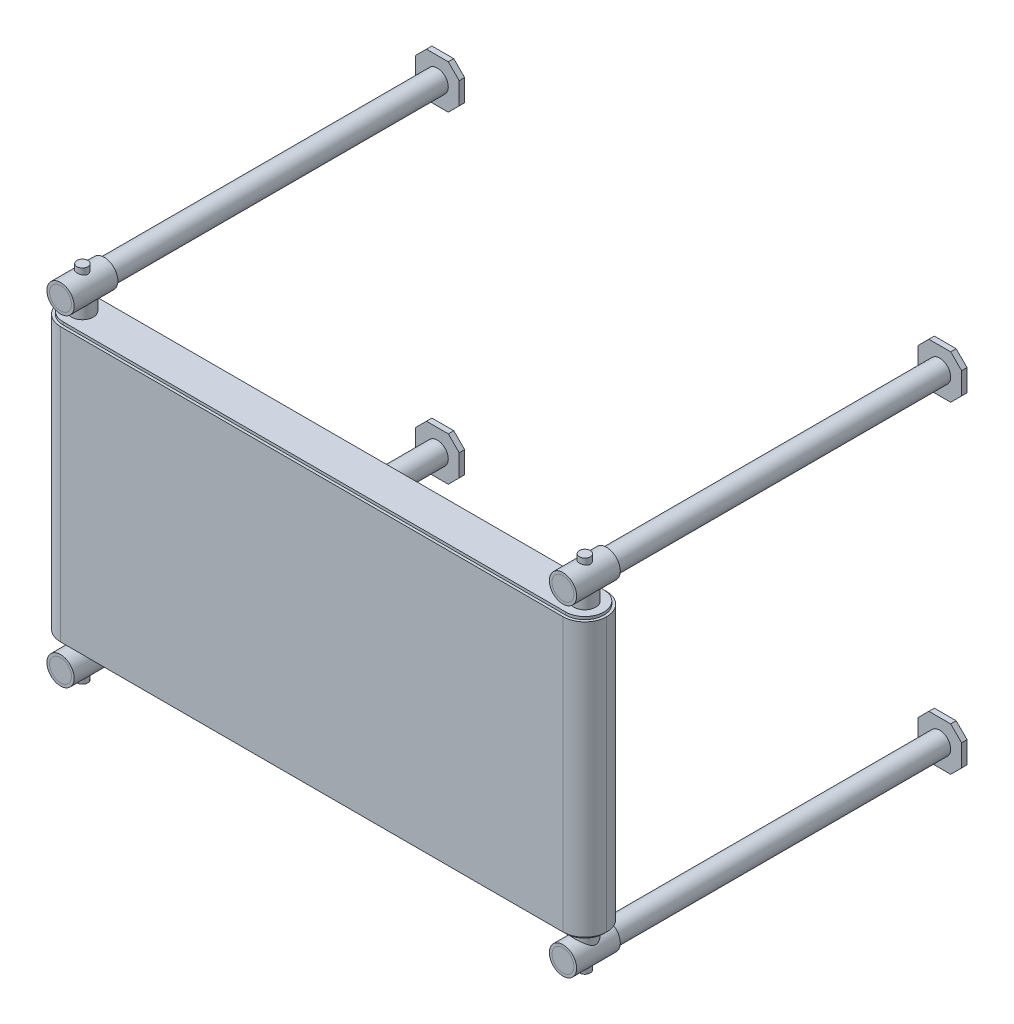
ISO-10303-21;
HEADER;
FILE_DESCRIPTION(('STEP AP214'),'2;1');
FILE_NAME('part.step','',(''),(''),'','','');
FILE_SCHEMA(('AUTOMOTIVE_DESIGN { 1 0 10303 214 1 1 1 1 }'));
ENDSEC;
DATA;
#1=APPLICATION_CONTEXT('core data for automotive mechanical design processes');
#2=APPLICATION_PROTOCOL_DEFINITION('international standard','automotive_design',2000,#1);
#3=PRODUCT_CONTEXT('',#1,'mechanical');
#4=PRODUCT('Part','Part','',(#3));
#5=PRODUCT_RELATED_PRODUCT_CATEGORY('part','',(#4));
#6=PRODUCT_DEFINITION_FORMATION('','',#4);
#7=PRODUCT_DEFINITION_CONTEXT('part definition',#1,'design');
#8=PRODUCT_DEFINITION('design','',#6,#7);
#9=PRODUCT_DEFINITION_SHAPE('','',#8);
#10=(LENGTH_UNIT() NAMED_UNIT(*) SI_UNIT(.MILLI.,.METRE.));
#11=(NAMED_UNIT(*) PLANE_ANGLE_UNIT() SI_UNIT($,.RADIAN.));
#12=(NAMED_UNIT(*) SI_UNIT($,.STERADIAN.) SOLID_ANGLE_UNIT());
#13=UNCERTAINTY_MEASURE_WITH_UNIT(LENGTH_MEASURE(1.E-05),#10,'distance_accuracy_value','');
#14=(GEOMETRIC_REPRESENTATION_CONTEXT(3) GLOBAL_UNCERTAINTY_ASSIGNED_CONTEXT((#13)) GLOBAL_UNIT_ASSIGNED_CONTEXT((#10,
#11,#12)) REPRESENTATION_CONTEXT('',''));
#15=CARTESIAN_POINT('',(0.,0.,0.));
#16=DIRECTION('',(0.,0.,1.));
#17=DIRECTION('',(1.,0.,0.));
#18=AXIS2_PLACEMENT_3D('',#15,#16,#17);
#19=CARTESIAN_POINT('',(40.,255.,625.));
#20=DIRECTION('',(0.,0.,-1.));
#21=DIRECTION('',(-1.,0.,0.));
#22=AXIS2_PLACEMENT_3D('',#19,#20,#21);
#23=PLANE('',#22);
#24=DIRECTION('',(1.,0.,0.));
#25=VECTOR('',#24,1.);
#26=CARTESIAN_POINT('',(40.,-255.,625.));
#27=LINE('',#26,#25);
#28=CARTESIAN_POINT('',(40.,-255.,625.));
#29=VERTEX_POINT('',#28);
#30=CARTESIAN_POINT('',(960.,-255.,625.));
#31=VERTEX_POINT('',#30);
#32=EDGE_CURVE('E105',#29,#31,#27,.T.);
#33=ORIENTED_EDGE('',*,*,#32,.F.);
#34=DIRECTION('',(0.,-1.,0.));
#35=VECTOR('',#34,1.);
#36=CARTESIAN_POINT('',(40.,255.,625.));
#37=LINE('',#36,#35);
#38=CARTESIAN_POINT('',(40.,255.,625.));
#39=VERTEX_POINT('',#38);
#40=EDGE_CURVE('E54',#39,#29,#37,.T.);
#41=ORIENTED_EDGE('',*,*,#40,.F.);
#42=DIRECTION('',(1.,0.,0.));
#43=VECTOR('',#42,1.);
#44=CARTESIAN_POINT('',(40.,255.,625.));
#45=LINE('',#44,#43);
#46=CARTESIAN_POINT('',(960.,255.,625.));
#47=VERTEX_POINT('',#46);
#48=EDGE_CURVE('E101',#39,#47,#45,.T.);
#49=ORIENTED_EDGE('',*,*,#48,.T.);
#50=DIRECTION('',(0.,-1.,0.));
#51=VECTOR('',#50,1.);
#52=CARTESIAN_POINT('',(960.,255.,625.));
#53=LINE('',#52,#51);
#54=EDGE_CURVE('E12',#47,#31,#53,.T.);
#55=ORIENTED_EDGE('',*,*,#54,.T.);
#56=EDGE_LOOP('',(#33,#41,#49,#55));
#57=FACE_BOUND('',#56,.T.);
#58=ADVANCED_FACE('F44',(#57),#23,.T.);
#59=CARTESIAN_POINT('',(40.,255.,660.));
#60=DIRECTION('',(0.,-1.,0.));
#61=DIRECTION('',(0.,0.,-1.));
#62=AXIS2_PLACEMENT_3D('',#59,#60,#61);
#63=CYLINDRICAL_SURFACE('',#62,35.);
#64=CARTESIAN_POINT('',(40.,-255.,660.));
#65=DIRECTION('',(0.,-1.,0.));
#66=DIRECTION('',(0.,0.,-1.));
#67=AXIS2_PLACEMENT_3D('',#64,#65,#66);
#68=CIRCLE('',#67,35.);
#69=CARTESIAN_POINT('',(40.,-255.,695.));
#70=VERTEX_POINT('',#69);
#71=EDGE_CURVE('E90',#70,#29,#68,.T.);
#72=ORIENTED_EDGE('',*,*,#71,.F.);
#73=DIRECTION('',(0.,-1.,0.));
#74=VECTOR('',#73,1.);
#75=CARTESIAN_POINT('',(40.,255.,695.));
#76=LINE('',#75,#74);
#77=CARTESIAN_POINT('',(40.,255.,695.));
#78=VERTEX_POINT('',#77);
#79=EDGE_CURVE('E86',#78,#70,#76,.T.);
#80=ORIENTED_EDGE('',*,*,#79,.F.);
#81=CARTESIAN_POINT('',(40.,255.,660.));
#82=DIRECTION('',(0.,-1.,0.));
#83=DIRECTION('',(0.,0.,-1.));
#84=AXIS2_PLACEMENT_3D('',#81,#82,#83);
#85=CIRCLE('',#84,35.);
#86=EDGE_CURVE('E89',#78,#39,#85,.T.);
#87=ORIENTED_EDGE('',*,*,#86,.T.);
#88=ORIENTED_EDGE('',*,*,#40,.T.);
#89=EDGE_LOOP('',(#72,#80,#87,#88));
#90=FACE_BOUND('',#89,.T.);
#91=ADVANCED_FACE('F88',(#90),#63,.T.);
#92=CARTESIAN_POINT('',(960.,255.,695.));
#93=DIRECTION('',(0.,0.,1.));
#94=DIRECTION('',(1.,0.,0.));
#95=AXIS2_PLACEMENT_3D('',#92,#93,#94);
#96=PLANE('',#95);
#97=DIRECTION('',(-1.,0.,0.));
#98=VECTOR('',#97,1.);
#99=CARTESIAN_POINT('',(960.,-255.,695.));
#100=LINE('',#99,#98);
#101=CARTESIAN_POINT('',(960.,-255.,695.));
#102=VERTEX_POINT('',#101);
#103=EDGE_CURVE('E110',#102,#70,#100,.T.);
#104=ORIENTED_EDGE('',*,*,#103,.F.);
#105=DIRECTION('',(0.,-1.,0.));
#106=VECTOR('',#105,1.);
#107=CARTESIAN_POINT('',(960.,255.,695.));
#108=LINE('',#107,#106);
#109=CARTESIAN_POINT('',(960.,255.,695.));
#110=VERTEX_POINT('',#109);
#111=EDGE_CURVE('E48',#110,#102,#108,.T.);
#112=ORIENTED_EDGE('',*,*,#111,.F.);
#113=DIRECTION('',(-1.,0.,0.));
#114=VECTOR('',#113,1.);
#115=CARTESIAN_POINT('',(960.,255.,695.));
#116=LINE('',#115,#114);
#117=EDGE_CURVE('E99',#110,#78,#116,.T.);
#118=ORIENTED_EDGE('',*,*,#117,.T.);
#119=ORIENTED_EDGE('',*,*,#79,.T.);
#120=EDGE_LOOP('',(#104,#112,#118,#119));
#121=FACE_BOUND('',#120,.T.);
#122=ADVANCED_FACE('F103',(#121),#96,.T.);
#123=CARTESIAN_POINT('',(960.,255.,660.));
#124=DIRECTION('',(0.,-1.,0.));
#125=DIRECTION('',(0.,0.,-1.));
#126=AXIS2_PLACEMENT_3D('',#123,#124,#125);
#127=CYLINDRICAL_SURFACE('',#126,35.);
#128=CARTESIAN_POINT('',(960.,-255.,660.));
#129=DIRECTION('',(0.,-1.,0.));
#130=DIRECTION('',(0.,0.,-1.));
#131=AXIS2_PLACEMENT_3D('',#128,#129,#130);
#132=CIRCLE('',#131,35.);
#133=EDGE_CURVE('E80',#31,#102,#132,.T.);
#134=ORIENTED_EDGE('',*,*,#133,.F.);
#135=ORIENTED_EDGE('',*,*,#54,.F.);
#136=CARTESIAN_POINT('',(960.,255.,660.));
#137=DIRECTION('',(0.,-1.,0.));
#138=DIRECTION('',(0.,0.,-1.));
#139=AXIS2_PLACEMENT_3D('',#136,#137,#138);
#140=CIRCLE('',#139,35.);
#141=EDGE_CURVE('E82',#47,#110,#140,.T.);
#142=ORIENTED_EDGE('',*,*,#141,.T.);
#143=ORIENTED_EDGE('',*,*,#111,.T.);
#144=EDGE_LOOP('',(#134,#135,#142,#143));
#145=FACE_BOUND('',#144,.T.);
#146=ADVANCED_FACE('F46',(#145),#127,.T.);
#147=CARTESIAN_POINT('',(960.,255.,660.));
#148=DIRECTION('',(0.,-1.,0.));
#149=DIRECTION('',(0.,0.,-1.));
#150=AXIS2_PLACEMENT_3D('',#147,#148,#149);
#151=PLANE('',#150);
#152=ORIENTED_EDGE('',*,*,#141,.F.);
#153=ORIENTED_EDGE('',*,*,#48,.F.);
#154=ORIENTED_EDGE('',*,*,#86,.F.);
#155=ORIENTED_EDGE('',*,*,#117,.F.);
#156=EDGE_LOOP('',(#152,#153,#154,#155));
#157=FACE_BOUND('',#156,.T.);
#158=ADVANCED_FACE('F98',(#157),#151,.F.);
#159=CARTESIAN_POINT('',(960.,-255.,660.));
#160=DIRECTION('',(0.,-1.,0.));
#161=DIRECTION('',(0.,0.,-1.));
#162=AXIS2_PLACEMENT_3D('',#159,#160,#161);
#163=PLANE('',#162);
#164=ORIENTED_EDGE('',*,*,#32,.T.);
#165=ORIENTED_EDGE('',*,*,#133,.T.);
#166=ORIENTED_EDGE('',*,*,#103,.T.);
#167=ORIENTED_EDGE('',*,*,#71,.T.);
#168=EDGE_LOOP('',(#164,#165,#166,#167));
#169=FACE_BOUND('',#168,.T.);
#170=ADVANCED_FACE('F117',(#169),#163,.T.);
#171=CLOSED_SHELL('',(#58,#91,#122,#146,#158,#170));
#172=MANIFOLD_SOLID_BREP('B2',#171);
#173=CARTESIAN_POINT('',(960.,295.,549.289321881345));
#174=DIRECTION('',(0.,0.,1.));
#175=DIRECTION('',(1.,0.,0.));
#176=AXIS2_PLACEMENT_3D('',#173,#174,#175);
#177=CYLINDRICAL_SURFACE('',#176,25.);
#178=CARTESIAN_POINT('',(960.,295.,700.));
#179=DIRECTION('',(0.,0.,-1.));
#180=DIRECTION('',(1.,0.,0.));
#181=AXIS2_PLACEMENT_3D('',#178,#179,#180);
#182=CIRCLE('',#181,25.);
#183=CARTESIAN_POINT('',(985.,295.,700.));
#184=VERTEX_POINT('',#183);
#185=EDGE_CURVE('E198',#184,#184,#182,.T.);
#186=ORIENTED_EDGE('',*,*,#185,.T.);
#187=EDGE_LOOP('',(#186));
#188=FACE_BOUND('',#187,.T.);
#189=CARTESIAN_POINT('',(960.,295.,620.));
#190=DIRECTION('',(0.,0.,-1.));
#191=DIRECTION('',(1.,0.,0.));
#192=AXIS2_PLACEMENT_3D('',#189,#190,#191);
#193=CIRCLE('',#192,25.);
#194=CARTESIAN_POINT('',(985.,295.,620.));
#195=VERTEX_POINT('',#194);
#196=EDGE_CURVE('E194',#195,#195,#193,.F.);
#197=ORIENTED_EDGE('',*,*,#196,.T.);
#198=EDGE_LOOP('',(#197));
#199=FACE_BOUND('',#198,.T.);
#200=CARTESIAN_POINT('',(980.,280.,660.));
#201=CARTESIAN_POINT('',(979.999996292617,279.999991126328,659.624438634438));
#202=CARTESIAN_POINT('',(979.989393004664,279.985824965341,659.248740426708));
#203=CARTESIAN_POINT('',(979.94722956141,279.929857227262,658.500442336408));
#204=CARTESIAN_POINT('',(979.915655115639,279.888036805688,658.127844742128));
#205=CARTESIAN_POINT('',(979.832178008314,279.778652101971,657.387764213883));
#206=CARTESIAN_POINT('',(979.780220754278,279.711018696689,657.020297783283));
#207=CARTESIAN_POINT('',(979.657007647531,279.552927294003,656.293521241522));
#208=CARTESIAN_POINT('',(979.585744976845,279.462461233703,655.934214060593));
#209=CARTESIAN_POINT('',(979.451261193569,279.294716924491,655.340757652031));
#210=CARTESIAN_POINT('',(979.392977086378,279.222735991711,655.103950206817));
#211=CARTESIAN_POINT('',(979.26852458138,279.070982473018,654.635041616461));
#212=CARTESIAN_POINT('',(979.202358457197,278.991212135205,654.402939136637));
#213=CARTESIAN_POINT('',(978.992420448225,278.741612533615,653.713600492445));
#214=CARTESIAN_POINT('',(978.837243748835,278.561538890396,653.263485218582));
#215=CARTESIAN_POINT('',(978.498334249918,278.181061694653,652.381912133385));
#216=CARTESIAN_POINT('',(978.314537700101,277.980613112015,651.950498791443));
#217=CARTESIAN_POINT('',(977.920186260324,277.565870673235,651.10710528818));
#218=CARTESIAN_POINT('',(977.709632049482,277.351577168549,650.695124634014));
#219=CARTESIAN_POINT('',(977.181965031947,276.835169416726,649.744602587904));
#220=CARTESIAN_POINT('',(976.853852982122,276.529321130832,649.214170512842));
#221=CARTESIAN_POINT('',(976.151380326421,275.911997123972,648.188162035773));
#222=CARTESIAN_POINT('',(975.777003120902,275.600519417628,647.692598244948));
#223=CARTESIAN_POINT('',(974.983085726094,274.980995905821,646.73755751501));
#224=CARTESIAN_POINT('',(974.563582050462,274.672947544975,646.278051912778));
#225=CARTESIAN_POINT('',(973.679652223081,274.067875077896,645.396699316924));
#226=CARTESIAN_POINT('',(973.215241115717,273.770847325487,644.974839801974));
#227=CARTESIAN_POINT('',(972.338123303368,273.251972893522,644.251127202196));
#228=CARTESIAN_POINT('',(971.93331268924,273.026861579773,643.942025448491));
#229=CARTESIAN_POINT('',(971.095585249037,272.592175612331,643.352166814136));
#230=CARTESIAN_POINT('',(970.662669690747,272.38260025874,643.071408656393));
#231=CARTESIAN_POINT('',(969.770280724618,271.983042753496,642.541173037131));
#232=CARTESIAN_POINT('',(969.310841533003,271.793036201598,642.291656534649));
#233=CARTESIAN_POINT('',(968.366533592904,271.436135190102,641.826448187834));
#234=CARTESIAN_POINT('',(967.88166908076,271.269236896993,641.610750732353));
#235=CARTESIAN_POINT('',(966.969243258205,270.987099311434,641.248195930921));
#236=CARTESIAN_POINT('',(966.54509212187,270.867870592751,641.095846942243));
#237=CARTESIAN_POINT('',(965.682578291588,270.650338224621,640.818931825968));
#238=CARTESIAN_POINT('',(965.244217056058,270.552032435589,640.694362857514));
#239=CARTESIAN_POINT('',(964.355882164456,270.378240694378,640.474746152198));
#240=CARTESIAN_POINT('',(963.905913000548,270.302746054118,640.379687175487));
#241=CARTESIAN_POINT('',(962.997134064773,270.176067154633,640.220465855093));
#242=CARTESIAN_POINT('',(962.538324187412,270.124883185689,640.156303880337));
#243=CARTESIAN_POINT('',(961.613607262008,270.0478003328,640.059761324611));
#244=CARTESIAN_POINT('',(961.147680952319,270.021990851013,640.027493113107));
#245=CARTESIAN_POINT('',(960.213992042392,269.996554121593,639.995690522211));
#246=CARTESIAN_POINT('',(959.746229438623,269.996926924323,639.996156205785));
#247=CARTESIAN_POINT('',(958.81263200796,270.02384619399,640.029813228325));
#248=CARTESIAN_POINT('',(958.346797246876,270.050393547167,640.06300567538));
#249=CARTESIAN_POINT('',(957.420747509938,270.129065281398,640.161545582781));
#250=CARTESIAN_POINT('',(956.960532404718,270.181189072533,640.226892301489));
#251=CARTESIAN_POINT('',(956.074028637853,270.306355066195,640.384234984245));
#252=CARTESIAN_POINT('',(955.64726033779,270.378098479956,640.474579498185));
#253=CARTESIAN_POINT('',(954.804283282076,270.542099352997,640.681798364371));
#254=CARTESIAN_POINT('',(954.388074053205,270.634355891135,640.798671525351));
#255=CARTESIAN_POINT('',(953.568258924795,270.837816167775,641.057520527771));
#256=CARTESIAN_POINT('',(953.164654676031,270.949022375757,641.199499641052));
#257=CARTESIAN_POINT('',(952.371785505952,271.188618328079,641.506996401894));
#258=CARTESIAN_POINT('',(951.982521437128,271.317009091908,641.672515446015));
#259=CARTESIAN_POINT('',(951.182918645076,271.602218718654,642.04251205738));
#260=CARTESIAN_POINT('',(950.774158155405,271.760584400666,642.249206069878));
#261=CARTESIAN_POINT('',(949.976703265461,272.093227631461,642.686985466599));
#262=CARTESIAN_POINT('',(949.588009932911,272.267506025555,642.918072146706));
#263=CARTESIAN_POINT('',(948.831398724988,272.629522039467,643.402882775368));
#264=CARTESIAN_POINT('',(948.463488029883,272.81726426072,643.656614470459));
#265=CARTESIAN_POINT('',(947.749074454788,273.203674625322,644.185061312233));
#266=CARTESIAN_POINT('',(947.402574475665,273.402344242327,644.459779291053));
#267=CARTESIAN_POINT('',(946.662141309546,273.849936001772,645.087482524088));
#268=CARTESIAN_POINT('',(946.273145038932,274.100778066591,645.444931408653));
#269=CARTESIAN_POINT('',(945.527062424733,274.610340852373,646.186570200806));
#270=CARTESIAN_POINT('',(945.169981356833,274.869062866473,646.570764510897));
#271=CARTESIAN_POINT('',(944.487608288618,275.390049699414,647.365119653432));
#272=CARTESIAN_POINT('',(944.162353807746,275.652318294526,647.775310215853));
#273=CARTESIAN_POINT('',(943.544490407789,276.17502015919,648.620620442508));
#274=CARTESIAN_POINT('',(943.251877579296,276.43545364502,649.055737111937));
#275=CARTESIAN_POINT('',(942.726538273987,276.923952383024,649.90776170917));
#276=CARTESIAN_POINT('',(942.490758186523,277.152718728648,650.322385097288));
#277=CARTESIAN_POINT('',(942.047214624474,277.598953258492,651.172355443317));
#278=CARTESIAN_POINT('',(941.839454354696,277.816420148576,651.607704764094));
#279=CARTESIAN_POINT('',(941.453697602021,278.233509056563,652.498670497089));
#280=CARTESIAN_POINT('',(941.275650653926,278.433161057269,652.954250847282));
#281=CARTESIAN_POINT('',(940.95094379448,278.807567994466,653.886348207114));
#282=CARTESIAN_POINT('',(940.804269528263,278.98233430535,654.362855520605));
#283=CARTESIAN_POINT('',(940.584173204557,279.250522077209,655.188659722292));
#284=CARTESIAN_POINT('',(940.502013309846,279.352559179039,655.532841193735));
#285=CARTESIAN_POINT('',(940.355302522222,279.537148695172,656.230030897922));
#286=CARTESIAN_POINT('',(940.290745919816,279.619707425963,656.583036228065));
#287=CARTESIAN_POINT('',(940.180380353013,279.762191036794,657.29584112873));
#288=CARTESIAN_POINT('',(940.134537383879,279.822156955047,657.655627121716));
#289=CARTESIAN_POINT('',(940.062354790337,279.917099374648,658.380459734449));
#290=CARTESIAN_POINT('',(940.036014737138,279.952076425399,658.745506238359));
#291=CARTESIAN_POINT('',(940.003353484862,279.995504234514,659.480258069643));
#292=CARTESIAN_POINT('',(939.99715124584,280.003797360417,659.849978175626));
#293=CARTESIAN_POINT('',(940.005255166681,279.992994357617,660.588778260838));
#294=CARTESIAN_POINT('',(940.019560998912,279.973898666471,660.9578582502));
#295=CARTESIAN_POINT('',(940.068357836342,279.909232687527,661.692760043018));
#296=CARTESIAN_POINT('',(940.102873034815,279.863630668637,662.058577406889));
#297=CARTESIAN_POINT('',(940.191333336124,279.748049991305,662.783937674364));
#298=CARTESIAN_POINT('',(940.245281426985,279.678067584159,663.143479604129));
#299=CARTESIAN_POINT('',(940.387658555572,279.496046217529,663.944749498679));
#300=CARTESIAN_POINT('',(940.481366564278,279.377838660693,664.384137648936));
#301=CARTESIAN_POINT('',(940.69562127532,279.113849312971,665.247774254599));
#302=CARTESIAN_POINT('',(940.816176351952,278.96805892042,665.672017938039));
#303=CARTESIAN_POINT('',(941.082504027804,278.654642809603,666.50539740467));
#304=CARTESIAN_POINT('',(941.228337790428,278.486964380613,666.914493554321));
#305=CARTESIAN_POINT('',(941.543450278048,278.135494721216,667.71630397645));
#306=CARTESIAN_POINT('',(941.712730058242,277.95170276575,668.109017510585));
#307=CARTESIAN_POINT('',(942.156227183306,277.485862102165,669.054481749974));
#308=CARTESIAN_POINT('',(942.443005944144,277.197352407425,669.598187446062));
#309=CARTESIAN_POINT('',(943.061707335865,276.607686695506,670.652125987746));
#310=CARTESIAN_POINT('',(943.393648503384,276.306525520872,671.162344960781));
#311=CARTESIAN_POINT('',(944.101808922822,275.700649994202,672.14977017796));
#312=CARTESIAN_POINT('',(944.478071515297,275.395932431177,672.626943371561));
#313=CARTESIAN_POINT('',(945.273980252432,274.791235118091,673.546738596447));
#314=CARTESIAN_POINT('',(945.693619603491,274.491254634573,673.989366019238));
#315=CARTESIAN_POINT('',(946.582340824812,273.898918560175,674.84425504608));
#316=CARTESIAN_POINT('',(947.052045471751,273.606734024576,675.255990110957));
#317=CARTESIAN_POINT('',(948.03527209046,273.041700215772,676.038709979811));
#318=CARTESIAN_POINT('',(948.548800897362,272.768853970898,676.409688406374));
#319=CARTESIAN_POINT('',(949.617064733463,272.250365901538,677.105540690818));
#320=CARTESIAN_POINT('',(950.171682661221,272.004651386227,677.430538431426));
#321=CARTESIAN_POINT('',(951.033022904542,271.661427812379,677.880107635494));
#322=CARTESIAN_POINT('',(951.324990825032,271.551259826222,678.02362341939));
#323=CARTESIAN_POINT('',(951.918446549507,271.340167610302,678.297411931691));
#324=CARTESIAN_POINT('',(952.219936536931,271.239245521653,678.427681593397));
#325=CARTESIAN_POINT('',(952.940229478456,271.013584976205,678.717882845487));
#326=CARTESIAN_POINT('',(953.362746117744,270.893079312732,678.871968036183));
#327=CARTESIAN_POINT('',(954.222008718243,270.672824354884,679.152519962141));
#328=CARTESIAN_POINT('',(954.658750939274,270.573069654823,679.278993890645));
#329=CARTESIAN_POINT('',(955.543954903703,270.396194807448,679.502612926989));
#330=CARTESIAN_POINT('',(955.992410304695,270.319062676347,679.599773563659));
#331=CARTESIAN_POINT('',(956.898378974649,270.188926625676,679.763396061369));
#332=CARTESIAN_POINT('',(957.355892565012,270.135923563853,679.829856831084));
#333=CARTESIAN_POINT('',(958.278349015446,270.055039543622,679.931181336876));
#334=CARTESIAN_POINT('',(958.743313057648,270.02725199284,679.965927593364));
#335=CARTESIAN_POINT('',(959.675363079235,269.997760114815,680.002802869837));
#336=CARTESIAN_POINT('',(960.142449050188,269.996055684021,680.004932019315));
#337=CARTESIAN_POINT('',(961.075012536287,270.018768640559,679.976536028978));
#338=CARTESIAN_POINT('',(961.540489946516,270.043187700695,679.946008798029));
#339=CARTESIAN_POINT('',(962.466130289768,270.117600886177,679.852822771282));
#340=CARTESIAN_POINT('',(962.926293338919,270.167594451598,679.790164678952));
#341=CARTESIAN_POINT('',(963.813438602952,270.288721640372,679.63795501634));
#342=CARTESIAN_POINT('',(964.240876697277,270.358577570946,679.550026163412));
#343=CARTESIAN_POINT('',(965.085405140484,270.518917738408,679.347537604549));
#344=CARTESIAN_POINT('',(965.502495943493,270.60940106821,679.232979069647));
#345=CARTESIAN_POINT('',(966.324254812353,270.8094506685,678.978641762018));
#346=CARTESIAN_POINT('',(966.728921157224,270.919019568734,678.838859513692));
#347=CARTESIAN_POINT('',(967.524057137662,271.155490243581,678.535631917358));
#348=CARTESIAN_POINT('',(967.914525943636,271.282393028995,678.372185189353));
#349=CARTESIAN_POINT('',(968.715515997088,271.564207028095,678.006974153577));
#350=CARTESIAN_POINT('',(969.124525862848,271.720625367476,677.803060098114));
#351=CARTESIAN_POINT('',(969.922698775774,272.049479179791,677.370839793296));
#352=CARTESIAN_POINT('',(970.311860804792,272.221915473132,677.142532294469));
#353=CARTESIAN_POINT('',(971.069595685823,272.580370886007,676.663285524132));
#354=CARTESIAN_POINT('',(971.438162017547,272.766394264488,676.412339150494));
#355=CARTESIAN_POINT('',(972.154067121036,273.149518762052,675.889467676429));
#356=CARTESIAN_POINT('',(972.501403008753,273.346621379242,675.617539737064));
#357=CARTESIAN_POINT('',(973.243391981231,273.790668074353,674.996404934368));
#358=CARTESIAN_POINT('',(973.633182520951,274.039557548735,674.642771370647));
#359=CARTESIAN_POINT('',(974.381158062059,274.545508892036,673.908878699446));
#360=CARTESIAN_POINT('',(974.73933796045,274.80257207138,673.528615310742));
#361=CARTESIAN_POINT('',(975.424226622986,275.320625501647,672.742269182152));
#362=CARTESIAN_POINT('',(975.750897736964,275.581620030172,672.336156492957));
#363=CARTESIAN_POINT('',(976.371928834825,276.102273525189,671.499195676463));
#364=CARTESIAN_POINT('',(976.666292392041,276.361932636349,671.068350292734));
#365=CARTESIAN_POINT('',(977.199653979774,276.853578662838,670.217782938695));
#366=CARTESIAN_POINT('',(977.441203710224,277.086106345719,669.799974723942));
#367=CARTESIAN_POINT('',(977.89567233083,277.540101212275,668.943162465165));
#368=CARTESIAN_POINT('',(978.108587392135,277.761566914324,668.504155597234));
#369=CARTESIAN_POINT('',(978.504129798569,278.186870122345,667.605125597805));
#370=CARTESIAN_POINT('',(978.686798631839,278.390731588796,667.145132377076));
#371=CARTESIAN_POINT('',(978.936707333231,278.67770650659,666.439205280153));
#372=CARTESIAN_POINT('',(979.01598214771,278.770213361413,666.201285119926));
#373=CARTESIAN_POINT('',(979.166231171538,278.947925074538,665.720064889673));
#374=CARTESIAN_POINT('',(979.237203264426,279.033128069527,665.476763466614));
#375=CARTESIAN_POINT('',(979.397638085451,279.228080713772,664.884694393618));
#376=CARTESIAN_POINT('',(979.482841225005,279.333674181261,664.533372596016));
#377=CARTESIAN_POINT('',(979.634887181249,279.524660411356,663.821465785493));
#378=CARTESIAN_POINT('',(979.701736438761,279.610060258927,663.4608840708));
#379=CARTESIAN_POINT('',(979.815802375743,279.757210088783,662.732994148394));
#380=CARTESIAN_POINT('',(979.863078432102,279.81903155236,662.365709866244));
#381=CARTESIAN_POINT('',(979.93727160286,279.916597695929,661.625798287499));
#382=CARTESIAN_POINT('',(979.964202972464,279.952360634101,661.25317491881));
#383=CARTESIAN_POINT('',(979.987097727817,279.982809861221,660.733091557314));
#384=CARTESIAN_POINT('',(979.991933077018,279.989249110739,660.586606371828));
#385=CARTESIAN_POINT('',(979.998385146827,279.997846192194,660.293421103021));
#386=CARTESIAN_POINT('',(980.000001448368,280.000003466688,660.146720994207));
#387=CARTESIAN_POINT('',(980.,280.,660.));
#388=B_SPLINE_CURVE_WITH_KNOTS('',3,(#200,#201,#202,#203,#204,#205,#206,#207,#208,#209,#210,
#211,#212,#213,#214,#215,#216,#217,#218,#219,#220,#221,#222,#223,#224,#225,#226,#227,#228,#229,
#230,#231,#232,#233,#234,#235,#236,#237,#238,#239,#240,#241,#242,#243,#244,#245,#246,#247,#248,
#249,#250,#251,#252,#253,#254,#255,#256,#257,#258,#259,#260,#261,#262,#263,#264,#265,#266,#267,
#268,#269,#270,#271,#272,#273,#274,#275,#276,#277,#278,#279,#280,#281,#282,#283,#284,#285,#286,
#287,#288,#289,#290,#291,#292,#293,#294,#295,#296,#297,#298,#299,#300,#301,#302,#303,#304,#305,
#306,#307,#308,#309,#310,#311,#312,#313,#314,#315,#316,#317,#318,#319,#320,#321,#322,#323,#324,
#325,#326,#327,#328,#329,#330,#331,#332,#333,#334,#335,#336,#337,#338,#339,#340,#341,#342,#343,
#344,#345,#346,#347,#348,#349,#350,#351,#352,#353,#354,#355,#356,#357,#358,#359,#360,#361,#362,
#363,#364,#365,#366,#367,#368,#369,#370,#371,#372,#373,#374,#375,#376,#377,#378,#379,#380,#381,
#382,#383,#384,#385,#386,#387),.UNSPECIFIED.,.T.,.F.,(4,2,2,2,2,2,2,2,2,2,2,2,2,2,2,2,2,2,2,2,2,
2,2,2,2,2,2,2,2,2,2,2,2,2,2,2,2,2,2,2,2,2,2,2,2,2,2,2,2,2,2,2,2,2,2,2,2,2,2,2,2,2,2,2,2,2,2,2,2,
2,2,2,2,2,2,2,2,2,2,2,2,2,2,2,2,2,2,2,2,2,2,2,2,4),(0.,1.12651574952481,2.2537999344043,
3.38412423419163,4.51484824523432,5.27739675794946,6.03972583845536,7.56486868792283,
9.09345869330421,10.6220099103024,12.7033327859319,14.7854046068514,16.8658042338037,
18.9455093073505,20.6145867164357,22.2835888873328,23.9504841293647,25.6171025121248,
27.0142554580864,28.411265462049,29.807742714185,31.2042366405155,32.6056333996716,
34.0070328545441,35.4084797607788,36.8098943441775,38.1347256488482,39.4594974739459,
40.7844420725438,42.109465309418,43.5620343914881,45.0146806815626,46.4678258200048,
47.9211674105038,49.6739596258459,51.4270410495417,53.1821648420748,54.9370782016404,
56.5229157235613,58.1089344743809,59.6922314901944,61.2748024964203,62.3787128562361,
63.4822647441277,64.5838023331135,65.6853157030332,66.7933243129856,67.9013152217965,
69.0106352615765,70.1201259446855,71.5116354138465,72.9035795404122,74.2989398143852,
75.6943629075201,77.7286442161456,79.7637630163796,81.8008886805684,83.8376957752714,
85.9037141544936,87.9700553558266,90.0307187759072,91.0607299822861,92.0909791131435,
93.4862959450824,94.8812488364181,96.2754614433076,97.6697236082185,99.0691298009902,
100.468530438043,101.868020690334,103.267480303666,104.591878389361,105.916218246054,
107.240740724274,108.565340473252,110.013105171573,111.460944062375,112.909238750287,
114.357729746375,116.102639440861,117.847830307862,119.595081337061,121.342138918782,
122.948043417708,124.554162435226,126.158059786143,126.959714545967,127.761573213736,
128.890375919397,130.018781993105,131.143739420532,132.267907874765,132.707947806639,
133.148045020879),.UNSPECIFIED.);
#389=CARTESIAN_POINT('',(980.,280.,660.));
#390=VERTEX_POINT('',#389);
#391=EDGE_CURVE('E190',#390,#390,#388,.T.);
#392=ORIENTED_EDGE('',*,*,#391,.T.);
#393=EDGE_LOOP('',(#392));
#394=FACE_BOUND('',#393,.T.);
#395=ADVANCED_FACE('F182',(#188,#199,#394),#177,.T.);
#396=CARTESIAN_POINT('',(960.,295.,700.));
#397=DIRECTION('',(0.,0.,1.));
#398=DIRECTION('',(1.,0.,0.));
#399=AXIS2_PLACEMENT_3D('',#396,#397,#398);
#400=PLANE('',#399);
#401=CARTESIAN_POINT('',(960.,295.,700.));
#402=DIRECTION('',(0.,0.,-1.));
#403=DIRECTION('',(1.,0.,0.));
#404=AXIS2_PLACEMENT_3D('',#401,#402,#403);
#405=CIRCLE('',#404,20.);
#406=CARTESIAN_POINT('',(980.,295.,700.));
#407=VERTEX_POINT('',#406);
#408=EDGE_CURVE('E236',#407,#407,#405,.T.);
#409=ORIENTED_EDGE('',*,*,#408,.T.);
#410=EDGE_LOOP('',(#409));
#411=FACE_BOUND('',#410,.T.);
#412=ORIENTED_EDGE('',*,*,#185,.F.);
#413=EDGE_LOOP('',(#412));
#414=FACE_BOUND('',#413,.T.);
#415=ADVANCED_FACE('F207',(#411,#414),#400,.T.);
#416=CARTESIAN_POINT('',(920.,250.,620.));
#417=DIRECTION('',(0.,0.,1.));
#418=DIRECTION('',(1.,0.,0.));
#419=AXIS2_PLACEMENT_3D('',#416,#417,#418);
#420=PLANE('',#419);
#421=CARTESIAN_POINT('',(960.,295.,620.));
#422=DIRECTION('',(0.,0.,-1.));
#423=DIRECTION('',(1.,0.,0.));
#424=AXIS2_PLACEMENT_3D('',#421,#422,#423);
#425=CIRCLE('',#424,20.);
#426=CARTESIAN_POINT('',(980.,295.,620.));
#427=VERTEX_POINT('',#426);
#428=EDGE_CURVE('E233',#427,#427,#425,.T.);
#429=ORIENTED_EDGE('',*,*,#428,.F.);
#430=EDGE_LOOP('',(#429));
#431=FACE_BOUND('',#430,.T.);
#432=ORIENTED_EDGE('',*,*,#196,.F.);
#433=EDGE_LOOP('',(#432));
#434=FACE_BOUND('',#433,.T.);
#435=ADVANCED_FACE('F219',(#431,#434),#420,.F.);
#436=CARTESIAN_POINT('',(960.,280.,660.));
#437=DIRECTION('',(0.,-1.,0.));
#438=DIRECTION('',(0.,0.,1.));
#439=AXIS2_PLACEMENT_3D('',#436,#437,#438);
#440=CYLINDRICAL_SURFACE('',#439,20.);
#441=ORIENTED_EDGE('',*,*,#391,.F.);
#442=EDGE_LOOP('',(#441));
#443=FACE_BOUND('',#442,.T.);
#444=CARTESIAN_POINT('',(960.,250.,660.));
#445=DIRECTION('',(0.,-1.,0.));
#446=DIRECTION('',(0.,0.,-1.));
#447=AXIS2_PLACEMENT_3D('',#444,#445,#446);
#448=CIRCLE('',#447,20.);
#449=CARTESIAN_POINT('',(960.,250.,640.));
#450=VERTEX_POINT('',#449);
#451=EDGE_CURVE('E43',#450,#450,#448,.T.);
#452=ORIENTED_EDGE('',*,*,#451,.F.);
#453=EDGE_LOOP('',(#452));
#454=FACE_BOUND('',#453,.T.);
#455=ADVANCED_FACE('F184',(#443,#454),#440,.T.);
#456=CARTESIAN_POINT('',(960.,250.,660.));
#457=DIRECTION('',(0.,1.,0.));
#458=DIRECTION('',(0.,0.,-1.));
#459=AXIS2_PLACEMENT_3D('',#456,#457,#458);
#460=PLANE('',#459);
#461=ORIENTED_EDGE('',*,*,#451,.T.);
#462=EDGE_LOOP('',(#461));
#463=FACE_BOUND('',#462,.T.);
#464=ADVANCED_FACE('F210',(#463),#460,.F.);
#465=CARTESIAN_POINT('',(960.,295.,620.));
#466=DIRECTION('',(0.,0.,1.));
#467=DIRECTION('',(1.,0.,0.));
#468=AXIS2_PLACEMENT_3D('',#465,#466,#467);
#469=CYLINDRICAL_SURFACE('',#468,20.);
#470=ORIENTED_EDGE('',*,*,#428,.T.);
#471=EDGE_LOOP('',(#470));
#472=FACE_BOUND('',#471,.T.);
#473=ORIENTED_EDGE('',*,*,#408,.F.);
#474=EDGE_LOOP('',(#473));
#475=FACE_BOUND('',#474,.T.);
#476=ADVANCED_FACE('F212',(#472,#475),#469,.F.);
#477=CLOSED_SHELL('',(#395,#415,#435,#455,#464,#476));
#478=MANIFOLD_SOLID_BREP('B6',#477);
#479=CARTESIAN_POINT('',(960.,330.,660.));
#480=DIRECTION('',(0.,-1.,0.));
#481=DIRECTION('',(0.,0.,1.));
#482=AXIS2_PLACEMENT_3D('',#479,#480,#481);
#483=CYLINDRICAL_SURFACE('',#482,10.);
#484=CARTESIAN_POINT('',(960.,330.,660.));
#485=DIRECTION('',(0.,-1.,0.));
#486=DIRECTION('',(0.,0.,-1.));
#487=AXIS2_PLACEMENT_3D('',#484,#485,#486);
#488=CIRCLE('',#487,10.);
#489=CARTESIAN_POINT('',(960.,330.,650.));
#490=VERTEX_POINT('',#489);
#491=EDGE_CURVE('E181',#490,#490,#488,.T.);
#492=ORIENTED_EDGE('',*,*,#491,.T.);
#493=EDGE_LOOP('',(#492));
#494=FACE_BOUND('',#493,.T.);
#495=CARTESIAN_POINT('',(960.,310.,660.));
#496=DIRECTION('',(0.,-1.,0.));
#497=DIRECTION('',(0.,0.,-1.));
#498=AXIS2_PLACEMENT_3D('',#495,#496,#497);
#499=CIRCLE('',#498,10.);
#500=CARTESIAN_POINT('',(960.,310.,650.));
#501=VERTEX_POINT('',#500);
#502=EDGE_CURVE('E289',#501,#501,#499,.T.);
#503=ORIENTED_EDGE('',*,*,#502,.F.);
#504=EDGE_LOOP('',(#503));
#505=FACE_BOUND('',#504,.T.);
#506=ADVANCED_FACE('F286',(#494,#505),#483,.T.);
#507=CARTESIAN_POINT('',(960.,330.,660.));
#508=DIRECTION('',(0.,1.,0.));
#509=DIRECTION('',(0.,0.,-1.));
#510=AXIS2_PLACEMENT_3D('',#507,#508,#509);
#511=PLANE('',#510);
#512=ORIENTED_EDGE('',*,*,#491,.F.);
#513=EDGE_LOOP('',(#512));
#514=FACE_BOUND('',#513,.T.);
#515=ADVANCED_FACE('F301',(#514),#511,.T.);
#516=CARTESIAN_POINT('',(960.,310.,660.));
#517=DIRECTION('',(0.,1.,0.));
#518=DIRECTION('',(0.,0.,-1.));
#519=AXIS2_PLACEMENT_3D('',#516,#517,#518);
#520=PLANE('',#519);
#521=ORIENTED_EDGE('',*,*,#502,.T.);
#522=EDGE_LOOP('',(#521));
#523=FACE_BOUND('',#522,.T.);
#524=ADVANCED_FACE('F298',(#523),#520,.F.);
#525=CLOSED_SHELL('',(#506,#515,#524));
#526=MANIFOLD_SOLID_BREP('B38',#525);
#527=CARTESIAN_POINT('',(960.,-330.,660.));
#528=DIRECTION('',(0.,1.,0.));
#529=DIRECTION('',(0.,0.,1.));
#530=AXIS2_PLACEMENT_3D('',#527,#528,#529);
#531=CYLINDRICAL_SURFACE('',#530,10.);
#532=CARTESIAN_POINT('',(960.,-330.,660.));
#533=DIRECTION('',(0.,-1.,0.));
#534=DIRECTION('',(0.,0.,-1.));
#535=AXIS2_PLACEMENT_3D('',#532,#533,#534);
#536=CIRCLE('',#535,10.);
#537=CARTESIAN_POINT('',(960.,-330.,650.));
#538=VERTEX_POINT('',#537);
#539=EDGE_CURVE('E285',#538,#538,#536,.T.);
#540=ORIENTED_EDGE('',*,*,#539,.F.);
#541=EDGE_LOOP('',(#540));
#542=FACE_BOUND('',#541,.T.);
#543=CARTESIAN_POINT('',(960.,-310.,660.));
#544=DIRECTION('',(0.,-1.,0.));
#545=DIRECTION('',(0.,0.,-1.));
#546=AXIS2_PLACEMENT_3D('',#543,#544,#545);
#547=CIRCLE('',#546,10.);
#548=CARTESIAN_POINT('',(960.,-310.,650.));
#549=VERTEX_POINT('',#548);
#550=EDGE_CURVE('E338',#549,#549,#547,.T.);
#551=ORIENTED_EDGE('',*,*,#550,.T.);
#552=EDGE_LOOP('',(#551));
#553=FACE_BOUND('',#552,.T.);
#554=ADVANCED_FACE('F335',(#542,#553),#531,.T.);
#555=CARTESIAN_POINT('',(960.,-330.,660.));
#556=DIRECTION('',(0.,-1.,0.));
#557=DIRECTION('',(0.,0.,-1.));
#558=AXIS2_PLACEMENT_3D('',#555,#556,#557);
#559=PLANE('',#558);
#560=ORIENTED_EDGE('',*,*,#539,.T.);
#561=EDGE_LOOP('',(#560));
#562=FACE_BOUND('',#561,.T.);
#563=ADVANCED_FACE('F350',(#562),#559,.T.);
#564=CARTESIAN_POINT('',(960.,-310.,660.));
#565=DIRECTION('',(0.,-1.,0.));
#566=DIRECTION('',(0.,0.,-1.));
#567=AXIS2_PLACEMENT_3D('',#564,#565,#566);
#568=PLANE('',#567);
#569=ORIENTED_EDGE('',*,*,#550,.F.);
#570=EDGE_LOOP('',(#569));
#571=FACE_BOUND('',#570,.T.);
#572=ADVANCED_FACE('F348',(#571),#568,.F.);
#573=CLOSED_SHELL('',(#554,#563,#572));
#574=MANIFOLD_SOLID_BREP('B176',#573);
#575=CARTESIAN_POINT('',(960.,-295.,549.289321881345));
#576=DIRECTION('',(0.,0.,1.));
#577=DIRECTION('',(1.,0.,0.));
#578=AXIS2_PLACEMENT_3D('',#575,#576,#577);
#579=CYLINDRICAL_SURFACE('',#578,25.);
#580=CARTESIAN_POINT('',(960.,-295.,700.));
#581=DIRECTION('',(0.,0.,1.));
#582=DIRECTION('',(1.,0.,0.));
#583=AXIS2_PLACEMENT_3D('',#580,#581,#582);
#584=CIRCLE('',#583,25.);
#585=CARTESIAN_POINT('',(985.,-295.,700.));
#586=VERTEX_POINT('',#585);
#587=EDGE_CURVE('E400',#586,#586,#584,.T.);
#588=ORIENTED_EDGE('',*,*,#587,.F.);
#589=EDGE_LOOP('',(#588));
#590=FACE_BOUND('',#589,.T.);
#591=CARTESIAN_POINT('',(960.,-295.,620.));
#592=DIRECTION('',(0.,0.,1.));
#593=DIRECTION('',(1.,0.,0.));
#594=AXIS2_PLACEMENT_3D('',#591,#592,#593);
#595=CIRCLE('',#594,25.);
#596=CARTESIAN_POINT('',(985.,-295.,620.));
#597=VERTEX_POINT('',#596);
#598=EDGE_CURVE('E396',#597,#597,#595,.F.);
#599=ORIENTED_EDGE('',*,*,#598,.F.);
#600=EDGE_LOOP('',(#599));
#601=FACE_BOUND('',#600,.T.);
#602=CARTESIAN_POINT('',(980.,-280.,660.));
#603=CARTESIAN_POINT('',(979.999996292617,-279.999991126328,659.624438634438));
#604=CARTESIAN_POINT('',(979.989393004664,-279.985824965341,659.248740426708));
#605=CARTESIAN_POINT('',(979.94722956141,-279.929857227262,658.500442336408));
#606=CARTESIAN_POINT('',(979.915655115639,-279.888036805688,658.127844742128));
#607=CARTESIAN_POINT('',(979.832178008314,-279.778652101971,657.387764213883));
#608=CARTESIAN_POINT('',(979.780220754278,-279.711018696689,657.020297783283));
#609=CARTESIAN_POINT('',(979.657007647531,-279.552927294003,656.293521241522));
#610=CARTESIAN_POINT('',(979.585744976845,-279.462461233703,655.934214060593));
#611=CARTESIAN_POINT('',(979.451261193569,-279.294716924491,655.340757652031));
#612=CARTESIAN_POINT('',(979.392977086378,-279.222735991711,655.103950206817));
#613=CARTESIAN_POINT('',(979.26852458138,-279.070982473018,654.635041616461));
#614=CARTESIAN_POINT('',(979.202358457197,-278.991212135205,654.402939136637));
#615=CARTESIAN_POINT('',(978.992420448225,-278.741612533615,653.713600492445));
#616=CARTESIAN_POINT('',(978.837243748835,-278.561538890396,653.263485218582));
#617=CARTESIAN_POINT('',(978.498334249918,-278.181061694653,652.381912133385));
#618=CARTESIAN_POINT('',(978.314537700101,-277.980613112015,651.950498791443));
#619=CARTESIAN_POINT('',(977.920186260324,-277.565870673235,651.10710528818));
#620=CARTESIAN_POINT('',(977.709632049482,-277.351577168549,650.695124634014));
#621=CARTESIAN_POINT('',(977.181965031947,-276.835169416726,649.744602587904));
#622=CARTESIAN_POINT('',(976.853852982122,-276.529321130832,649.214170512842));
#623=CARTESIAN_POINT('',(976.151380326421,-275.911997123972,648.188162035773));
#624=CARTESIAN_POINT('',(975.777003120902,-275.600519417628,647.692598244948));
#625=CARTESIAN_POINT('',(974.983085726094,-274.980995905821,646.73755751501));
#626=CARTESIAN_POINT('',(974.563582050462,-274.672947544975,646.278051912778));
#627=CARTESIAN_POINT('',(973.679652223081,-274.067875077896,645.396699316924));
#628=CARTESIAN_POINT('',(973.215241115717,-273.770847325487,644.974839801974));
#629=CARTESIAN_POINT('',(972.338123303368,-273.251972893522,644.251127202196));
#630=CARTESIAN_POINT('',(971.93331268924,-273.026861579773,643.942025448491));
#631=CARTESIAN_POINT('',(971.095585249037,-272.592175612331,643.352166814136));
#632=CARTESIAN_POINT('',(970.662669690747,-272.38260025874,643.071408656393));
#633=CARTESIAN_POINT('',(969.770280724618,-271.983042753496,642.541173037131));
#634=CARTESIAN_POINT('',(969.310841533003,-271.793036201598,642.291656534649));
#635=CARTESIAN_POINT('',(968.366533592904,-271.436135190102,641.826448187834));
#636=CARTESIAN_POINT('',(967.88166908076,-271.269236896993,641.610750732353));
#637=CARTESIAN_POINT('',(966.969243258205,-270.987099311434,641.248195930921));
#638=CARTESIAN_POINT('',(966.54509212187,-270.867870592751,641.095846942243));
#639=CARTESIAN_POINT('',(965.682578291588,-270.650338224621,640.818931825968));
#640=CARTESIAN_POINT('',(965.244217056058,-270.552032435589,640.694362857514));
#641=CARTESIAN_POINT('',(964.355882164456,-270.378240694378,640.474746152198));
#642=CARTESIAN_POINT('',(963.905913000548,-270.302746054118,640.379687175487));
#643=CARTESIAN_POINT('',(962.997134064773,-270.176067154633,640.220465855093));
#644=CARTESIAN_POINT('',(962.538324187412,-270.124883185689,640.156303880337));
#645=CARTESIAN_POINT('',(961.613607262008,-270.0478003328,640.059761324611));
#646=CARTESIAN_POINT('',(961.147680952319,-270.021990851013,640.027493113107));
#647=CARTESIAN_POINT('',(960.213992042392,-269.996554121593,639.995690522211));
#648=CARTESIAN_POINT('',(959.746229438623,-269.996926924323,639.996156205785));
#649=CARTESIAN_POINT('',(958.81263200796,-270.02384619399,640.029813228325));
#650=CARTESIAN_POINT('',(958.346797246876,-270.050393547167,640.06300567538));
#651=CARTESIAN_POINT('',(957.420747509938,-270.129065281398,640.161545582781));
#652=CARTESIAN_POINT('',(956.960532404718,-270.181189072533,640.226892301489));
#653=CARTESIAN_POINT('',(956.074028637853,-270.306355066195,640.384234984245));
#654=CARTESIAN_POINT('',(955.64726033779,-270.378098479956,640.474579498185));
#655=CARTESIAN_POINT('',(954.804283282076,-270.542099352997,640.681798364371));
#656=CARTESIAN_POINT('',(954.388074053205,-270.634355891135,640.798671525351));
#657=CARTESIAN_POINT('',(953.568258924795,-270.837816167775,641.057520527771));
#658=CARTESIAN_POINT('',(953.164654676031,-270.949022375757,641.199499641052));
#659=CARTESIAN_POINT('',(952.371785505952,-271.188618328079,641.506996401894));
#660=CARTESIAN_POINT('',(951.982521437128,-271.317009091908,641.672515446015));
#661=CARTESIAN_POINT('',(951.182918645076,-271.602218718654,642.04251205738));
#662=CARTESIAN_POINT('',(950.774158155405,-271.760584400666,642.249206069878));
#663=CARTESIAN_POINT('',(949.976703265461,-272.093227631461,642.686985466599));
#664=CARTESIAN_POINT('',(949.588009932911,-272.267506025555,642.918072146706));
#665=CARTESIAN_POINT('',(948.831398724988,-272.629522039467,643.402882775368));
#666=CARTESIAN_POINT('',(948.463488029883,-272.81726426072,643.656614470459));
#667=CARTESIAN_POINT('',(947.749074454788,-273.203674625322,644.185061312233));
#668=CARTESIAN_POINT('',(947.402574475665,-273.402344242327,644.459779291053));
#669=CARTESIAN_POINT('',(946.662141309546,-273.849936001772,645.087482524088));
#670=CARTESIAN_POINT('',(946.273145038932,-274.100778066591,645.444931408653));
#671=CARTESIAN_POINT('',(945.527062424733,-274.610340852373,646.186570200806));
#672=CARTESIAN_POINT('',(945.169981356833,-274.869062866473,646.570764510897));
#673=CARTESIAN_POINT('',(944.487608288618,-275.390049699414,647.365119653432));
#674=CARTESIAN_POINT('',(944.162353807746,-275.652318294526,647.775310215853));
#675=CARTESIAN_POINT('',(943.544490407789,-276.17502015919,648.620620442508));
#676=CARTESIAN_POINT('',(943.251877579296,-276.43545364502,649.055737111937));
#677=CARTESIAN_POINT('',(942.726538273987,-276.923952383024,649.90776170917));
#678=CARTESIAN_POINT('',(942.490758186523,-277.152718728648,650.322385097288));
#679=CARTESIAN_POINT('',(942.047214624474,-277.598953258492,651.172355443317));
#680=CARTESIAN_POINT('',(941.839454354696,-277.816420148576,651.607704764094));
#681=CARTESIAN_POINT('',(941.453697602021,-278.233509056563,652.498670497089));
#682=CARTESIAN_POINT('',(941.275650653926,-278.433161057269,652.954250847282));
#683=CARTESIAN_POINT('',(940.95094379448,-278.807567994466,653.886348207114));
#684=CARTESIAN_POINT('',(940.804269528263,-278.98233430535,654.362855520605));
#685=CARTESIAN_POINT('',(940.584173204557,-279.250522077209,655.188659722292));
#686=CARTESIAN_POINT('',(940.502013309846,-279.352559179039,655.532841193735));
#687=CARTESIAN_POINT('',(940.355302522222,-279.537148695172,656.230030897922));
#688=CARTESIAN_POINT('',(940.290745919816,-279.619707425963,656.583036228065));
#689=CARTESIAN_POINT('',(940.180380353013,-279.762191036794,657.29584112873));
#690=CARTESIAN_POINT('',(940.134537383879,-279.822156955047,657.655627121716));
#691=CARTESIAN_POINT('',(940.062354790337,-279.917099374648,658.380459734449));
#692=CARTESIAN_POINT('',(940.036014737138,-279.952076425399,658.745506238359));
#693=CARTESIAN_POINT('',(940.003353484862,-279.995504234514,659.480258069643));
#694=CARTESIAN_POINT('',(939.99715124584,-280.003797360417,659.849978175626));
#695=CARTESIAN_POINT('',(940.005255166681,-279.992994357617,660.588778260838));
#696=CARTESIAN_POINT('',(940.019560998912,-279.973898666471,660.9578582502));
#697=CARTESIAN_POINT('',(940.068357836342,-279.909232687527,661.692760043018));
#698=CARTESIAN_POINT('',(940.102873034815,-279.863630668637,662.058577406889));
#699=CARTESIAN_POINT('',(940.191333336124,-279.748049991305,662.783937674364));
#700=CARTESIAN_POINT('',(940.245281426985,-279.678067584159,663.143479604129));
#701=CARTESIAN_POINT('',(940.387658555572,-279.496046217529,663.944749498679));
#702=CARTESIAN_POINT('',(940.481366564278,-279.377838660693,664.384137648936));
#703=CARTESIAN_POINT('',(940.69562127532,-279.113849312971,665.247774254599));
#704=CARTESIAN_POINT('',(940.816176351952,-278.96805892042,665.672017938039));
#705=CARTESIAN_POINT('',(941.082504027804,-278.654642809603,666.50539740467));
#706=CARTESIAN_POINT('',(941.228337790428,-278.486964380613,666.914493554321));
#707=CARTESIAN_POINT('',(941.543450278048,-278.135494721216,667.71630397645));
#708=CARTESIAN_POINT('',(941.712730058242,-277.95170276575,668.109017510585));
#709=CARTESIAN_POINT('',(942.156227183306,-277.485862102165,669.054481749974));
#710=CARTESIAN_POINT('',(942.443005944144,-277.197352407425,669.598187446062));
#711=CARTESIAN_POINT('',(943.061707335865,-276.607686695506,670.652125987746));
#712=CARTESIAN_POINT('',(943.393648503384,-276.306525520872,671.162344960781));
#713=CARTESIAN_POINT('',(944.101808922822,-275.700649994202,672.14977017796));
#714=CARTESIAN_POINT('',(944.478071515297,-275.395932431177,672.626943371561));
#715=CARTESIAN_POINT('',(945.273980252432,-274.791235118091,673.546738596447));
#716=CARTESIAN_POINT('',(945.693619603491,-274.491254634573,673.989366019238));
#717=CARTESIAN_POINT('',(946.582340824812,-273.898918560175,674.84425504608));
#718=CARTESIAN_POINT('',(947.052045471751,-273.606734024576,675.255990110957));
#719=CARTESIAN_POINT('',(948.03527209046,-273.041700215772,676.038709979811));
#720=CARTESIAN_POINT('',(948.548800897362,-272.768853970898,676.409688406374));
#721=CARTESIAN_POINT('',(949.617064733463,-272.250365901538,677.105540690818));
#722=CARTESIAN_POINT('',(950.171682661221,-272.004651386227,677.430538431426));
#723=CARTESIAN_POINT('',(951.033022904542,-271.661427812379,677.880107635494));
#724=CARTESIAN_POINT('',(951.324990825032,-271.551259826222,678.02362341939));
#725=CARTESIAN_POINT('',(951.918446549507,-271.340167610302,678.297411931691));
#726=CARTESIAN_POINT('',(952.219936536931,-271.239245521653,678.427681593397));
#727=CARTESIAN_POINT('',(952.940229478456,-271.013584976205,678.717882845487));
#728=CARTESIAN_POINT('',(953.362746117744,-270.893079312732,678.871968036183));
#729=CARTESIAN_POINT('',(954.222008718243,-270.672824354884,679.152519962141));
#730=CARTESIAN_POINT('',(954.658750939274,-270.573069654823,679.278993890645));
#731=CARTESIAN_POINT('',(955.543954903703,-270.396194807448,679.502612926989));
#732=CARTESIAN_POINT('',(955.992410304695,-270.319062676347,679.599773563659));
#733=CARTESIAN_POINT('',(956.898378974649,-270.188926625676,679.763396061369));
#734=CARTESIAN_POINT('',(957.355892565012,-270.135923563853,679.829856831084));
#735=CARTESIAN_POINT('',(958.278349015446,-270.055039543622,679.931181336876));
#736=CARTESIAN_POINT('',(958.743313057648,-270.02725199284,679.965927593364));
#737=CARTESIAN_POINT('',(959.675363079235,-269.997760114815,680.002802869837));
#738=CARTESIAN_POINT('',(960.142449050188,-269.996055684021,680.004932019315));
#739=CARTESIAN_POINT('',(961.075012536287,-270.018768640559,679.976536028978));
#740=CARTESIAN_POINT('',(961.540489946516,-270.043187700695,679.946008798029));
#741=CARTESIAN_POINT('',(962.466130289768,-270.117600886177,679.852822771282));
#742=CARTESIAN_POINT('',(962.926293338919,-270.167594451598,679.790164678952));
#743=CARTESIAN_POINT('',(963.813438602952,-270.288721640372,679.63795501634));
#744=CARTESIAN_POINT('',(964.240876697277,-270.358577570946,679.550026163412));
#745=CARTESIAN_POINT('',(965.085405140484,-270.518917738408,679.347537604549));
#746=CARTESIAN_POINT('',(965.502495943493,-270.60940106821,679.232979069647));
#747=CARTESIAN_POINT('',(966.324254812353,-270.8094506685,678.978641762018));
#748=CARTESIAN_POINT('',(966.728921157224,-270.919019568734,678.838859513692));
#749=CARTESIAN_POINT('',(967.524057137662,-271.155490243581,678.535631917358));
#750=CARTESIAN_POINT('',(967.914525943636,-271.282393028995,678.372185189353));
#751=CARTESIAN_POINT('',(968.715515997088,-271.564207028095,678.006974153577));
#752=CARTESIAN_POINT('',(969.124525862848,-271.720625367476,677.803060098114));
#753=CARTESIAN_POINT('',(969.922698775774,-272.049479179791,677.370839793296));
#754=CARTESIAN_POINT('',(970.311860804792,-272.221915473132,677.142532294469));
#755=CARTESIAN_POINT('',(971.069595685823,-272.580370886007,676.663285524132));
#756=CARTESIAN_POINT('',(971.438162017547,-272.766394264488,676.412339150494));
#757=CARTESIAN_POINT('',(972.154067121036,-273.149518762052,675.889467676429));
#758=CARTESIAN_POINT('',(972.501403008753,-273.346621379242,675.617539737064));
#759=CARTESIAN_POINT('',(973.243391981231,-273.790668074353,674.996404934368));
#760=CARTESIAN_POINT('',(973.633182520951,-274.039557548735,674.642771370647));
#761=CARTESIAN_POINT('',(974.381158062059,-274.545508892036,673.908878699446));
#762=CARTESIAN_POINT('',(974.73933796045,-274.80257207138,673.528615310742));
#763=CARTESIAN_POINT('',(975.424226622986,-275.320625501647,672.742269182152));
#764=CARTESIAN_POINT('',(975.750897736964,-275.581620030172,672.336156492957));
#765=CARTESIAN_POINT('',(976.371928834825,-276.102273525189,671.499195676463));
#766=CARTESIAN_POINT('',(976.666292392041,-276.361932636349,671.068350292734));
#767=CARTESIAN_POINT('',(977.199653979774,-276.853578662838,670.217782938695));
#768=CARTESIAN_POINT('',(977.441203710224,-277.086106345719,669.799974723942));
#769=CARTESIAN_POINT('',(977.89567233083,-277.540101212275,668.943162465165));
#770=CARTESIAN_POINT('',(978.108587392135,-277.761566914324,668.504155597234));
#771=CARTESIAN_POINT('',(978.504129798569,-278.186870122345,667.605125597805));
#772=CARTESIAN_POINT('',(978.686798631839,-278.390731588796,667.145132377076));
#773=CARTESIAN_POINT('',(978.936707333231,-278.67770650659,666.439205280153));
#774=CARTESIAN_POINT('',(979.01598214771,-278.770213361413,666.201285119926));
#775=CARTESIAN_POINT('',(979.166231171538,-278.947925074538,665.720064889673));
#776=CARTESIAN_POINT('',(979.237203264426,-279.033128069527,665.476763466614));
#777=CARTESIAN_POINT('',(979.397638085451,-279.228080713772,664.884694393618));
#778=CARTESIAN_POINT('',(979.482841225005,-279.333674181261,664.533372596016));
#779=CARTESIAN_POINT('',(979.634887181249,-279.524660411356,663.821465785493));
#780=CARTESIAN_POINT('',(979.701736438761,-279.610060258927,663.4608840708));
#781=CARTESIAN_POINT('',(979.815802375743,-279.757210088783,662.732994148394));
#782=CARTESIAN_POINT('',(979.863078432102,-279.81903155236,662.365709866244));
#783=CARTESIAN_POINT('',(979.93727160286,-279.916597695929,661.625798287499));
#784=CARTESIAN_POINT('',(979.964202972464,-279.952360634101,661.25317491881));
#785=CARTESIAN_POINT('',(979.987097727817,-279.982809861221,660.733091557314));
#786=CARTESIAN_POINT('',(979.991933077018,-279.989249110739,660.586606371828));
#787=CARTESIAN_POINT('',(979.998385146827,-279.997846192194,660.293421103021));
#788=CARTESIAN_POINT('',(980.000001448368,-280.000003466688,660.146720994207));
#789=CARTESIAN_POINT('',(980.,-280.,660.));
#790=B_SPLINE_CURVE_WITH_KNOTS('',3,(#602,#603,#604,#605,#606,#607,#608,#609,#610,#611,#612,
#613,#614,#615,#616,#617,#618,#619,#620,#621,#622,#623,#624,#625,#626,#627,#628,#629,#630,#631,
#632,#633,#634,#635,#636,#637,#638,#639,#640,#641,#642,#643,#644,#645,#646,#647,#648,#649,#650,
#651,#652,#653,#654,#655,#656,#657,#658,#659,#660,#661,#662,#663,#664,#665,#666,#667,#668,#669,
#670,#671,#672,#673,#674,#675,#676,#677,#678,#679,#680,#681,#682,#683,#684,#685,#686,#687,#688,
#689,#690,#691,#692,#693,#694,#695,#696,#697,#698,#699,#700,#701,#702,#703,#704,#705,#706,#707,
#708,#709,#710,#711,#712,#713,#714,#715,#716,#717,#718,#719,#720,#721,#722,#723,#724,#725,#726,
#727,#728,#729,#730,#731,#732,#733,#734,#735,#736,#737,#738,#739,#740,#741,#742,#743,#744,#745,
#746,#747,#748,#749,#750,#751,#752,#753,#754,#755,#756,#757,#758,#759,#760,#761,#762,#763,#764,
#765,#766,#767,#768,#769,#770,#771,#772,#773,#774,#775,#776,#777,#778,#779,#780,#781,#782,#783,
#784,#785,#786,#787,#788,#789),.UNSPECIFIED.,.T.,.F.,(4,2,2,2,2,2,2,2,2,2,2,2,2,2,2,2,2,2,2,2,2,
2,2,2,2,2,2,2,2,2,2,2,2,2,2,2,2,2,2,2,2,2,2,2,2,2,2,2,2,2,2,2,2,2,2,2,2,2,2,2,2,2,2,2,2,2,2,2,2,
2,2,2,2,2,2,2,2,2,2,2,2,2,2,2,2,2,2,2,2,2,2,2,2,4),(0.,1.12651574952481,2.2537999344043,
3.38412423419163,4.51484824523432,5.27739675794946,6.03972583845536,7.56486868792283,
9.09345869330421,10.6220099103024,12.7033327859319,14.7854046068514,16.8658042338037,
18.9455093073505,20.6145867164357,22.2835888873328,23.9504841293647,25.6171025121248,
27.0142554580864,28.411265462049,29.807742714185,31.2042366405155,32.6056333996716,
34.0070328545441,35.4084797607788,36.8098943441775,38.1347256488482,39.4594974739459,
40.7844420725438,42.109465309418,43.5620343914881,45.0146806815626,46.4678258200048,
47.9211674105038,49.6739596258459,51.4270410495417,53.1821648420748,54.9370782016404,
56.5229157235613,58.1089344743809,59.6922314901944,61.2748024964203,62.3787128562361,
63.4822647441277,64.5838023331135,65.6853157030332,66.7933243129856,67.9013152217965,
69.0106352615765,70.1201259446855,71.5116354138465,72.9035795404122,74.2989398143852,
75.6943629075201,77.7286442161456,79.7637630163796,81.8008886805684,83.8376957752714,
85.9037141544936,87.9700553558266,90.0307187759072,91.0607299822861,92.0909791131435,
93.4862959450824,94.8812488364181,96.2754614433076,97.6697236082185,99.0691298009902,
100.468530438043,101.868020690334,103.267480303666,104.591878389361,105.916218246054,
107.240740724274,108.565340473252,110.013105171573,111.460944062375,112.909238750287,
114.357729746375,116.102639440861,117.847830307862,119.595081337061,121.342138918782,
122.948043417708,124.554162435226,126.158059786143,126.959714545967,127.761573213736,
128.890375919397,130.018781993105,131.143739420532,132.267907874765,132.707947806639,
133.148045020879),.UNSPECIFIED.);
#791=CARTESIAN_POINT('',(980.,-280.,660.));
#792=VERTEX_POINT('',#791);
#793=EDGE_CURVE('E392',#792,#792,#790,.T.);
#794=ORIENTED_EDGE('',*,*,#793,.F.);
#795=EDGE_LOOP('',(#794));
#796=FACE_BOUND('',#795,.T.);
#797=ADVANCED_FACE('F384',(#590,#601,#796),#579,.T.);
#798=CARTESIAN_POINT('',(960.,-295.,700.));
#799=DIRECTION('',(0.,0.,1.));
#800=DIRECTION('',(1.,0.,0.));
#801=AXIS2_PLACEMENT_3D('',#798,#799,#800);
#802=PLANE('',#801);
#803=CARTESIAN_POINT('',(960.,-295.,700.));
#804=DIRECTION('',(0.,0.,1.));
#805=DIRECTION('',(1.,0.,0.));
#806=AXIS2_PLACEMENT_3D('',#803,#804,#805);
#807=CIRCLE('',#806,20.);
#808=CARTESIAN_POINT('',(980.,-295.,700.));
#809=VERTEX_POINT('',#808);
#810=EDGE_CURVE('E438',#809,#809,#807,.T.);
#811=ORIENTED_EDGE('',*,*,#810,.F.);
#812=EDGE_LOOP('',(#811));
#813=FACE_BOUND('',#812,.T.);
#814=ORIENTED_EDGE('',*,*,#587,.T.);
#815=EDGE_LOOP('',(#814));
#816=FACE_BOUND('',#815,.T.);
#817=ADVANCED_FACE('F409',(#813,#816),#802,.T.);
#818=CARTESIAN_POINT('',(920.,-250.,620.));
#819=DIRECTION('',(0.,0.,1.));
#820=DIRECTION('',(1.,0.,0.));
#821=AXIS2_PLACEMENT_3D('',#818,#819,#820);
#822=PLANE('',#821);
#823=CARTESIAN_POINT('',(960.,-295.,620.));
#824=DIRECTION('',(0.,0.,1.));
#825=DIRECTION('',(1.,0.,0.));
#826=AXIS2_PLACEMENT_3D('',#823,#824,#825);
#827=CIRCLE('',#826,20.);
#828=CARTESIAN_POINT('',(980.,-295.,620.));
#829=VERTEX_POINT('',#828);
#830=EDGE_CURVE('E434',#829,#829,#827,.T.);
#831=ORIENTED_EDGE('',*,*,#830,.T.);
#832=EDGE_LOOP('',(#831));
#833=FACE_BOUND('',#832,.T.);
#834=ORIENTED_EDGE('',*,*,#598,.T.);
#835=EDGE_LOOP('',(#834));
#836=FACE_BOUND('',#835,.T.);
#837=ADVANCED_FACE('F422',(#833,#836),#822,.F.);
#838=CARTESIAN_POINT('',(960.,-280.,660.));
#839=DIRECTION('',(0.,1.,0.));
#840=DIRECTION('',(0.,0.,1.));
#841=AXIS2_PLACEMENT_3D('',#838,#839,#840);
#842=CYLINDRICAL_SURFACE('',#841,20.);
#843=ORIENTED_EDGE('',*,*,#793,.T.);
#844=EDGE_LOOP('',(#843));
#845=FACE_BOUND('',#844,.T.);
#846=CARTESIAN_POINT('',(960.,-250.,660.));
#847=DIRECTION('',(0.,-1.,0.));
#848=DIRECTION('',(0.,0.,-1.));
#849=AXIS2_PLACEMENT_3D('',#846,#847,#848);
#850=CIRCLE('',#849,20.);
#851=CARTESIAN_POINT('',(960.,-250.,640.));
#852=VERTEX_POINT('',#851);
#853=EDGE_CURVE('E334',#852,#852,#850,.T.);
#854=ORIENTED_EDGE('',*,*,#853,.T.);
#855=EDGE_LOOP('',(#854));
#856=FACE_BOUND('',#855,.T.);
#857=ADVANCED_FACE('F386',(#845,#856),#842,.T.);
#858=CARTESIAN_POINT('',(960.,-250.,660.));
#859=DIRECTION('',(0.,-1.,0.));
#860=DIRECTION('',(0.,0.,-1.));
#861=AXIS2_PLACEMENT_3D('',#858,#859,#860);
#862=PLANE('',#861);
#863=ORIENTED_EDGE('',*,*,#853,.F.);
#864=EDGE_LOOP('',(#863));
#865=FACE_BOUND('',#864,.T.);
#866=ADVANCED_FACE('F412',(#865),#862,.F.);
#867=CARTESIAN_POINT('',(960.,-295.,620.));
#868=DIRECTION('',(0.,0.,1.));
#869=DIRECTION('',(1.,0.,0.));
#870=AXIS2_PLACEMENT_3D('',#867,#868,#869);
#871=CYLINDRICAL_SURFACE('',#870,20.);
#872=ORIENTED_EDGE('',*,*,#830,.F.);
#873=EDGE_LOOP('',(#872));
#874=FACE_BOUND('',#873,.T.);
#875=ORIENTED_EDGE('',*,*,#810,.T.);
#876=EDGE_LOOP('',(#875));
#877=FACE_BOUND('',#876,.T.);
#878=ADVANCED_FACE('F414',(#874,#877),#871,.F.);
#879=CLOSED_SHELL('',(#797,#817,#837,#857,#866,#878));
#880=MANIFOLD_SOLID_BREP('B280',#879);
#881=CARTESIAN_POINT('',(960.,295.,700.));
#882=DIRECTION('',(0.,0.,-1.));
#883=DIRECTION('',(-1.,0.,0.));
#884=AXIS2_PLACEMENT_3D('',#881,#882,#883);
#885=CYLINDRICAL_SURFACE('',#884,20.);
#886=CARTESIAN_POINT('',(960.,295.,700.));
#887=DIRECTION('',(0.,0.,-1.));
#888=DIRECTION('',(1.,0.,0.));
#889=AXIS2_PLACEMENT_3D('',#886,#887,#888);
#890=CIRCLE('',#889,20.);
#891=CARTESIAN_POINT('',(980.,295.,700.));
#892=VERTEX_POINT('',#891);
#893=EDGE_CURVE('E383',#892,#892,#890,.T.);
#894=ORIENTED_EDGE('',*,*,#893,.T.);
#895=EDGE_LOOP('',(#894));
#896=FACE_BOUND('',#895,.T.);
#897=CARTESIAN_POINT('',(960.,295.,0.));
#898=DIRECTION('',(0.,0.,-1.));
#899=DIRECTION('',(1.,0.,0.));
#900=AXIS2_PLACEMENT_3D('',#897,#898,#899);
#901=CIRCLE('',#900,20.);
#902=CARTESIAN_POINT('',(980.,295.,0.));
#903=VERTEX_POINT('',#902);
#904=EDGE_CURVE('E491',#903,#903,#901,.T.);
#905=ORIENTED_EDGE('',*,*,#904,.F.);
#906=EDGE_LOOP('',(#905));
#907=FACE_BOUND('',#906,.T.);
#908=ADVANCED_FACE('F488',(#896,#907),#885,.T.);
#909=CARTESIAN_POINT('',(960.,295.,700.));
#910=DIRECTION('',(0.,0.,1.));
#911=DIRECTION('',(1.,0.,0.));
#912=AXIS2_PLACEMENT_3D('',#909,#910,#911);
#913=PLANE('',#912);
#914=ORIENTED_EDGE('',*,*,#893,.F.);
#915=EDGE_LOOP('',(#914));
#916=FACE_BOUND('',#915,.T.);
#917=ADVANCED_FACE('F503',(#916),#913,.T.);
#918=CARTESIAN_POINT('',(960.,295.,0.));
#919=DIRECTION('',(0.,0.,1.));
#920=DIRECTION('',(1.,0.,0.));
#921=AXIS2_PLACEMENT_3D('',#918,#919,#920);
#922=PLANE('',#921);
#923=ORIENTED_EDGE('',*,*,#904,.T.);
#924=EDGE_LOOP('',(#923));
#925=FACE_BOUND('',#924,.T.);
#926=ADVANCED_FACE('F500',(#925),#922,.F.);
#927=CLOSED_SHELL('',(#908,#917,#926));
#928=MANIFOLD_SOLID_BREP('B329',#927);
#929=CARTESIAN_POINT('',(960.,-295.,700.));
#930=DIRECTION('',(0.,0.,-1.));
#931=DIRECTION('',(-1.,0.,0.));
#932=AXIS2_PLACEMENT_3D('',#929,#930,#931);
#933=CYLINDRICAL_SURFACE('',#932,20.);
#934=CARTESIAN_POINT('',(960.,-295.,700.));
#935=DIRECTION('',(0.,0.,1.));
#936=DIRECTION('',(1.,0.,0.));
#937=AXIS2_PLACEMENT_3D('',#934,#935,#936);
#938=CIRCLE('',#937,20.);
#939=CARTESIAN_POINT('',(980.,-295.,700.));
#940=VERTEX_POINT('',#939);
#941=EDGE_CURVE('E487',#940,#940,#938,.T.);
#942=ORIENTED_EDGE('',*,*,#941,.F.);
#943=EDGE_LOOP('',(#942));
#944=FACE_BOUND('',#943,.T.);
#945=CARTESIAN_POINT('',(960.,-295.,0.));
#946=DIRECTION('',(0.,0.,1.));
#947=DIRECTION('',(1.,0.,0.));
#948=AXIS2_PLACEMENT_3D('',#945,#946,#947);
#949=CIRCLE('',#948,20.);
#950=CARTESIAN_POINT('',(980.,-295.,0.));
#951=VERTEX_POINT('',#950);
#952=EDGE_CURVE('E542',#951,#951,#949,.T.);
#953=ORIENTED_EDGE('',*,*,#952,.T.);
#954=EDGE_LOOP('',(#953));
#955=FACE_BOUND('',#954,.T.);
#956=ADVANCED_FACE('F539',(#944,#955),#933,.T.);
#957=CARTESIAN_POINT('',(960.,-295.,700.));
#958=DIRECTION('',(0.,0.,1.));
#959=DIRECTION('',(1.,0.,0.));
#960=AXIS2_PLACEMENT_3D('',#957,#958,#959);
#961=PLANE('',#960);
#962=ORIENTED_EDGE('',*,*,#941,.T.);
#963=EDGE_LOOP('',(#962));
#964=FACE_BOUND('',#963,.T.);
#965=ADVANCED_FACE('F554',(#964),#961,.T.);
#966=CARTESIAN_POINT('',(960.,-295.,0.));
#967=DIRECTION('',(0.,0.,1.));
#968=DIRECTION('',(1.,0.,0.));
#969=AXIS2_PLACEMENT_3D('',#966,#967,#968);
#970=PLANE('',#969);
#971=ORIENTED_EDGE('',*,*,#952,.F.);
#972=EDGE_LOOP('',(#971));
#973=FACE_BOUND('',#972,.T.);
#974=ADVANCED_FACE('F552',(#973),#970,.F.);
#975=CLOSED_SHELL('',(#956,#965,#974));
#976=MANIFOLD_SOLID_BREP('B378',#975);
#977=CARTESIAN_POINT('',(920.,-255.,10.));
#978=DIRECTION('',(-1.,0.,0.));
#979=DIRECTION('',(0.,-1.,0.));
#980=AXIS2_PLACEMENT_3D('',#977,#978,#979);
#981=PLANE('',#980);
#982=DIRECTION('',(0.,1.,0.));
#983=VECTOR('',#982,1.);
#984=CARTESIAN_POINT('',(920.,-255.,10.));
#985=LINE('',#984,#983);
#986=CARTESIAN_POINT('',(920.,-315.,10.));
#987=VERTEX_POINT('',#986);
#988=CARTESIAN_POINT('',(920.,-275.,10.));
#989=VERTEX_POINT('',#988);
#990=EDGE_CURVE('E710',#987,#989,#985,.T.);
#991=ORIENTED_EDGE('',*,*,#990,.T.);
#992=DIRECTION('',(0.,0.,-1.));
#993=VECTOR('',#992,1.);
#994=CARTESIAN_POINT('',(920.,-275.,10.));
#995=LINE('',#994,#993);
#996=CARTESIAN_POINT('',(920.,-275.,0.));
#997=VERTEX_POINT('',#996);
#998=EDGE_CURVE('E537',#989,#997,#995,.T.);
#999=ORIENTED_EDGE('',*,*,#998,.T.);
#1000=DIRECTION('',(0.,1.,0.));
#1001=VECTOR('',#1000,1.);
#1002=CARTESIAN_POINT('',(920.,-255.,0.));
#1003=LINE('',#1002,#1001);
#1004=CARTESIAN_POINT('',(920.,-315.,0.));
#1005=VERTEX_POINT('',#1004);
#1006=EDGE_CURVE('E713',#1005,#997,#1003,.T.);
#1007=ORIENTED_EDGE('',*,*,#1006,.F.);
#1008=DIRECTION('',(0.,0.,1.));
#1009=VECTOR('',#1008,1.);
#1010=CARTESIAN_POINT('',(920.,-315.,10.));
#1011=LINE('',#1010,#1009);
#1012=EDGE_CURVE('E598',#1005,#987,#1011,.T.);
#1013=ORIENTED_EDGE('',*,*,#1012,.T.);
#1014=EDGE_LOOP('',(#991,#999,#1007,#1013));
#1015=FACE_BOUND('',#1014,.T.);
#1016=ADVANCED_FACE('F590',(#1015),#981,.T.);
#1017=CARTESIAN_POINT('',(1000.,-335.,10.));
#1018=DIRECTION('',(0.,-1.,0.));
#1019=DIRECTION('',(0.,0.,-1.));
#1020=AXIS2_PLACEMENT_3D('',#1017,#1018,#1019);
#1021=PLANE('',#1020);
#1022=DIRECTION('',(-1.,0.,0.));
#1023=VECTOR('',#1022,1.);
#1024=CARTESIAN_POINT('',(1000.,-335.,0.));
#1025=LINE('',#1024,#1023);
#1026=CARTESIAN_POINT('',(980.,-335.,0.));
#1027=VERTEX_POINT('',#1026);
#1028=CARTESIAN_POINT('',(940.,-335.,0.));
#1029=VERTEX_POINT('',#1028);
#1030=EDGE_CURVE('E676',#1027,#1029,#1025,.T.);
#1031=ORIENTED_EDGE('',*,*,#1030,.F.);
#1032=DIRECTION('',(0.,0.,1.));
#1033=VECTOR('',#1032,1.);
#1034=CARTESIAN_POINT('',(980.,-335.,10.));
#1035=LINE('',#1034,#1033);
#1036=CARTESIAN_POINT('',(980.,-335.,10.));
#1037=VERTEX_POINT('',#1036);
#1038=EDGE_CURVE('E694',#1027,#1037,#1035,.T.);
#1039=ORIENTED_EDGE('',*,*,#1038,.T.);
#1040=DIRECTION('',(-1.,0.,0.));
#1041=VECTOR('',#1040,1.);
#1042=CARTESIAN_POINT('',(1000.,-335.,10.));
#1043=LINE('',#1042,#1041);
#1044=CARTESIAN_POINT('',(940.,-335.,10.));
#1045=VERTEX_POINT('',#1044);
#1046=EDGE_CURVE('E679',#1037,#1045,#1043,.T.);
#1047=ORIENTED_EDGE('',*,*,#1046,.T.);
#1048=DIRECTION('',(0.,0.,-1.));
#1049=VECTOR('',#1048,1.);
#1050=CARTESIAN_POINT('',(940.,-335.,10.));
#1051=LINE('',#1050,#1049);
#1052=EDGE_CURVE('E691',#1045,#1029,#1051,.T.);
#1053=ORIENTED_EDGE('',*,*,#1052,.T.);
#1054=EDGE_LOOP('',(#1031,#1039,#1047,#1053));
#1055=FACE_BOUND('',#1054,.T.);
#1056=ADVANCED_FACE('F725',(#1055),#1021,.T.);
#1057=CARTESIAN_POINT('',(1000.,-255.,10.));
#1058=DIRECTION('',(1.,0.,0.));
#1059=DIRECTION('',(0.,0.,-1.));
#1060=AXIS2_PLACEMENT_3D('',#1057,#1058,#1059);
#1061=PLANE('',#1060);
#1062=DIRECTION('',(0.,-1.,0.));
#1063=VECTOR('',#1062,1.);
#1064=CARTESIAN_POINT('',(1000.,-255.,10.));
#1065=LINE('',#1064,#1063);
#1066=CARTESIAN_POINT('',(1000.,-275.,10.));
#1067=VERTEX_POINT('',#1066);
#1068=CARTESIAN_POINT('',(1000.,-315.,10.));
#1069=VERTEX_POINT('',#1068);
#1070=EDGE_CURVE('E684',#1067,#1069,#1065,.T.);
#1071=ORIENTED_EDGE('',*,*,#1070,.T.);
#1072=DIRECTION('',(0.,0.,-1.));
#1073=VECTOR('',#1072,1.);
#1074=CARTESIAN_POINT('',(1000.,-315.,10.));
#1075=LINE('',#1074,#1073);
#1076=CARTESIAN_POINT('',(1000.,-315.,0.));
#1077=VERTEX_POINT('',#1076);
#1078=EDGE_CURVE('E675',#1069,#1077,#1075,.T.);
#1079=ORIENTED_EDGE('',*,*,#1078,.T.);
#1080=DIRECTION('',(0.,-1.,0.));
#1081=VECTOR('',#1080,1.);
#1082=CARTESIAN_POINT('',(1000.,-255.,0.));
#1083=LINE('',#1082,#1081);
#1084=CARTESIAN_POINT('',(1000.,-275.,0.));
#1085=VERTEX_POINT('',#1084);
#1086=EDGE_CURVE('E660',#1085,#1077,#1083,.T.);
#1087=ORIENTED_EDGE('',*,*,#1086,.F.);
#1088=DIRECTION('',(0.,0.,1.));
#1089=VECTOR('',#1088,1.);
#1090=CARTESIAN_POINT('',(1000.,-275.,10.));
#1091=LINE('',#1090,#1089);
#1092=EDGE_CURVE('E673',#1085,#1067,#1091,.T.);
#1093=ORIENTED_EDGE('',*,*,#1092,.T.);
#1094=EDGE_LOOP('',(#1071,#1079,#1087,#1093));
#1095=FACE_BOUND('',#1094,.T.);
#1096=ADVANCED_FACE('F672',(#1095),#1061,.T.);
#1097=CARTESIAN_POINT('',(1000.,-255.,10.));
#1098=DIRECTION('',(0.,1.,0.));
#1099=DIRECTION('',(0.,0.,1.));
#1100=AXIS2_PLACEMENT_3D('',#1097,#1098,#1099);
#1101=PLANE('',#1100);
#1102=DIRECTION('',(1.,0.,0.));
#1103=VECTOR('',#1102,1.);
#1104=CARTESIAN_POINT('',(1000.,-255.,10.));
#1105=LINE('',#1104,#1103);
#1106=CARTESIAN_POINT('',(940.,-255.,10.));
#1107=VERTEX_POINT('',#1106);
#1108=CARTESIAN_POINT('',(980.,-255.,10.));
#1109=VERTEX_POINT('',#1108);
#1110=EDGE_CURVE('E719',#1107,#1109,#1105,.T.);
#1111=ORIENTED_EDGE('',*,*,#1110,.T.);
#1112=DIRECTION('',(0.,0.,-1.));
#1113=VECTOR('',#1112,1.);
#1114=CARTESIAN_POINT('',(980.,-255.,10.));
#1115=LINE('',#1114,#1113);
#1116=CARTESIAN_POINT('',(980.,-255.,0.));
#1117=VERTEX_POINT('',#1116);
#1118=EDGE_CURVE('E704',#1109,#1117,#1115,.T.);
#1119=ORIENTED_EDGE('',*,*,#1118,.T.);
#1120=DIRECTION('',(1.,0.,0.));
#1121=VECTOR('',#1120,1.);
#1122=CARTESIAN_POINT('',(1000.,-255.,0.));
#1123=LINE('',#1122,#1121);
#1124=CARTESIAN_POINT('',(940.,-255.,0.));
#1125=VERTEX_POINT('',#1124);
#1126=EDGE_CURVE('E661',#1125,#1117,#1123,.T.);
#1127=ORIENTED_EDGE('',*,*,#1126,.F.);
#1128=DIRECTION('',(0.,0.,1.));
#1129=VECTOR('',#1128,1.);
#1130=CARTESIAN_POINT('',(940.,-255.,10.));
#1131=LINE('',#1130,#1129);
#1132=EDGE_CURVE('E612',#1125,#1107,#1131,.T.);
#1133=ORIENTED_EDGE('',*,*,#1132,.T.);
#1134=EDGE_LOOP('',(#1111,#1119,#1127,#1133));
#1135=FACE_BOUND('',#1134,.T.);
#1136=ADVANCED_FACE('F735',(#1135),#1101,.T.);
#1137=CARTESIAN_POINT('',(920.,-335.,10.));
#1138=DIRECTION('',(0.,0.,-1.));
#1139=DIRECTION('',(-1.,0.,0.));
#1140=AXIS2_PLACEMENT_3D('',#1137,#1138,#1139);
#1141=PLANE('',#1140);
#1142=ORIENTED_EDGE('',*,*,#1046,.F.);
#1143=DIRECTION('',(-0.707106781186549,-0.707106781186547,0.));
#1144=VECTOR('',#1143,1.);
#1145=CARTESIAN_POINT('',(1000.,-315.,10.));
#1146=LINE('',#1145,#1144);
#1147=EDGE_CURVE('E701',#1037,#1069,#1146,.F.);
#1148=ORIENTED_EDGE('',*,*,#1147,.T.);
#1149=ORIENTED_EDGE('',*,*,#1070,.F.);
#1150=DIRECTION('',(0.707106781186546,-0.707106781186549,0.));
#1151=VECTOR('',#1150,1.);
#1152=CARTESIAN_POINT('',(980.,-255.,10.));
#1153=LINE('',#1152,#1151);
#1154=EDGE_CURVE('E605',#1067,#1109,#1153,.F.);
#1155=ORIENTED_EDGE('',*,*,#1154,.T.);
#1156=ORIENTED_EDGE('',*,*,#1110,.F.);
#1157=DIRECTION('',(0.707106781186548,0.707106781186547,0.));
#1158=VECTOR('',#1157,1.);
#1159=CARTESIAN_POINT('',(920.,-275.,10.));
#1160=LINE('',#1159,#1158);
#1161=EDGE_CURVE('E698',#1107,#989,#1160,.F.);
#1162=ORIENTED_EDGE('',*,*,#1161,.T.);
#1163=ORIENTED_EDGE('',*,*,#990,.F.);
#1164=DIRECTION('',(-0.707106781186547,0.707106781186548,0.));
#1165=VECTOR('',#1164,1.);
#1166=CARTESIAN_POINT('',(940.,-335.,10.));
#1167=LINE('',#1166,#1165);
#1168=EDGE_CURVE('E696',#987,#1045,#1167,.F.);
#1169=ORIENTED_EDGE('',*,*,#1168,.T.);
#1170=EDGE_LOOP('',(#1142,#1148,#1149,#1155,#1156,#1162,#1163,#1169));
#1171=FACE_BOUND('',#1170,.T.);
#1172=ADVANCED_FACE('F717',(#1171),#1141,.F.);
#1173=CARTESIAN_POINT('',(920.,-335.,0.));
#1174=DIRECTION('',(0.,0.,-1.));
#1175=DIRECTION('',(-1.,0.,0.));
#1176=AXIS2_PLACEMENT_3D('',#1173,#1174,#1175);
#1177=PLANE('',#1176);
#1178=ORIENTED_EDGE('',*,*,#1086,.T.);
#1179=DIRECTION('',(0.707106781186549,0.707106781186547,0.));
#1180=VECTOR('',#1179,1.);
#1181=CARTESIAN_POINT('',(950.,-365.,0.));
#1182=LINE('',#1181,#1180);
#1183=EDGE_CURVE('E666',#1077,#1027,#1182,.F.);
#1184=ORIENTED_EDGE('',*,*,#1183,.T.);
#1185=ORIENTED_EDGE('',*,*,#1030,.T.);
#1186=DIRECTION('',(0.707106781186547,-0.707106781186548,0.));
#1187=VECTOR('',#1186,1.);
#1188=CARTESIAN_POINT('',(930.,-325.,0.));
#1189=LINE('',#1188,#1187);
#1190=EDGE_CURVE('E681',#1029,#1005,#1189,.F.);
#1191=ORIENTED_EDGE('',*,*,#1190,.T.);
#1192=ORIENTED_EDGE('',*,*,#1006,.T.);
#1193=DIRECTION('',(-0.707106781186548,-0.707106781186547,0.));
#1194=VECTOR('',#1193,1.);
#1195=CARTESIAN_POINT('',(890.,-305.,0.));
#1196=LINE('',#1195,#1194);
#1197=EDGE_CURVE('E667',#997,#1125,#1196,.F.);
#1198=ORIENTED_EDGE('',*,*,#1197,.T.);
#1199=ORIENTED_EDGE('',*,*,#1126,.T.);
#1200=DIRECTION('',(-0.707106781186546,0.707106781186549,0.));
#1201=VECTOR('',#1200,1.);
#1202=CARTESIAN_POINT('',(990.,-265.,0.));
#1203=LINE('',#1202,#1201);
#1204=EDGE_CURVE('E657',#1117,#1085,#1203,.F.);
#1205=ORIENTED_EDGE('',*,*,#1204,.T.);
#1206=EDGE_LOOP('',(#1178,#1184,#1185,#1191,#1192,#1198,#1199,#1205));
#1207=FACE_BOUND('',#1206,.T.);
#1208=ADVANCED_FACE('F659',(#1207),#1177,.T.);
#1209=CARTESIAN_POINT('',(1000.,-315.,10.));
#1210=DIRECTION('',(-0.707106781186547,0.707106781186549,0.));
#1211=DIRECTION('',(-0.707106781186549,-0.707106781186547,0.));
#1212=AXIS2_PLACEMENT_3D('',#1209,#1210,#1211);
#1213=PLANE('',#1212);
#1214=ORIENTED_EDGE('',*,*,#1147,.F.);
#1215=ORIENTED_EDGE('',*,*,#1038,.F.);
#1216=ORIENTED_EDGE('',*,*,#1183,.F.);
#1217=ORIENTED_EDGE('',*,*,#1078,.F.);
#1218=EDGE_LOOP('',(#1214,#1215,#1216,#1217));
#1219=FACE_BOUND('',#1218,.T.);
#1220=ADVANCED_FACE('F729',(#1219),#1213,.F.);
#1221=CARTESIAN_POINT('',(980.,-255.,10.));
#1222=DIRECTION('',(-0.707106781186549,-0.707106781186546,0.));
#1223=DIRECTION('',(0.707106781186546,-0.707106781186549,0.));
#1224=AXIS2_PLACEMENT_3D('',#1221,#1222,#1223);
#1225=PLANE('',#1224);
#1226=ORIENTED_EDGE('',*,*,#1154,.F.);
#1227=ORIENTED_EDGE('',*,*,#1092,.F.);
#1228=ORIENTED_EDGE('',*,*,#1204,.F.);
#1229=ORIENTED_EDGE('',*,*,#1118,.F.);
#1230=EDGE_LOOP('',(#1226,#1227,#1228,#1229));
#1231=FACE_BOUND('',#1230,.T.);
#1232=ADVANCED_FACE('F678',(#1231),#1225,.F.);
#1233=CARTESIAN_POINT('',(920.,-275.,10.));
#1234=DIRECTION('',(0.707106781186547,-0.707106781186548,0.));
#1235=DIRECTION('',(0.707106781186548,0.707106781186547,0.));
#1236=AXIS2_PLACEMENT_3D('',#1233,#1234,#1235);
#1237=PLANE('',#1236);
#1238=ORIENTED_EDGE('',*,*,#1161,.F.);
#1239=ORIENTED_EDGE('',*,*,#1132,.F.);
#1240=ORIENTED_EDGE('',*,*,#1197,.F.);
#1241=ORIENTED_EDGE('',*,*,#998,.F.);
#1242=EDGE_LOOP('',(#1238,#1239,#1240,#1241));
#1243=FACE_BOUND('',#1242,.T.);
#1244=ADVANCED_FACE('F736',(#1243),#1237,.F.);
#1245=CARTESIAN_POINT('',(940.,-335.,10.));
#1246=DIRECTION('',(0.707106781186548,0.707106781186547,0.));
#1247=DIRECTION('',(-0.707106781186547,0.707106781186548,0.));
#1248=AXIS2_PLACEMENT_3D('',#1245,#1246,#1247);
#1249=PLANE('',#1248);
#1250=ORIENTED_EDGE('',*,*,#1168,.F.);
#1251=ORIENTED_EDGE('',*,*,#1012,.F.);
#1252=ORIENTED_EDGE('',*,*,#1190,.F.);
#1253=ORIENTED_EDGE('',*,*,#1052,.F.);
#1254=EDGE_LOOP('',(#1250,#1251,#1252,#1253));
#1255=FACE_BOUND('',#1254,.T.);
#1256=ADVANCED_FACE('F592',(#1255),#1249,.F.);
#1257=CLOSED_SHELL('',(#1016,#1056,#1096,#1136,#1172,#1208,#1220,#1232,#1244,#1256));
#1258=MANIFOLD_SOLID_BREP('B482',#1257);
#1259=CARTESIAN_POINT('',(920.,255.,10.));
#1260=DIRECTION('',(-1.,0.,0.));
#1261=DIRECTION('',(0.,1.,0.));
#1262=AXIS2_PLACEMENT_3D('',#1259,#1260,#1261);
#1263=PLANE('',#1262);
#1264=DIRECTION('',(0.,-1.,0.));
#1265=VECTOR('',#1264,1.);
#1266=CARTESIAN_POINT('',(920.,255.,10.));
#1267=LINE('',#1266,#1265);
#1268=CARTESIAN_POINT('',(920.,315.,10.));
#1269=VERTEX_POINT('',#1268);
#1270=CARTESIAN_POINT('',(920.,275.,10.));
#1271=VERTEX_POINT('',#1270);
#1272=EDGE_CURVE('E952',#1269,#1271,#1267,.T.);
#1273=ORIENTED_EDGE('',*,*,#1272,.F.);
#1274=DIRECTION('',(0.,0.,1.));
#1275=VECTOR('',#1274,1.);
#1276=CARTESIAN_POINT('',(920.,315.,10.));
#1277=LINE('',#1276,#1275);
#1278=CARTESIAN_POINT('',(920.,315.,0.));
#1279=VERTEX_POINT('',#1278);
#1280=EDGE_CURVE('E836',#1279,#1269,#1277,.T.);
#1281=ORIENTED_EDGE('',*,*,#1280,.F.);
#1282=DIRECTION('',(0.,-1.,0.));
#1283=VECTOR('',#1282,1.);
#1284=CARTESIAN_POINT('',(920.,255.,0.));
#1285=LINE('',#1284,#1283);
#1286=CARTESIAN_POINT('',(920.,275.,0.));
#1287=VERTEX_POINT('',#1286);
#1288=EDGE_CURVE('E959',#1279,#1287,#1285,.T.);
#1289=ORIENTED_EDGE('',*,*,#1288,.T.);
#1290=DIRECTION('',(0.,0.,-1.));
#1291=VECTOR('',#1290,1.);
#1292=CARTESIAN_POINT('',(920.,275.,10.));
#1293=LINE('',#1292,#1291);
#1294=EDGE_CURVE('E588',#1271,#1287,#1293,.T.);
#1295=ORIENTED_EDGE('',*,*,#1294,.F.);
#1296=EDGE_LOOP('',(#1273,#1281,#1289,#1295));
#1297=FACE_BOUND('',#1296,.T.);
#1298=ADVANCED_FACE('F828',(#1297),#1263,.T.);
#1299=CARTESIAN_POINT('',(1000.,335.,10.));
#1300=DIRECTION('',(0.,1.,0.));
#1301=DIRECTION('',(0.,0.,-1.));
#1302=AXIS2_PLACEMENT_3D('',#1299,#1300,#1301);
#1303=PLANE('',#1302);
#1304=DIRECTION('',(-1.,0.,0.));
#1305=VECTOR('',#1304,1.);
#1306=CARTESIAN_POINT('',(1000.,335.,0.));
#1307=LINE('',#1306,#1305);
#1308=CARTESIAN_POINT('',(980.,335.,0.));
#1309=VERTEX_POINT('',#1308);
#1310=CARTESIAN_POINT('',(940.,335.,0.));
#1311=VERTEX_POINT('',#1310);
#1312=EDGE_CURVE('E912',#1309,#1311,#1307,.T.);
#1313=ORIENTED_EDGE('',*,*,#1312,.T.);
#1314=DIRECTION('',(0.,0.,-1.));
#1315=VECTOR('',#1314,1.);
#1316=CARTESIAN_POINT('',(940.,335.,10.));
#1317=LINE('',#1316,#1315);
#1318=CARTESIAN_POINT('',(940.,335.,10.));
#1319=VERTEX_POINT('',#1318);
#1320=EDGE_CURVE('E930',#1319,#1311,#1317,.T.);
#1321=ORIENTED_EDGE('',*,*,#1320,.F.);
#1322=DIRECTION('',(-1.,0.,0.));
#1323=VECTOR('',#1322,1.);
#1324=CARTESIAN_POINT('',(1000.,335.,10.));
#1325=LINE('',#1324,#1323);
#1326=CARTESIAN_POINT('',(980.,335.,10.));
#1327=VERTEX_POINT('',#1326);
#1328=EDGE_CURVE('E919',#1327,#1319,#1325,.T.);
#1329=ORIENTED_EDGE('',*,*,#1328,.F.);
#1330=DIRECTION('',(0.,0.,1.));
#1331=VECTOR('',#1330,1.);
#1332=CARTESIAN_POINT('',(980.,335.,10.));
#1333=LINE('',#1332,#1331);
#1334=EDGE_CURVE('E933',#1309,#1327,#1333,.T.);
#1335=ORIENTED_EDGE('',*,*,#1334,.F.);
#1336=EDGE_LOOP('',(#1313,#1321,#1329,#1335));
#1337=FACE_BOUND('',#1336,.T.);
#1338=ADVANCED_FACE('F974',(#1337),#1303,.T.);
#1339=CARTESIAN_POINT('',(1000.,255.,10.));
#1340=DIRECTION('',(1.,0.,0.));
#1341=DIRECTION('',(0.,0.,-1.));
#1342=AXIS2_PLACEMENT_3D('',#1339,#1340,#1341);
#1343=PLANE('',#1342);
#1344=DIRECTION('',(0.,1.,0.));
#1345=VECTOR('',#1344,1.);
#1346=CARTESIAN_POINT('',(1000.,255.,10.));
#1347=LINE('',#1346,#1345);
#1348=CARTESIAN_POINT('',(1000.,275.,10.));
#1349=VERTEX_POINT('',#1348);
#1350=CARTESIAN_POINT('',(1000.,315.,10.));
#1351=VERTEX_POINT('',#1350);
#1352=EDGE_CURVE('E917',#1349,#1351,#1347,.T.);
#1353=ORIENTED_EDGE('',*,*,#1352,.F.);
#1354=DIRECTION('',(0.,0.,1.));
#1355=VECTOR('',#1354,1.);
#1356=CARTESIAN_POINT('',(1000.,275.,10.));
#1357=LINE('',#1356,#1355);
#1358=CARTESIAN_POINT('',(1000.,275.,0.));
#1359=VERTEX_POINT('',#1358);
#1360=EDGE_CURVE('E896',#1359,#1349,#1357,.T.);
#1361=ORIENTED_EDGE('',*,*,#1360,.F.);
#1362=DIRECTION('',(0.,1.,0.));
#1363=VECTOR('',#1362,1.);
#1364=CARTESIAN_POINT('',(1000.,255.,0.));
#1365=LINE('',#1364,#1363);
#1366=CARTESIAN_POINT('',(1000.,315.,0.));
#1367=VERTEX_POINT('',#1366);
#1368=EDGE_CURVE('E906',#1359,#1367,#1365,.T.);
#1369=ORIENTED_EDGE('',*,*,#1368,.T.);
#1370=DIRECTION('',(0.,0.,-1.));
#1371=VECTOR('',#1370,1.);
#1372=CARTESIAN_POINT('',(1000.,315.,10.));
#1373=LINE('',#1372,#1371);
#1374=EDGE_CURVE('E918',#1351,#1367,#1373,.T.);
#1375=ORIENTED_EDGE('',*,*,#1374,.F.);
#1376=EDGE_LOOP('',(#1353,#1361,#1369,#1375));
#1377=FACE_BOUND('',#1376,.T.);
#1378=ADVANCED_FACE('F915',(#1377),#1343,.T.);
#1379=CARTESIAN_POINT('',(1000.,255.,10.));
#1380=DIRECTION('',(0.,-1.,0.));
#1381=DIRECTION('',(0.,0.,1.));
#1382=AXIS2_PLACEMENT_3D('',#1379,#1380,#1381);
#1383=PLANE('',#1382);
#1384=DIRECTION('',(1.,0.,0.));
#1385=VECTOR('',#1384,1.);
#1386=CARTESIAN_POINT('',(1000.,255.,10.));
#1387=LINE('',#1386,#1385);
#1388=CARTESIAN_POINT('',(940.,255.,10.));
#1389=VERTEX_POINT('',#1388);
#1390=CARTESIAN_POINT('',(980.,255.,10.));
#1391=VERTEX_POINT('',#1390);
#1392=EDGE_CURVE('E953',#1389,#1391,#1387,.T.);
#1393=ORIENTED_EDGE('',*,*,#1392,.F.);
#1394=DIRECTION('',(0.,0.,1.));
#1395=VECTOR('',#1394,1.);
#1396=CARTESIAN_POINT('',(940.,255.,10.));
#1397=LINE('',#1396,#1395);
#1398=CARTESIAN_POINT('',(940.,255.,0.));
#1399=VERTEX_POINT('',#1398);
#1400=EDGE_CURVE('E942',#1399,#1389,#1397,.T.);
#1401=ORIENTED_EDGE('',*,*,#1400,.F.);
#1402=DIRECTION('',(1.,0.,0.));
#1403=VECTOR('',#1402,1.);
#1404=CARTESIAN_POINT('',(1000.,255.,0.));
#1405=LINE('',#1404,#1403);
#1406=CARTESIAN_POINT('',(980.,255.,0.));
#1407=VERTEX_POINT('',#1406);
#1408=EDGE_CURVE('E913',#1399,#1407,#1405,.T.);
#1409=ORIENTED_EDGE('',*,*,#1408,.T.);
#1410=DIRECTION('',(0.,0.,-1.));
#1411=VECTOR('',#1410,1.);
#1412=CARTESIAN_POINT('',(980.,255.,10.));
#1413=LINE('',#1412,#1411);
#1414=EDGE_CURVE('E898',#1391,#1407,#1413,.T.);
#1415=ORIENTED_EDGE('',*,*,#1414,.F.);
#1416=EDGE_LOOP('',(#1393,#1401,#1409,#1415));
#1417=FACE_BOUND('',#1416,.T.);
#1418=ADVANCED_FACE('F964',(#1417),#1383,.T.);
#1419=CARTESIAN_POINT('',(920.,335.,10.));
#1420=DIRECTION('',(0.,0.,-1.));
#1421=DIRECTION('',(-1.,0.,0.));
#1422=AXIS2_PLACEMENT_3D('',#1419,#1420,#1421);
#1423=PLANE('',#1422);
#1424=ORIENTED_EDGE('',*,*,#1328,.T.);
#1425=DIRECTION('',(-0.707106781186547,-0.707106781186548,0.));
#1426=VECTOR('',#1425,1.);
#1427=CARTESIAN_POINT('',(940.,335.,10.));
#1428=LINE('',#1427,#1426);
#1429=EDGE_CURVE('E936',#1269,#1319,#1428,.F.);
#1430=ORIENTED_EDGE('',*,*,#1429,.F.);
#1431=ORIENTED_EDGE('',*,*,#1272,.T.);
#1432=DIRECTION('',(0.707106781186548,-0.707106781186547,0.));
#1433=VECTOR('',#1432,1.);
#1434=CARTESIAN_POINT('',(920.,275.,10.));
#1435=LINE('',#1434,#1433);
#1436=EDGE_CURVE('E851',#1389,#1271,#1435,.F.);
#1437=ORIENTED_EDGE('',*,*,#1436,.F.);
#1438=ORIENTED_EDGE('',*,*,#1392,.T.);
#1439=DIRECTION('',(0.707106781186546,0.707106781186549,0.));
#1440=VECTOR('',#1439,1.);
#1441=CARTESIAN_POINT('',(980.,255.,10.));
#1442=LINE('',#1441,#1440);
#1443=EDGE_CURVE('E843',#1349,#1391,#1442,.F.);
#1444=ORIENTED_EDGE('',*,*,#1443,.F.);
#1445=ORIENTED_EDGE('',*,*,#1352,.T.);
#1446=DIRECTION('',(-0.707106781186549,0.707106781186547,0.));
#1447=VECTOR('',#1446,1.);
#1448=CARTESIAN_POINT('',(1000.,315.,10.));
#1449=LINE('',#1448,#1447);
#1450=EDGE_CURVE('E940',#1327,#1351,#1449,.F.);
#1451=ORIENTED_EDGE('',*,*,#1450,.F.);
#1452=EDGE_LOOP('',(#1424,#1430,#1431,#1437,#1438,#1444,#1445,#1451));
#1453=FACE_BOUND('',#1452,.T.);
#1454=ADVANCED_FACE('F967',(#1453),#1423,.F.);
#1455=CARTESIAN_POINT('',(920.,335.,0.));
#1456=DIRECTION('',(0.,0.,-1.));
#1457=DIRECTION('',(-1.,0.,0.));
#1458=AXIS2_PLACEMENT_3D('',#1455,#1456,#1457);
#1459=PLANE('',#1458);
#1460=ORIENTED_EDGE('',*,*,#1368,.F.);
#1461=DIRECTION('',(-0.707106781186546,-0.707106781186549,0.));
#1462=VECTOR('',#1461,1.);
#1463=CARTESIAN_POINT('',(990.,265.,0.));
#1464=LINE('',#1463,#1462);
#1465=EDGE_CURVE('E892',#1407,#1359,#1464,.F.);
#1466=ORIENTED_EDGE('',*,*,#1465,.F.);
#1467=ORIENTED_EDGE('',*,*,#1408,.F.);
#1468=DIRECTION('',(-0.707106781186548,0.707106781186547,0.));
#1469=VECTOR('',#1468,1.);
#1470=CARTESIAN_POINT('',(890.,305.,0.));
#1471=LINE('',#1470,#1469);
#1472=EDGE_CURVE('E903',#1287,#1399,#1471,.F.);
#1473=ORIENTED_EDGE('',*,*,#1472,.F.);
#1474=ORIENTED_EDGE('',*,*,#1288,.F.);
#1475=DIRECTION('',(0.707106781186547,0.707106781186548,0.));
#1476=VECTOR('',#1475,1.);
#1477=CARTESIAN_POINT('',(930.,325.,0.));
#1478=LINE('',#1477,#1476);
#1479=EDGE_CURVE('E921',#1311,#1279,#1478,.F.);
#1480=ORIENTED_EDGE('',*,*,#1479,.F.);
#1481=ORIENTED_EDGE('',*,*,#1312,.F.);
#1482=DIRECTION('',(0.707106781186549,-0.707106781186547,0.));
#1483=VECTOR('',#1482,1.);
#1484=CARTESIAN_POINT('',(950.,365.,0.));
#1485=LINE('',#1484,#1483);
#1486=EDGE_CURVE('E902',#1367,#1309,#1485,.F.);
#1487=ORIENTED_EDGE('',*,*,#1486,.F.);
#1488=EDGE_LOOP('',(#1460,#1466,#1467,#1473,#1474,#1480,#1481,#1487));
#1489=FACE_BOUND('',#1488,.T.);
#1490=ADVANCED_FACE('F907',(#1489),#1459,.T.);
#1491=CARTESIAN_POINT('',(1000.,315.,10.));
#1492=DIRECTION('',(-0.707106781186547,-0.707106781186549,0.));
#1493=DIRECTION('',(-0.707106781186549,0.707106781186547,0.));
#1494=AXIS2_PLACEMENT_3D('',#1491,#1492,#1493);
#1495=PLANE('',#1494);
#1496=ORIENTED_EDGE('',*,*,#1450,.T.);
#1497=ORIENTED_EDGE('',*,*,#1374,.T.);
#1498=ORIENTED_EDGE('',*,*,#1486,.T.);
#1499=ORIENTED_EDGE('',*,*,#1334,.T.);
#1500=EDGE_LOOP('',(#1496,#1497,#1498,#1499));
#1501=FACE_BOUND('',#1500,.T.);
#1502=ADVANCED_FACE('F972',(#1501),#1495,.F.);
#1503=CARTESIAN_POINT('',(980.,255.,10.));
#1504=DIRECTION('',(-0.707106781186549,0.707106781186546,0.));
#1505=DIRECTION('',(0.707106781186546,0.707106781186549,0.));
#1506=AXIS2_PLACEMENT_3D('',#1503,#1504,#1505);
#1507=PLANE('',#1506);
#1508=ORIENTED_EDGE('',*,*,#1443,.T.);
#1509=ORIENTED_EDGE('',*,*,#1414,.T.);
#1510=ORIENTED_EDGE('',*,*,#1465,.T.);
#1511=ORIENTED_EDGE('',*,*,#1360,.T.);
#1512=EDGE_LOOP('',(#1508,#1509,#1510,#1511));
#1513=FACE_BOUND('',#1512,.T.);
#1514=ADVANCED_FACE('F894',(#1513),#1507,.F.);
#1515=CARTESIAN_POINT('',(920.,275.,10.));
#1516=DIRECTION('',(0.707106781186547,0.707106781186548,0.));
#1517=DIRECTION('',(0.707106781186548,-0.707106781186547,0.));
#1518=AXIS2_PLACEMENT_3D('',#1515,#1516,#1517);
#1519=PLANE('',#1518);
#1520=ORIENTED_EDGE('',*,*,#1436,.T.);
#1521=ORIENTED_EDGE('',*,*,#1294,.T.);
#1522=ORIENTED_EDGE('',*,*,#1472,.T.);
#1523=ORIENTED_EDGE('',*,*,#1400,.T.);
#1524=EDGE_LOOP('',(#1520,#1521,#1522,#1523));
#1525=FACE_BOUND('',#1524,.T.);
#1526=ADVANCED_FACE('F966',(#1525),#1519,.F.);
#1527=CARTESIAN_POINT('',(940.,335.,10.));
#1528=DIRECTION('',(0.707106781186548,-0.707106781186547,0.));
#1529=DIRECTION('',(-0.707106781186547,-0.707106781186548,0.));
#1530=AXIS2_PLACEMENT_3D('',#1527,#1528,#1529);
#1531=PLANE('',#1530);
#1532=ORIENTED_EDGE('',*,*,#1429,.T.);
#1533=ORIENTED_EDGE('',*,*,#1320,.T.);
#1534=ORIENTED_EDGE('',*,*,#1479,.T.);
#1535=ORIENTED_EDGE('',*,*,#1280,.T.);
#1536=EDGE_LOOP('',(#1532,#1533,#1534,#1535));
#1537=FACE_BOUND('',#1536,.T.);
#1538=ADVANCED_FACE('F830',(#1537),#1531,.F.);
#1539=CLOSED_SHELL('',(#1298,#1338,#1378,#1418,#1454,#1490,#1502,#1514,#1526,#1538));
#1540=MANIFOLD_SOLID_BREP('B531',#1539);
#1541=CARTESIAN_POINT('',(0.,255.,10.));
#1542=DIRECTION('',(-1.,0.,0.));
#1543=DIRECTION('',(0.,1.,0.));
#1544=AXIS2_PLACEMENT_3D('',#1541,#1542,#1543);
#1545=PLANE('',#1544);
#1546=DIRECTION('',(0.,-1.,0.));
#1547=VECTOR('',#1546,1.);
#1548=CARTESIAN_POINT('',(0.,255.,10.));
#1549=LINE('',#1548,#1547);
#1550=CARTESIAN_POINT('',(0.,315.,10.));
#1551=VERTEX_POINT('',#1550);
#1552=CARTESIAN_POINT('',(0.,275.,10.));
#1553=VERTEX_POINT('',#1552);
#1554=EDGE_CURVE('E1188',#1551,#1553,#1549,.T.);
#1555=ORIENTED_EDGE('',*,*,#1554,.F.);
#1556=DIRECTION('',(0.,0.,1.));
#1557=VECTOR('',#1556,1.);
#1558=CARTESIAN_POINT('',(0.,315.,10.));
#1559=LINE('',#1558,#1557);
#1560=CARTESIAN_POINT('',(0.,315.,0.));
#1561=VERTEX_POINT('',#1560);
#1562=EDGE_CURVE('E1072',#1561,#1551,#1559,.T.);
#1563=ORIENTED_EDGE('',*,*,#1562,.F.);
#1564=DIRECTION('',(0.,-1.,0.));
#1565=VECTOR('',#1564,1.);
#1566=CARTESIAN_POINT('',(0.,255.,0.));
#1567=LINE('',#1566,#1565);
#1568=CARTESIAN_POINT('',(0.,275.,0.));
#1569=VERTEX_POINT('',#1568);
#1570=EDGE_CURVE('E1195',#1561,#1569,#1567,.T.);
#1571=ORIENTED_EDGE('',*,*,#1570,.T.);
#1572=DIRECTION('',(0.,0.,-1.));
#1573=VECTOR('',#1572,1.);
#1574=CARTESIAN_POINT('',(0.,275.,10.));
#1575=LINE('',#1574,#1573);
#1576=EDGE_CURVE('E826',#1553,#1569,#1575,.T.);
#1577=ORIENTED_EDGE('',*,*,#1576,.F.);
#1578=EDGE_LOOP('',(#1555,#1563,#1571,#1577));
#1579=FACE_BOUND('',#1578,.T.);
#1580=ADVANCED_FACE('F1064',(#1579),#1545,.T.);
#1581=CARTESIAN_POINT('',(80.,335.,10.));
#1582=DIRECTION('',(0.,1.,0.));
#1583=DIRECTION('',(0.,0.,-1.));
#1584=AXIS2_PLACEMENT_3D('',#1581,#1582,#1583);
#1585=PLANE('',#1584);
#1586=DIRECTION('',(-1.,0.,0.));
#1587=VECTOR('',#1586,1.);
#1588=CARTESIAN_POINT('',(80.,335.,0.));
#1589=LINE('',#1588,#1587);
#1590=CARTESIAN_POINT('',(60.,335.,0.));
#1591=VERTEX_POINT('',#1590);
#1592=CARTESIAN_POINT('',(20.0000000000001,335.,0.));
#1593=VERTEX_POINT('',#1592);
#1594=EDGE_CURVE('E1148',#1591,#1593,#1589,.T.);
#1595=ORIENTED_EDGE('',*,*,#1594,.T.);
#1596=DIRECTION('',(0.,0.,-1.));
#1597=VECTOR('',#1596,1.);
#1598=CARTESIAN_POINT('',(20.0000000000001,335.,10.));
#1599=LINE('',#1598,#1597);
#1600=CARTESIAN_POINT('',(20.0000000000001,335.,10.));
#1601=VERTEX_POINT('',#1600);
#1602=EDGE_CURVE('E1166',#1601,#1593,#1599,.T.);
#1603=ORIENTED_EDGE('',*,*,#1602,.F.);
#1604=DIRECTION('',(-1.,0.,0.));
#1605=VECTOR('',#1604,1.);
#1606=CARTESIAN_POINT('',(80.,335.,10.));
#1607=LINE('',#1606,#1605);
#1608=CARTESIAN_POINT('',(60.,335.,10.));
#1609=VERTEX_POINT('',#1608);
#1610=EDGE_CURVE('E1155',#1609,#1601,#1607,.T.);
#1611=ORIENTED_EDGE('',*,*,#1610,.F.);
#1612=DIRECTION('',(0.,0.,1.));
#1613=VECTOR('',#1612,1.);
#1614=CARTESIAN_POINT('',(60.,335.,10.));
#1615=LINE('',#1614,#1613);
#1616=EDGE_CURVE('E1169',#1591,#1609,#1615,.T.);
#1617=ORIENTED_EDGE('',*,*,#1616,.F.);
#1618=EDGE_LOOP('',(#1595,#1603,#1611,#1617));
#1619=FACE_BOUND('',#1618,.T.);
#1620=ADVANCED_FACE('F1210',(#1619),#1585,.T.);
#1621=CARTESIAN_POINT('',(80.,255.,10.));
#1622=DIRECTION('',(1.,0.,0.));
#1623=DIRECTION('',(0.,0.,-1.));
#1624=AXIS2_PLACEMENT_3D('',#1621,#1622,#1623);
#1625=PLANE('',#1624);
#1626=DIRECTION('',(0.,1.,0.));
#1627=VECTOR('',#1626,1.);
#1628=CARTESIAN_POINT('',(80.,255.,10.));
#1629=LINE('',#1628,#1627);
#1630=CARTESIAN_POINT('',(80.,275.,10.));
#1631=VERTEX_POINT('',#1630);
#1632=CARTESIAN_POINT('',(80.,315.,10.));
#1633=VERTEX_POINT('',#1632);
#1634=EDGE_CURVE('E1153',#1631,#1633,#1629,.T.);
#1635=ORIENTED_EDGE('',*,*,#1634,.F.);
#1636=DIRECTION('',(0.,0.,1.));
#1637=VECTOR('',#1636,1.);
#1638=CARTESIAN_POINT('',(80.,275.,10.));
#1639=LINE('',#1638,#1637);
#1640=CARTESIAN_POINT('',(80.,275.,0.));
#1641=VERTEX_POINT('',#1640);
#1642=EDGE_CURVE('E1132',#1641,#1631,#1639,.T.);
#1643=ORIENTED_EDGE('',*,*,#1642,.F.);
#1644=DIRECTION('',(0.,1.,0.));
#1645=VECTOR('',#1644,1.);
#1646=CARTESIAN_POINT('',(80.,255.,0.));
#1647=LINE('',#1646,#1645);
#1648=CARTESIAN_POINT('',(80.,315.,0.));
#1649=VERTEX_POINT('',#1648);
#1650=EDGE_CURVE('E1142',#1641,#1649,#1647,.T.);
#1651=ORIENTED_EDGE('',*,*,#1650,.T.);
#1652=DIRECTION('',(0.,0.,-1.));
#1653=VECTOR('',#1652,1.);
#1654=CARTESIAN_POINT('',(80.,315.,10.));
#1655=LINE('',#1654,#1653);
#1656=EDGE_CURVE('E1154',#1633,#1649,#1655,.T.);
#1657=ORIENTED_EDGE('',*,*,#1656,.F.);
#1658=EDGE_LOOP('',(#1635,#1643,#1651,#1657));
#1659=FACE_BOUND('',#1658,.T.);
#1660=ADVANCED_FACE('F1151',(#1659),#1625,.T.);
#1661=CARTESIAN_POINT('',(80.,255.,10.));
#1662=DIRECTION('',(0.,-1.,0.));
#1663=DIRECTION('',(0.,0.,1.));
#1664=AXIS2_PLACEMENT_3D('',#1661,#1662,#1663);
#1665=PLANE('',#1664);
#1666=DIRECTION('',(1.,0.,0.));
#1667=VECTOR('',#1666,1.);
#1668=CARTESIAN_POINT('',(80.,255.,10.));
#1669=LINE('',#1668,#1667);
#1670=CARTESIAN_POINT('',(20.0000000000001,255.,10.));
#1671=VERTEX_POINT('',#1670);
#1672=CARTESIAN_POINT('',(60.,255.,10.));
#1673=VERTEX_POINT('',#1672);
#1674=EDGE_CURVE('E1189',#1671,#1673,#1669,.T.);
#1675=ORIENTED_EDGE('',*,*,#1674,.F.);
#1676=DIRECTION('',(0.,0.,1.));
#1677=VECTOR('',#1676,1.);
#1678=CARTESIAN_POINT('',(20.0000000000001,255.,10.));
#1679=LINE('',#1678,#1677);
#1680=CARTESIAN_POINT('',(20.0000000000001,255.,0.));
#1681=VERTEX_POINT('',#1680);
#1682=EDGE_CURVE('E1178',#1681,#1671,#1679,.T.);
#1683=ORIENTED_EDGE('',*,*,#1682,.F.);
#1684=DIRECTION('',(1.,0.,0.));
#1685=VECTOR('',#1684,1.);
#1686=CARTESIAN_POINT('',(80.,255.,0.));
#1687=LINE('',#1686,#1685);
#1688=CARTESIAN_POINT('',(60.,255.,0.));
#1689=VERTEX_POINT('',#1688);
#1690=EDGE_CURVE('E1149',#1681,#1689,#1687,.T.);
#1691=ORIENTED_EDGE('',*,*,#1690,.T.);
#1692=DIRECTION('',(0.,0.,-1.));
#1693=VECTOR('',#1692,1.);
#1694=CARTESIAN_POINT('',(60.,255.,10.));
#1695=LINE('',#1694,#1693);
#1696=EDGE_CURVE('E1134',#1673,#1689,#1695,.T.);
#1697=ORIENTED_EDGE('',*,*,#1696,.F.);
#1698=EDGE_LOOP('',(#1675,#1683,#1691,#1697));
#1699=FACE_BOUND('',#1698,.T.);
#1700=ADVANCED_FACE('F1200',(#1699),#1665,.T.);
#1701=CARTESIAN_POINT('',(0.,335.,10.));
#1702=DIRECTION('',(0.,0.,-1.));
#1703=DIRECTION('',(-1.,0.,0.));
#1704=AXIS2_PLACEMENT_3D('',#1701,#1702,#1703);
#1705=PLANE('',#1704);
#1706=ORIENTED_EDGE('',*,*,#1610,.T.);
#1707=DIRECTION('',(-0.707106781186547,-0.707106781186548,0.));
#1708=VECTOR('',#1707,1.);
#1709=CARTESIAN_POINT('',(20.0000000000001,335.,10.));
#1710=LINE('',#1709,#1708);
#1711=EDGE_CURVE('E1172',#1551,#1601,#1710,.F.);
#1712=ORIENTED_EDGE('',*,*,#1711,.F.);
#1713=ORIENTED_EDGE('',*,*,#1554,.T.);
#1714=DIRECTION('',(0.707106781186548,-0.707106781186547,0.));
#1715=VECTOR('',#1714,1.);
#1716=CARTESIAN_POINT('',(0.,275.,10.));
#1717=LINE('',#1716,#1715);
#1718=EDGE_CURVE('E1087',#1671,#1553,#1717,.F.);
#1719=ORIENTED_EDGE('',*,*,#1718,.F.);
#1720=ORIENTED_EDGE('',*,*,#1674,.T.);
#1721=DIRECTION('',(0.707106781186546,0.707106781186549,0.));
#1722=VECTOR('',#1721,1.);
#1723=CARTESIAN_POINT('',(60.,255.,10.));
#1724=LINE('',#1723,#1722);
#1725=EDGE_CURVE('E1079',#1631,#1673,#1724,.F.);
#1726=ORIENTED_EDGE('',*,*,#1725,.F.);
#1727=ORIENTED_EDGE('',*,*,#1634,.T.);
#1728=DIRECTION('',(-0.707106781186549,0.707106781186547,0.));
#1729=VECTOR('',#1728,1.);
#1730=CARTESIAN_POINT('',(80.,315.,10.));
#1731=LINE('',#1730,#1729);
#1732=EDGE_CURVE('E1176',#1609,#1633,#1731,.F.);
#1733=ORIENTED_EDGE('',*,*,#1732,.F.);
#1734=EDGE_LOOP('',(#1706,#1712,#1713,#1719,#1720,#1726,#1727,#1733));
#1735=FACE_BOUND('',#1734,.T.);
#1736=ADVANCED_FACE('F1203',(#1735),#1705,.F.);
#1737=CARTESIAN_POINT('',(0.,335.,0.));
#1738=DIRECTION('',(0.,0.,-1.));
#1739=DIRECTION('',(-1.,0.,0.));
#1740=AXIS2_PLACEMENT_3D('',#1737,#1738,#1739);
#1741=PLANE('',#1740);
#1742=ORIENTED_EDGE('',*,*,#1650,.F.);
#1743=DIRECTION('',(-0.707106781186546,-0.707106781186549,0.));
#1744=VECTOR('',#1743,1.);
#1745=CARTESIAN_POINT('',(70.0000000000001,265.,0.));
#1746=LINE('',#1745,#1744);
#1747=EDGE_CURVE('E1128',#1689,#1641,#1746,.F.);
#1748=ORIENTED_EDGE('',*,*,#1747,.F.);
#1749=ORIENTED_EDGE('',*,*,#1690,.F.);
#1750=DIRECTION('',(-0.707106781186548,0.707106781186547,0.));
#1751=VECTOR('',#1750,1.);
#1752=CARTESIAN_POINT('',(-29.9999999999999,305.,0.));
#1753=LINE('',#1752,#1751);
#1754=EDGE_CURVE('E1139',#1569,#1681,#1753,.F.);
#1755=ORIENTED_EDGE('',*,*,#1754,.F.);
#1756=ORIENTED_EDGE('',*,*,#1570,.F.);
#1757=DIRECTION('',(0.707106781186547,0.707106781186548,0.));
#1758=VECTOR('',#1757,1.);
#1759=CARTESIAN_POINT('',(10.0000000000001,325.,0.));
#1760=LINE('',#1759,#1758);
#1761=EDGE_CURVE('E1157',#1593,#1561,#1760,.F.);
#1762=ORIENTED_EDGE('',*,*,#1761,.F.);
#1763=ORIENTED_EDGE('',*,*,#1594,.F.);
#1764=DIRECTION('',(0.707106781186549,-0.707106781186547,0.));
#1765=VECTOR('',#1764,1.);
#1766=CARTESIAN_POINT('',(29.9999999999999,365.,0.));
#1767=LINE('',#1766,#1765);
#1768=EDGE_CURVE('E1138',#1649,#1591,#1767,.F.);
#1769=ORIENTED_EDGE('',*,*,#1768,.F.);
#1770=EDGE_LOOP('',(#1742,#1748,#1749,#1755,#1756,#1762,#1763,#1769));
#1771=FACE_BOUND('',#1770,.T.);
#1772=ADVANCED_FACE('F1143',(#1771),#1741,.T.);
#1773=CARTESIAN_POINT('',(80.,315.,10.));
#1774=DIRECTION('',(-0.707106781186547,-0.707106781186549,0.));
#1775=DIRECTION('',(-0.707106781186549,0.707106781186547,0.));
#1776=AXIS2_PLACEMENT_3D('',#1773,#1774,#1775);
#1777=PLANE('',#1776);
#1778=ORIENTED_EDGE('',*,*,#1732,.T.);
#1779=ORIENTED_EDGE('',*,*,#1656,.T.);
#1780=ORIENTED_EDGE('',*,*,#1768,.T.);
#1781=ORIENTED_EDGE('',*,*,#1616,.T.);
#1782=EDGE_LOOP('',(#1778,#1779,#1780,#1781));
#1783=FACE_BOUND('',#1782,.T.);
#1784=ADVANCED_FACE('F1208',(#1783),#1777,.F.);
#1785=CARTESIAN_POINT('',(60.,255.,10.));
#1786=DIRECTION('',(-0.707106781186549,0.707106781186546,0.));
#1787=DIRECTION('',(0.707106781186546,0.707106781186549,0.));
#1788=AXIS2_PLACEMENT_3D('',#1785,#1786,#1787);
#1789=PLANE('',#1788);
#1790=ORIENTED_EDGE('',*,*,#1725,.T.);
#1791=ORIENTED_EDGE('',*,*,#1696,.T.);
#1792=ORIENTED_EDGE('',*,*,#1747,.T.);
#1793=ORIENTED_EDGE('',*,*,#1642,.T.);
#1794=EDGE_LOOP('',(#1790,#1791,#1792,#1793));
#1795=FACE_BOUND('',#1794,.T.);
#1796=ADVANCED_FACE('F1130',(#1795),#1789,.F.);
#1797=CARTESIAN_POINT('',(0.,275.,10.));
#1798=DIRECTION('',(0.707106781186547,0.707106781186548,0.));
#1799=DIRECTION('',(0.707106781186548,-0.707106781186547,0.));
#1800=AXIS2_PLACEMENT_3D('',#1797,#1798,#1799);
#1801=PLANE('',#1800);
#1802=ORIENTED_EDGE('',*,*,#1718,.T.);
#1803=ORIENTED_EDGE('',*,*,#1576,.T.);
#1804=ORIENTED_EDGE('',*,*,#1754,.T.);
#1805=ORIENTED_EDGE('',*,*,#1682,.T.);
#1806=EDGE_LOOP('',(#1802,#1803,#1804,#1805));
#1807=FACE_BOUND('',#1806,.T.);
#1808=ADVANCED_FACE('F1202',(#1807),#1801,.F.);
#1809=CARTESIAN_POINT('',(20.0000000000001,335.,10.));
#1810=DIRECTION('',(0.707106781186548,-0.707106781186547,0.));
#1811=DIRECTION('',(-0.707106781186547,-0.707106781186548,0.));
#1812=AXIS2_PLACEMENT_3D('',#1809,#1810,#1811);
#1813=PLANE('',#1812);
#1814=ORIENTED_EDGE('',*,*,#1711,.T.);
#1815=ORIENTED_EDGE('',*,*,#1602,.T.);
#1816=ORIENTED_EDGE('',*,*,#1761,.T.);
#1817=ORIENTED_EDGE('',*,*,#1562,.T.);
#1818=EDGE_LOOP('',(#1814,#1815,#1816,#1817));
#1819=FACE_BOUND('',#1818,.T.);
#1820=ADVANCED_FACE('F1066',(#1819),#1813,.F.);
#1821=CLOSED_SHELL('',(#1580,#1620,#1660,#1700,#1736,#1772,#1784,#1796,#1808,#1820));
#1822=MANIFOLD_SOLID_BREP('B582',#1821);
#1823=CARTESIAN_POINT('',(40.,330.,660.));
#1824=DIRECTION('',(0.,-1.,0.));
#1825=DIRECTION('',(0.,0.,1.));
#1826=AXIS2_PLACEMENT_3D('',#1823,#1824,#1825);
#1827=CYLINDRICAL_SURFACE('',#1826,10.);
#1828=CARTESIAN_POINT('',(40.,330.,660.));
#1829=DIRECTION('',(0.,-1.,0.));
#1830=DIRECTION('',(0.,0.,-1.));
#1831=AXIS2_PLACEMENT_3D('',#1828,#1829,#1830);
#1832=CIRCLE('',#1831,10.);
#1833=CARTESIAN_POINT('',(40.,330.,650.));
#1834=VERTEX_POINT('',#1833);
#1835=EDGE_CURVE('E1063',#1834,#1834,#1832,.T.);
#1836=ORIENTED_EDGE('',*,*,#1835,.T.);
#1837=EDGE_LOOP('',(#1836));
#1838=FACE_BOUND('',#1837,.T.);
#1839=CARTESIAN_POINT('',(40.,310.,660.));
#1840=DIRECTION('',(0.,-1.,0.));
#1841=DIRECTION('',(0.,0.,-1.));
#1842=AXIS2_PLACEMENT_3D('',#1839,#1840,#1841);
#1843=CIRCLE('',#1842,10.);
#1844=CARTESIAN_POINT('',(40.,310.,650.));
#1845=VERTEX_POINT('',#1844);
#1846=EDGE_CURVE('E1303',#1845,#1845,#1843,.T.);
#1847=ORIENTED_EDGE('',*,*,#1846,.F.);
#1848=EDGE_LOOP('',(#1847));
#1849=FACE_BOUND('',#1848,.T.);
#1850=ADVANCED_FACE('F1300',(#1838,#1849),#1827,.T.);
#1851=CARTESIAN_POINT('',(40.,330.,660.));
#1852=DIRECTION('',(0.,1.,0.));
#1853=DIRECTION('',(0.,0.,-1.));
#1854=AXIS2_PLACEMENT_3D('',#1851,#1852,#1853);
#1855=PLANE('',#1854);
#1856=ORIENTED_EDGE('',*,*,#1835,.F.);
#1857=EDGE_LOOP('',(#1856));
#1858=FACE_BOUND('',#1857,.T.);
#1859=ADVANCED_FACE('F1315',(#1858),#1855,.T.);
#1860=CARTESIAN_POINT('',(40.,310.,660.));
#1861=DIRECTION('',(0.,1.,0.));
#1862=DIRECTION('',(0.,0.,-1.));
#1863=AXIS2_PLACEMENT_3D('',#1860,#1861,#1862);
#1864=PLANE('',#1863);
#1865=ORIENTED_EDGE('',*,*,#1846,.T.);
#1866=EDGE_LOOP('',(#1865));
#1867=FACE_BOUND('',#1866,.T.);
#1868=ADVANCED_FACE('F1312',(#1867),#1864,.F.);
#1869=CLOSED_SHELL('',(#1850,#1859,#1868));
#1870=MANIFOLD_SOLID_BREP('B820',#1869);
#1871=CARTESIAN_POINT('',(40.,295.,700.));
#1872=DIRECTION('',(0.,0.,-1.));
#1873=DIRECTION('',(-1.,0.,0.));
#1874=AXIS2_PLACEMENT_3D('',#1871,#1872,#1873);
#1875=CYLINDRICAL_SURFACE('',#1874,20.);
#1876=CARTESIAN_POINT('',(40.,295.,700.));
#1877=DIRECTION('',(0.,0.,-1.));
#1878=DIRECTION('',(1.,0.,0.));
#1879=AXIS2_PLACEMENT_3D('',#1876,#1877,#1878);
#1880=CIRCLE('',#1879,20.);
#1881=CARTESIAN_POINT('',(60.,295.,700.));
#1882=VERTEX_POINT('',#1881);
#1883=EDGE_CURVE('E1299',#1882,#1882,#1880,.T.);
#1884=ORIENTED_EDGE('',*,*,#1883,.T.);
#1885=EDGE_LOOP('',(#1884));
#1886=FACE_BOUND('',#1885,.T.);
#1887=CARTESIAN_POINT('',(40.,295.,0.));
#1888=DIRECTION('',(0.,0.,-1.));
#1889=DIRECTION('',(1.,0.,0.));
#1890=AXIS2_PLACEMENT_3D('',#1887,#1888,#1889);
#1891=CIRCLE('',#1890,20.);
#1892=CARTESIAN_POINT('',(60.,295.,0.));
#1893=VERTEX_POINT('',#1892);
#1894=EDGE_CURVE('E1352',#1893,#1893,#1891,.T.);
#1895=ORIENTED_EDGE('',*,*,#1894,.F.);
#1896=EDGE_LOOP('',(#1895));
#1897=FACE_BOUND('',#1896,.T.);
#1898=ADVANCED_FACE('F1349',(#1886,#1897),#1875,.T.);
#1899=CARTESIAN_POINT('',(40.,295.,700.));
#1900=DIRECTION('',(0.,0.,1.));
#1901=DIRECTION('',(1.,0.,0.));
#1902=AXIS2_PLACEMENT_3D('',#1899,#1900,#1901);
#1903=PLANE('',#1902);
#1904=ORIENTED_EDGE('',*,*,#1883,.F.);
#1905=EDGE_LOOP('',(#1904));
#1906=FACE_BOUND('',#1905,.T.);
#1907=ADVANCED_FACE('F1364',(#1906),#1903,.T.);
#1908=CARTESIAN_POINT('',(40.,295.,0.));
#1909=DIRECTION('',(0.,0.,1.));
#1910=DIRECTION('',(1.,0.,0.));
#1911=AXIS2_PLACEMENT_3D('',#1908,#1909,#1910);
#1912=PLANE('',#1911);
#1913=ORIENTED_EDGE('',*,*,#1894,.T.);
#1914=EDGE_LOOP('',(#1913));
#1915=FACE_BOUND('',#1914,.T.);
#1916=ADVANCED_FACE('F1361',(#1915),#1912,.F.);
#1917=CLOSED_SHELL('',(#1898,#1907,#1916));
#1918=MANIFOLD_SOLID_BREP('B1058',#1917);
#1919=CARTESIAN_POINT('',(40.,295.,549.289321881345));
#1920=DIRECTION('',(0.,0.,1.));
#1921=DIRECTION('',(1.,0.,0.));
#1922=AXIS2_PLACEMENT_3D('',#1919,#1920,#1921);
#1923=CYLINDRICAL_SURFACE('',#1922,25.);
#1924=CARTESIAN_POINT('',(40.,295.,700.));
#1925=DIRECTION('',(0.,0.,-1.));
#1926=DIRECTION('',(1.,0.,0.));
#1927=AXIS2_PLACEMENT_3D('',#1924,#1925,#1926);
#1928=CIRCLE('',#1927,25.);
#1929=CARTESIAN_POINT('',(65.,295.,700.));
#1930=VERTEX_POINT('',#1929);
#1931=EDGE_CURVE('E1414',#1930,#1930,#1928,.T.);
#1932=ORIENTED_EDGE('',*,*,#1931,.T.);
#1933=EDGE_LOOP('',(#1932));
#1934=FACE_BOUND('',#1933,.T.);
#1935=CARTESIAN_POINT('',(40.,295.,620.));
#1936=DIRECTION('',(0.,0.,-1.));
#1937=DIRECTION('',(1.,0.,0.));
#1938=AXIS2_PLACEMENT_3D('',#1935,#1936,#1937);
#1939=CIRCLE('',#1938,25.);
#1940=CARTESIAN_POINT('',(65.,295.,620.));
#1941=VERTEX_POINT('',#1940);
#1942=EDGE_CURVE('E1410',#1941,#1941,#1939,.F.);
#1943=ORIENTED_EDGE('',*,*,#1942,.T.);
#1944=EDGE_LOOP('',(#1943));
#1945=FACE_BOUND('',#1944,.T.);
#1946=CARTESIAN_POINT('',(60.,280.,660.));
#1947=CARTESIAN_POINT('',(59.9999962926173,279.999991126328,659.624438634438));
#1948=CARTESIAN_POINT('',(59.9893930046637,279.985824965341,659.248740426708));
#1949=CARTESIAN_POINT('',(59.9472295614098,279.929857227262,658.500442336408));
#1950=CARTESIAN_POINT('',(59.9156551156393,279.888036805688,658.127844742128));
#1951=CARTESIAN_POINT('',(59.8321780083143,279.778652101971,657.387764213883));
#1952=CARTESIAN_POINT('',(59.7802207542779,279.711018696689,657.020297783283));
#1953=CARTESIAN_POINT('',(59.6570076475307,279.552927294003,656.293521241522));
#1954=CARTESIAN_POINT('',(59.5857449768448,279.462461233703,655.934214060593));
#1955=CARTESIAN_POINT('',(59.4512611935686,279.294716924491,655.340757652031));
#1956=CARTESIAN_POINT('',(59.3929770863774,279.222735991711,655.103950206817));
#1957=CARTESIAN_POINT('',(59.2685245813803,279.070982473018,654.635041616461));
#1958=CARTESIAN_POINT('',(59.202358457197,278.991212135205,654.402939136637));
#1959=CARTESIAN_POINT('',(58.9924204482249,278.741612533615,653.713600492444));
#1960=CARTESIAN_POINT('',(58.837243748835,278.561538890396,653.263485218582));
#1961=CARTESIAN_POINT('',(58.4983342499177,278.181061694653,652.381912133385));
#1962=CARTESIAN_POINT('',(58.3145377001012,277.980613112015,651.950498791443));
#1963=CARTESIAN_POINT('',(57.9201862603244,277.565870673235,651.107105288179));
#1964=CARTESIAN_POINT('',(57.7096320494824,277.351577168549,650.695124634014));
#1965=CARTESIAN_POINT('',(57.1819650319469,276.835169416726,649.744602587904));
#1966=CARTESIAN_POINT('',(56.8538529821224,276.529321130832,649.214170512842));
#1967=CARTESIAN_POINT('',(56.1513803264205,275.911997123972,648.188162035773));
#1968=CARTESIAN_POINT('',(55.7770031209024,275.600519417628,647.692598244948));
#1969=CARTESIAN_POINT('',(54.9830857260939,274.980995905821,646.73755751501));
#1970=CARTESIAN_POINT('',(54.5635820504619,274.672947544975,646.278051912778));
#1971=CARTESIAN_POINT('',(53.679652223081,274.067875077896,645.396699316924));
#1972=CARTESIAN_POINT('',(53.2152411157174,273.770847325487,644.974839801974));
#1973=CARTESIAN_POINT('',(52.3381233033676,273.251972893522,644.251127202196));
#1974=CARTESIAN_POINT('',(51.9333126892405,273.026861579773,643.942025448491));
#1975=CARTESIAN_POINT('',(51.0955852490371,272.592175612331,643.352166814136));
#1976=CARTESIAN_POINT('',(50.6626696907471,272.38260025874,643.071408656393));
#1977=CARTESIAN_POINT('',(49.770280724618,271.983042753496,642.541173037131));
#1978=CARTESIAN_POINT('',(49.3108415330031,271.793036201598,642.291656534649));
#1979=CARTESIAN_POINT('',(48.3665335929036,271.436135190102,641.826448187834));
#1980=CARTESIAN_POINT('',(47.8816690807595,271.269236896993,641.610750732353));
#1981=CARTESIAN_POINT('',(46.9692432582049,270.987099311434,641.248195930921));
#1982=CARTESIAN_POINT('',(46.54509212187,270.867870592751,641.095846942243));
#1983=CARTESIAN_POINT('',(45.682578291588,270.650338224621,640.818931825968));
#1984=CARTESIAN_POINT('',(45.2442170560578,270.552032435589,640.694362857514));
#1985=CARTESIAN_POINT('',(44.3558821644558,270.378240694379,640.474746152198));
#1986=CARTESIAN_POINT('',(43.9059130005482,270.302746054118,640.379687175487));
#1987=CARTESIAN_POINT('',(42.9971340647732,270.176067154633,640.220465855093));
#1988=CARTESIAN_POINT('',(42.5383241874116,270.124883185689,640.156303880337));
#1989=CARTESIAN_POINT('',(41.6136072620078,270.0478003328,640.059761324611));
#1990=CARTESIAN_POINT('',(41.1476809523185,270.021990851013,640.027493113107));
#1991=CARTESIAN_POINT('',(40.2139920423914,269.996554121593,639.995690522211));
#1992=CARTESIAN_POINT('',(39.7462294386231,269.996926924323,639.996156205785));
#1993=CARTESIAN_POINT('',(38.8126320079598,270.02384619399,640.029813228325));
#1994=CARTESIAN_POINT('',(38.3467972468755,270.050393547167,640.063005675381));
#1995=CARTESIAN_POINT('',(37.4207475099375,270.129065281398,640.161545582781));
#1996=CARTESIAN_POINT('',(36.9605324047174,270.181189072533,640.226892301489));
#1997=CARTESIAN_POINT('',(36.0740286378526,270.306355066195,640.384234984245));
#1998=CARTESIAN_POINT('',(35.6472603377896,270.378098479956,640.474579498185));
#1999=CARTESIAN_POINT('',(34.804283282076,270.542099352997,640.681798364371));
#2000=CARTESIAN_POINT('',(34.3880740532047,270.634355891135,640.798671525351));
#2001=CARTESIAN_POINT('',(33.5682589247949,270.837816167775,641.057520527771));
#2002=CARTESIAN_POINT('',(33.1646546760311,270.949022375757,641.199499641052));
#2003=CARTESIAN_POINT('',(32.3717855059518,271.188618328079,641.506996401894));
#2004=CARTESIAN_POINT('',(31.9825214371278,271.317009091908,641.672515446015));
#2005=CARTESIAN_POINT('',(31.1829186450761,271.602218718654,642.04251205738));
#2006=CARTESIAN_POINT('',(30.7741581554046,271.760584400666,642.249206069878));
#2007=CARTESIAN_POINT('',(29.9767032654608,272.093227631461,642.686985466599));
#2008=CARTESIAN_POINT('',(29.5880099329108,272.267506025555,642.918072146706));
#2009=CARTESIAN_POINT('',(28.8313987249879,272.629522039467,643.402882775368));
#2010=CARTESIAN_POINT('',(28.4634880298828,272.81726426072,643.656614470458));
#2011=CARTESIAN_POINT('',(27.7490744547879,273.203674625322,644.185061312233));
#2012=CARTESIAN_POINT('',(27.402574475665,273.402344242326,644.459779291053));
#2013=CARTESIAN_POINT('',(26.6621413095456,273.849936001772,645.087482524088));
#2014=CARTESIAN_POINT('',(26.2731450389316,274.100778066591,645.444931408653));
#2015=CARTESIAN_POINT('',(25.5270624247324,274.610340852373,646.186570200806));
#2016=CARTESIAN_POINT('',(25.1699813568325,274.869062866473,646.570764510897));
#2017=CARTESIAN_POINT('',(24.4876082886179,275.390049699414,647.365119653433));
#2018=CARTESIAN_POINT('',(24.1623538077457,275.652318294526,647.775310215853));
#2019=CARTESIAN_POINT('',(23.5444904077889,276.17502015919,648.620620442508));
#2020=CARTESIAN_POINT('',(23.2518775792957,276.43545364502,649.055737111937));
#2021=CARTESIAN_POINT('',(22.7265382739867,276.923952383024,649.90776170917));
#2022=CARTESIAN_POINT('',(22.4907581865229,277.152718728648,650.322385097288));
#2023=CARTESIAN_POINT('',(22.047214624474,277.598953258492,651.172355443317));
#2024=CARTESIAN_POINT('',(21.8394543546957,277.816420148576,651.607704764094));
#2025=CARTESIAN_POINT('',(21.453697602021,278.233509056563,652.498670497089));
#2026=CARTESIAN_POINT('',(21.2756506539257,278.433161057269,652.954250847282));
#2027=CARTESIAN_POINT('',(20.9509437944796,278.807567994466,653.886348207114));
#2028=CARTESIAN_POINT('',(20.8042695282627,278.98233430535,654.362855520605));
#2029=CARTESIAN_POINT('',(20.5841732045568,279.250522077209,655.188659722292));
#2030=CARTESIAN_POINT('',(20.502013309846,279.352559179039,655.532841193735));
#2031=CARTESIAN_POINT('',(20.355302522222,279.537148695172,656.230030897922));
#2032=CARTESIAN_POINT('',(20.2907459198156,279.619707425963,656.583036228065));
#2033=CARTESIAN_POINT('',(20.1803803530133,279.762191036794,657.29584112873));
#2034=CARTESIAN_POINT('',(20.1345373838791,279.822156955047,657.655627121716));
#2035=CARTESIAN_POINT('',(20.0623547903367,279.917099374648,658.380459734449));
#2036=CARTESIAN_POINT('',(20.0360147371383,279.952076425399,658.745506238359));
#2037=CARTESIAN_POINT('',(20.0033534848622,279.995504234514,659.480258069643));
#2038=CARTESIAN_POINT('',(19.9971512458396,280.003797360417,659.849978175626));
#2039=CARTESIAN_POINT('',(20.0052551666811,279.992994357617,660.588778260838));
#2040=CARTESIAN_POINT('',(20.0195609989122,279.973898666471,660.9578582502));
#2041=CARTESIAN_POINT('',(20.0683578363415,279.909232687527,661.692760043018));
#2042=CARTESIAN_POINT('',(20.1028730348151,279.863630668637,662.058577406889));
#2043=CARTESIAN_POINT('',(20.1913333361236,279.748049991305,662.783937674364));
#2044=CARTESIAN_POINT('',(20.245281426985,279.678067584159,663.143479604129));
#2045=CARTESIAN_POINT('',(20.3876585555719,279.496046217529,663.944749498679));
#2046=CARTESIAN_POINT('',(20.4813665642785,279.377838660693,664.384137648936));
#2047=CARTESIAN_POINT('',(20.69562127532,279.113849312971,665.247774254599));
#2048=CARTESIAN_POINT('',(20.8161763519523,278.96805892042,665.672017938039));
#2049=CARTESIAN_POINT('',(21.0825040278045,278.654642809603,666.50539740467));
#2050=CARTESIAN_POINT('',(21.228337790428,278.486964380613,666.914493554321));
#2051=CARTESIAN_POINT('',(21.5434502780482,278.135494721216,667.71630397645));
#2052=CARTESIAN_POINT('',(21.7127300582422,277.95170276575,668.109017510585));
#2053=CARTESIAN_POINT('',(22.1562271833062,277.485862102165,669.054481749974));
#2054=CARTESIAN_POINT('',(22.4430059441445,277.197352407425,669.598187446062));
#2055=CARTESIAN_POINT('',(23.0617073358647,276.607686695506,670.652125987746));
#2056=CARTESIAN_POINT('',(23.393648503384,276.306525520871,671.162344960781));
#2057=CARTESIAN_POINT('',(24.1018089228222,275.700649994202,672.14977017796));
#2058=CARTESIAN_POINT('',(24.4780715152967,275.395932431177,672.626943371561));
#2059=CARTESIAN_POINT('',(25.2739802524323,274.791235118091,673.546738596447));
#2060=CARTESIAN_POINT('',(25.6936196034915,274.491254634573,673.989366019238));
#2061=CARTESIAN_POINT('',(26.5823408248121,273.898918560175,674.84425504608));
#2062=CARTESIAN_POINT('',(27.0520454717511,273.606734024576,675.255990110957));
#2063=CARTESIAN_POINT('',(28.03527209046,273.041700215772,676.038709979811));
#2064=CARTESIAN_POINT('',(28.548800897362,272.768853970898,676.409688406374));
#2065=CARTESIAN_POINT('',(29.6170647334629,272.250365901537,677.105540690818));
#2066=CARTESIAN_POINT('',(30.1716826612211,272.004651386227,677.430538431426));
#2067=CARTESIAN_POINT('',(31.0330229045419,271.661427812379,677.880107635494));
#2068=CARTESIAN_POINT('',(31.3249908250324,271.551259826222,678.02362341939));
#2069=CARTESIAN_POINT('',(31.9184465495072,271.340167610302,678.297411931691));
#2070=CARTESIAN_POINT('',(32.2199365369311,271.239245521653,678.427681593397));
#2071=CARTESIAN_POINT('',(32.9402294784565,271.013584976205,678.717882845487));
#2072=CARTESIAN_POINT('',(33.3627461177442,270.893079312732,678.871968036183));
#2073=CARTESIAN_POINT('',(34.222008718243,270.672824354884,679.152519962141));
#2074=CARTESIAN_POINT('',(34.658750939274,270.573069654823,679.278993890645));
#2075=CARTESIAN_POINT('',(35.5439549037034,270.396194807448,679.502612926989));
#2076=CARTESIAN_POINT('',(35.9924103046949,270.319062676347,679.599773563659));
#2077=CARTESIAN_POINT('',(36.8983789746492,270.188926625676,679.763396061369));
#2078=CARTESIAN_POINT('',(37.3558925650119,270.135923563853,679.829856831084));
#2079=CARTESIAN_POINT('',(38.2783490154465,270.055039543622,679.931181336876));
#2080=CARTESIAN_POINT('',(38.7433130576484,270.02725199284,679.965927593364));
#2081=CARTESIAN_POINT('',(39.6753630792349,269.997760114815,680.002802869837));
#2082=CARTESIAN_POINT('',(40.1424490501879,269.996055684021,680.004932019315));
#2083=CARTESIAN_POINT('',(41.0750125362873,270.018768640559,679.976536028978));
#2084=CARTESIAN_POINT('',(41.5404899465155,270.043187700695,679.946008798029));
#2085=CARTESIAN_POINT('',(42.4661302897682,270.117600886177,679.852822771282));
#2086=CARTESIAN_POINT('',(42.9262933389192,270.167594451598,679.790164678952));
#2087=CARTESIAN_POINT('',(43.8134386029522,270.288721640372,679.63795501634));
#2088=CARTESIAN_POINT('',(44.2408766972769,270.358577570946,679.550026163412));
#2089=CARTESIAN_POINT('',(45.0854051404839,270.518917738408,679.347537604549));
#2090=CARTESIAN_POINT('',(45.502495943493,270.60940106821,679.232979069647));
#2091=CARTESIAN_POINT('',(46.3242548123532,270.8094506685,678.978641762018));
#2092=CARTESIAN_POINT('',(46.728921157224,270.919019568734,678.838859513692));
#2093=CARTESIAN_POINT('',(47.5240571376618,271.155490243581,678.535631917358));
#2094=CARTESIAN_POINT('',(47.9145259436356,271.282393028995,678.372185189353));
#2095=CARTESIAN_POINT('',(48.7155159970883,271.564207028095,678.006974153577));
#2096=CARTESIAN_POINT('',(49.1245258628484,271.720625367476,677.803060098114));
#2097=CARTESIAN_POINT('',(49.9226987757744,272.049479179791,677.370839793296));
#2098=CARTESIAN_POINT('',(50.3118608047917,272.221915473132,677.142532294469));
#2099=CARTESIAN_POINT('',(51.0695956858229,272.580370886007,676.663285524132));
#2100=CARTESIAN_POINT('',(51.4381620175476,272.766394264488,676.412339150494));
#2101=CARTESIAN_POINT('',(52.1540671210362,273.149518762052,675.889467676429));
#2102=CARTESIAN_POINT('',(52.5014030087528,273.346621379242,675.617539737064));
#2103=CARTESIAN_POINT('',(53.2433919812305,273.790668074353,674.996404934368));
#2104=CARTESIAN_POINT('',(53.6331825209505,274.039557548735,674.642771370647));
#2105=CARTESIAN_POINT('',(54.3811580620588,274.545508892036,673.908878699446));
#2106=CARTESIAN_POINT('',(54.7393379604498,274.80257207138,673.528615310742));
#2107=CARTESIAN_POINT('',(55.4242266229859,275.320625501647,672.742269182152));
#2108=CARTESIAN_POINT('',(55.750897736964,275.581620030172,672.336156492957));
#2109=CARTESIAN_POINT('',(56.3719288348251,276.102273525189,671.499195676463));
#2110=CARTESIAN_POINT('',(56.6662923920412,276.361932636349,671.068350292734));
#2111=CARTESIAN_POINT('',(57.1996539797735,276.853578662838,670.217782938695));
#2112=CARTESIAN_POINT('',(57.4412037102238,277.086106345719,669.799974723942));
#2113=CARTESIAN_POINT('',(57.8956723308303,277.540101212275,668.943162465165));
#2114=CARTESIAN_POINT('',(58.1085873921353,277.761566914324,668.504155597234));
#2115=CARTESIAN_POINT('',(58.5041297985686,278.186870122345,667.605125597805));
#2116=CARTESIAN_POINT('',(58.6867986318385,278.390731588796,667.145132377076));
#2117=CARTESIAN_POINT('',(58.9367073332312,278.67770650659,666.439205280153));
#2118=CARTESIAN_POINT('',(59.0159821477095,278.770213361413,666.201285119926));
#2119=CARTESIAN_POINT('',(59.1662311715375,278.947925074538,665.720064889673));
#2120=CARTESIAN_POINT('',(59.2372032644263,279.033128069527,665.476763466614));
#2121=CARTESIAN_POINT('',(59.3976380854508,279.228080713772,664.884694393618));
#2122=CARTESIAN_POINT('',(59.4828412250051,279.333674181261,664.533372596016));
#2123=CARTESIAN_POINT('',(59.6348871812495,279.524660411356,663.821465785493));
#2124=CARTESIAN_POINT('',(59.7017364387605,279.610060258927,663.4608840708));
#2125=CARTESIAN_POINT('',(59.8158023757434,279.757210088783,662.732994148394));
#2126=CARTESIAN_POINT('',(59.8630784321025,279.81903155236,662.365709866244));
#2127=CARTESIAN_POINT('',(59.9372716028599,279.916597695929,661.625798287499));
#2128=CARTESIAN_POINT('',(59.9642029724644,279.952360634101,661.25317491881));
#2129=CARTESIAN_POINT('',(59.9870977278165,279.982809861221,660.733091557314));
#2130=CARTESIAN_POINT('',(59.9919330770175,279.989249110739,660.586606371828));
#2131=CARTESIAN_POINT('',(59.9983851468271,279.997846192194,660.293421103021));
#2132=CARTESIAN_POINT('',(60.0000014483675,280.000003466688,660.146720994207));
#2133=CARTESIAN_POINT('',(60.,280.,660.));
#2134=B_SPLINE_CURVE_WITH_KNOTS('',3,(#1946,#1947,#1948,#1949,#1950,#1951,#1952,#1953,#1954,
#1955,#1956,#1957,#1958,#1959,#1960,#1961,#1962,#1963,#1964,#1965,#1966,#1967,#1968,#1969,#1970,
#1971,#1972,#1973,#1974,#1975,#1976,#1977,#1978,#1979,#1980,#1981,#1982,#1983,#1984,#1985,#1986,
#1987,#1988,#1989,#1990,#1991,#1992,#1993,#1994,#1995,#1996,#1997,#1998,#1999,#2000,#2001,#2002,
#2003,#2004,#2005,#2006,#2007,#2008,#2009,#2010,#2011,#2012,#2013,#2014,#2015,#2016,#2017,#2018,
#2019,#2020,#2021,#2022,#2023,#2024,#2025,#2026,#2027,#2028,#2029,#2030,#2031,#2032,#2033,#2034,
#2035,#2036,#2037,#2038,#2039,#2040,#2041,#2042,#2043,#2044,#2045,#2046,#2047,#2048,#2049,#2050,
#2051,#2052,#2053,#2054,#2055,#2056,#2057,#2058,#2059,#2060,#2061,#2062,#2063,#2064,#2065,#2066,
#2067,#2068,#2069,#2070,#2071,#2072,#2073,#2074,#2075,#2076,#2077,#2078,#2079,#2080,#2081,#2082,
#2083,#2084,#2085,#2086,#2087,#2088,#2089,#2090,#2091,#2092,#2093,#2094,#2095,#2096,#2097,#2098,
#2099,#2100,#2101,#2102,#2103,#2104,#2105,#2106,#2107,#2108,#2109,#2110,#2111,#2112,#2113,#2114,
#2115,#2116,#2117,#2118,#2119,#2120,#2121,#2122,#2123,#2124,#2125,#2126,#2127,#2128,#2129,#2130,
#2131,#2132,#2133),.UNSPECIFIED.,.T.,.F.,(4,2,2,2,2,2,2,2,2,2,2,2,2,2,2,2,2,2,2,2,2,2,2,2,2,2,2,
2,2,2,2,2,2,2,2,2,2,2,2,2,2,2,2,2,2,2,2,2,2,2,2,2,2,2,2,2,2,2,2,2,2,2,2,2,2,2,2,2,2,2,2,2,2,2,2,
2,2,2,2,2,2,2,2,2,2,2,2,2,2,2,2,2,2,4),(0.,1.12651574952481,2.2537999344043,3.38412423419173,
4.51484824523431,5.27739675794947,6.03972583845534,7.56486868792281,9.09345869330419,
10.6220099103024,12.7033327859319,14.7854046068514,16.8658042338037,18.9455093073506,
20.6145867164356,22.2835888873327,23.9504841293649,25.6171025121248,27.0142554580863,
28.411265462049,29.8077427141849,31.2042366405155,32.6056333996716,34.0070328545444,
35.4084797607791,36.8098943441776,38.1347256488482,39.459497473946,40.7844420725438,
42.109465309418,43.562034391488,45.0146806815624,46.4678258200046,47.9211674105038,
49.673959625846,51.4270410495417,53.1821648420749,54.9370782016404,56.5229157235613,
58.1089344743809,59.6922314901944,61.2748024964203,62.378712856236,63.4822647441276,
64.5838023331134,65.6853157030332,66.7933243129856,67.9013152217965,69.0106352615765,
70.1201259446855,71.5116354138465,72.9035795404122,74.2989398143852,75.6943629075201,
77.7286442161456,79.7637630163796,81.8008886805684,83.8376957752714,85.9037141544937,
87.9700553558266,90.0307187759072,91.0607299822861,92.0909791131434,93.4862959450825,
94.8812488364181,96.2754614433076,97.6697236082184,99.0691298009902,100.468530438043,
101.868020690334,103.267480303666,104.591878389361,105.916218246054,107.240740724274,
108.565340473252,110.013105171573,111.460944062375,112.909238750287,114.357729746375,
116.102639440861,117.847830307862,119.595081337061,121.342138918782,122.948043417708,
124.554162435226,126.158059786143,126.959714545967,127.761573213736,128.890375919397,
130.018781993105,131.143739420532,132.267907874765,132.707947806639,133.148045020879),.UNSPECIFIED.);
#2135=CARTESIAN_POINT('',(60.,280.,660.));
#2136=VERTEX_POINT('',#2135);
#2137=EDGE_CURVE('E1406',#2136,#2136,#2134,.T.);
#2138=ORIENTED_EDGE('',*,*,#2137,.T.);
#2139=EDGE_LOOP('',(#2138));
#2140=FACE_BOUND('',#2139,.T.);
#2141=ADVANCED_FACE('F1398',(#1934,#1945,#2140),#1923,.T.);
#2142=CARTESIAN_POINT('',(40.,295.,700.));
#2143=DIRECTION('',(0.,0.,1.));
#2144=DIRECTION('',(1.,0.,0.));
#2145=AXIS2_PLACEMENT_3D('',#2142,#2143,#2144);
#2146=PLANE('',#2145);
#2147=CARTESIAN_POINT('',(40.,295.,700.));
#2148=DIRECTION('',(0.,0.,-1.));
#2149=DIRECTION('',(1.,0.,0.));
#2150=AXIS2_PLACEMENT_3D('',#2147,#2148,#2149);
#2151=CIRCLE('',#2150,20.);
#2152=CARTESIAN_POINT('',(60.,295.,700.));
#2153=VERTEX_POINT('',#2152);
#2154=EDGE_CURVE('E1452',#2153,#2153,#2151,.T.);
#2155=ORIENTED_EDGE('',*,*,#2154,.T.);
#2156=EDGE_LOOP('',(#2155));
#2157=FACE_BOUND('',#2156,.T.);
#2158=ORIENTED_EDGE('',*,*,#1931,.F.);
#2159=EDGE_LOOP('',(#2158));
#2160=FACE_BOUND('',#2159,.T.);
#2161=ADVANCED_FACE('F1423',(#2157,#2160),#2146,.T.);
#2162=CARTESIAN_POINT('',(0.,250.,620.));
#2163=DIRECTION('',(0.,0.,1.));
#2164=DIRECTION('',(1.,0.,0.));
#2165=AXIS2_PLACEMENT_3D('',#2162,#2163,#2164);
#2166=PLANE('',#2165);
#2167=CARTESIAN_POINT('',(40.,295.,620.));
#2168=DIRECTION('',(0.,0.,-1.));
#2169=DIRECTION('',(1.,0.,0.));
#2170=AXIS2_PLACEMENT_3D('',#2167,#2168,#2169);
#2171=CIRCLE('',#2170,20.);
#2172=CARTESIAN_POINT('',(60.,295.,620.));
#2173=VERTEX_POINT('',#2172);
#2174=EDGE_CURVE('E1449',#2173,#2173,#2171,.T.);
#2175=ORIENTED_EDGE('',*,*,#2174,.F.);
#2176=EDGE_LOOP('',(#2175));
#2177=FACE_BOUND('',#2176,.T.);
#2178=ORIENTED_EDGE('',*,*,#1942,.F.);
#2179=EDGE_LOOP('',(#2178));
#2180=FACE_BOUND('',#2179,.T.);
#2181=ADVANCED_FACE('F1435',(#2177,#2180),#2166,.F.);
#2182=CARTESIAN_POINT('',(40.,280.,660.));
#2183=DIRECTION('',(0.,-1.,0.));
#2184=DIRECTION('',(0.,0.,1.));
#2185=AXIS2_PLACEMENT_3D('',#2182,#2183,#2184);
#2186=CYLINDRICAL_SURFACE('',#2185,20.);
#2187=ORIENTED_EDGE('',*,*,#2137,.F.);
#2188=EDGE_LOOP('',(#2187));
#2189=FACE_BOUND('',#2188,.T.);
#2190=CARTESIAN_POINT('',(40.,250.,660.));
#2191=DIRECTION('',(0.,-1.,0.));
#2192=DIRECTION('',(0.,0.,-1.));
#2193=AXIS2_PLACEMENT_3D('',#2190,#2191,#2192);
#2194=CIRCLE('',#2193,20.);
#2195=CARTESIAN_POINT('',(40.,250.,640.));
#2196=VERTEX_POINT('',#2195);
#2197=EDGE_CURVE('E1348',#2196,#2196,#2194,.T.);
#2198=ORIENTED_EDGE('',*,*,#2197,.F.);
#2199=EDGE_LOOP('',(#2198));
#2200=FACE_BOUND('',#2199,.T.);
#2201=ADVANCED_FACE('F1400',(#2189,#2200),#2186,.T.);
#2202=CARTESIAN_POINT('',(40.,250.,660.));
#2203=DIRECTION('',(0.,1.,0.));
#2204=DIRECTION('',(0.,0.,-1.));
#2205=AXIS2_PLACEMENT_3D('',#2202,#2203,#2204);
#2206=PLANE('',#2205);
#2207=ORIENTED_EDGE('',*,*,#2197,.T.);
#2208=EDGE_LOOP('',(#2207));
#2209=FACE_BOUND('',#2208,.T.);
#2210=ADVANCED_FACE('F1426',(#2209),#2206,.F.);
#2211=CARTESIAN_POINT('',(40.,295.,620.));
#2212=DIRECTION('',(0.,0.,1.));
#2213=DIRECTION('',(1.,0.,0.));
#2214=AXIS2_PLACEMENT_3D('',#2211,#2212,#2213);
#2215=CYLINDRICAL_SURFACE('',#2214,20.);
#2216=ORIENTED_EDGE('',*,*,#2174,.T.);
#2217=EDGE_LOOP('',(#2216));
#2218=FACE_BOUND('',#2217,.T.);
#2219=ORIENTED_EDGE('',*,*,#2154,.F.);
#2220=EDGE_LOOP('',(#2219));
#2221=FACE_BOUND('',#2220,.T.);
#2222=ADVANCED_FACE('F1428',(#2218,#2221),#2215,.F.);
#2223=CLOSED_SHELL('',(#2141,#2161,#2181,#2201,#2210,#2222));
#2224=MANIFOLD_SOLID_BREP('B1294',#2223);
#2225=CARTESIAN_POINT('',(40.,-330.,660.));
#2226=DIRECTION('',(0.,1.,0.));
#2227=DIRECTION('',(0.,0.,1.));
#2228=AXIS2_PLACEMENT_3D('',#2225,#2226,#2227);
#2229=CYLINDRICAL_SURFACE('',#2228,10.);
#2230=CARTESIAN_POINT('',(40.,-330.,660.));
#2231=DIRECTION('',(0.,-1.,0.));
#2232=DIRECTION('',(0.,0.,-1.));
#2233=AXIS2_PLACEMENT_3D('',#2230,#2231,#2232);
#2234=CIRCLE('',#2233,10.);
#2235=CARTESIAN_POINT('',(40.,-330.,650.));
#2236=VERTEX_POINT('',#2235);
#2237=EDGE_CURVE('E1397',#2236,#2236,#2234,.T.);
#2238=ORIENTED_EDGE('',*,*,#2237,.F.);
#2239=EDGE_LOOP('',(#2238));
#2240=FACE_BOUND('',#2239,.T.);
#2241=CARTESIAN_POINT('',(40.,-310.,660.));
#2242=DIRECTION('',(0.,-1.,0.));
#2243=DIRECTION('',(0.,0.,-1.));
#2244=AXIS2_PLACEMENT_3D('',#2241,#2242,#2243);
#2245=CIRCLE('',#2244,10.);
#2246=CARTESIAN_POINT('',(40.,-310.,650.));
#2247=VERTEX_POINT('',#2246);
#2248=EDGE_CURVE('E1507',#2247,#2247,#2245,.T.);
#2249=ORIENTED_EDGE('',*,*,#2248,.T.);
#2250=EDGE_LOOP('',(#2249));
#2251=FACE_BOUND('',#2250,.T.);
#2252=ADVANCED_FACE('F1504',(#2240,#2251),#2229,.T.);
#2253=CARTESIAN_POINT('',(40.,-330.,660.));
#2254=DIRECTION('',(0.,-1.,0.));
#2255=DIRECTION('',(0.,0.,-1.));
#2256=AXIS2_PLACEMENT_3D('',#2253,#2254,#2255);
#2257=PLANE('',#2256);
#2258=ORIENTED_EDGE('',*,*,#2237,.T.);
#2259=EDGE_LOOP('',(#2258));
#2260=FACE_BOUND('',#2259,.T.);
#2261=ADVANCED_FACE('F1519',(#2260),#2257,.T.);
#2262=CARTESIAN_POINT('',(40.,-310.,660.));
#2263=DIRECTION('',(0.,-1.,0.));
#2264=DIRECTION('',(0.,0.,-1.));
#2265=AXIS2_PLACEMENT_3D('',#2262,#2263,#2264);
#2266=PLANE('',#2265);
#2267=ORIENTED_EDGE('',*,*,#2248,.F.);
#2268=EDGE_LOOP('',(#2267));
#2269=FACE_BOUND('',#2268,.T.);
#2270=ADVANCED_FACE('F1517',(#2269),#2266,.F.);
#2271=CLOSED_SHELL('',(#2252,#2261,#2270));
#2272=MANIFOLD_SOLID_BREP('B1343',#2271);
#2273=CARTESIAN_POINT('',(0.,-255.,10.));
#2274=DIRECTION('',(-1.,0.,0.));
#2275=DIRECTION('',(0.,-1.,0.));
#2276=AXIS2_PLACEMENT_3D('',#2273,#2274,#2275);
#2277=PLANE('',#2276);
#2278=DIRECTION('',(0.,1.,0.));
#2279=VECTOR('',#2278,1.);
#2280=CARTESIAN_POINT('',(0.,-255.,10.));
#2281=LINE('',#2280,#2279);
#2282=CARTESIAN_POINT('',(0.,-315.,10.));
#2283=VERTEX_POINT('',#2282);
#2284=CARTESIAN_POINT('',(0.,-275.,10.));
#2285=VERTEX_POINT('',#2284);
#2286=EDGE_CURVE('E1673',#2283,#2285,#2281,.T.);
#2287=ORIENTED_EDGE('',*,*,#2286,.T.);
#2288=DIRECTION('',(0.,0.,-1.));
#2289=VECTOR('',#2288,1.);
#2290=CARTESIAN_POINT('',(0.,-275.,10.));
#2291=LINE('',#2290,#2289);
#2292=CARTESIAN_POINT('',(0.,-275.,0.));
#2293=VERTEX_POINT('',#2292);
#2294=EDGE_CURVE('E1502',#2285,#2293,#2291,.T.);
#2295=ORIENTED_EDGE('',*,*,#2294,.T.);
#2296=DIRECTION('',(0.,1.,0.));
#2297=VECTOR('',#2296,1.);
#2298=CARTESIAN_POINT('',(0.,-255.,0.));
#2299=LINE('',#2298,#2297);
#2300=CARTESIAN_POINT('',(0.,-315.,0.));
#2301=VERTEX_POINT('',#2300);
#2302=EDGE_CURVE('E1676',#2301,#2293,#2299,.T.);
#2303=ORIENTED_EDGE('',*,*,#2302,.F.);
#2304=DIRECTION('',(0.,0.,1.));
#2305=VECTOR('',#2304,1.);
#2306=CARTESIAN_POINT('',(0.,-315.,10.));
#2307=LINE('',#2306,#2305);
#2308=EDGE_CURVE('E1561',#2301,#2283,#2307,.T.);
#2309=ORIENTED_EDGE('',*,*,#2308,.T.);
#2310=EDGE_LOOP('',(#2287,#2295,#2303,#2309));
#2311=FACE_BOUND('',#2310,.T.);
#2312=ADVANCED_FACE('F1553',(#2311),#2277,.T.);
#2313=CARTESIAN_POINT('',(80.,-335.,10.));
#2314=DIRECTION('',(0.,-1.,0.));
#2315=DIRECTION('',(0.,0.,-1.));
#2316=AXIS2_PLACEMENT_3D('',#2313,#2314,#2315);
#2317=PLANE('',#2316);
#2318=DIRECTION('',(-1.,0.,0.));
#2319=VECTOR('',#2318,1.);
#2320=CARTESIAN_POINT('',(80.,-335.,0.));
#2321=LINE('',#2320,#2319);
#2322=CARTESIAN_POINT('',(60.,-335.,0.));
#2323=VERTEX_POINT('',#2322);
#2324=CARTESIAN_POINT('',(20.0000000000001,-335.,0.));
#2325=VERTEX_POINT('',#2324);
#2326=EDGE_CURVE('E1639',#2323,#2325,#2321,.T.);
#2327=ORIENTED_EDGE('',*,*,#2326,.F.);
#2328=DIRECTION('',(0.,0.,1.));
#2329=VECTOR('',#2328,1.);
#2330=CARTESIAN_POINT('',(60.,-335.,10.));
#2331=LINE('',#2330,#2329);
#2332=CARTESIAN_POINT('',(60.,-335.,10.));
#2333=VERTEX_POINT('',#2332);
#2334=EDGE_CURVE('E1657',#2323,#2333,#2331,.T.);
#2335=ORIENTED_EDGE('',*,*,#2334,.T.);
#2336=DIRECTION('',(-1.,0.,0.));
#2337=VECTOR('',#2336,1.);
#2338=CARTESIAN_POINT('',(80.,-335.,10.));
#2339=LINE('',#2338,#2337);
#2340=CARTESIAN_POINT('',(20.0000000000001,-335.,10.));
#2341=VERTEX_POINT('',#2340);
#2342=EDGE_CURVE('E1642',#2333,#2341,#2339,.T.);
#2343=ORIENTED_EDGE('',*,*,#2342,.T.);
#2344=DIRECTION('',(0.,0.,-1.));
#2345=VECTOR('',#2344,1.);
#2346=CARTESIAN_POINT('',(20.0000000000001,-335.,10.));
#2347=LINE('',#2346,#2345);
#2348=EDGE_CURVE('E1654',#2341,#2325,#2347,.T.);
#2349=ORIENTED_EDGE('',*,*,#2348,.T.);
#2350=EDGE_LOOP('',(#2327,#2335,#2343,#2349));
#2351=FACE_BOUND('',#2350,.T.);
#2352=ADVANCED_FACE('F1688',(#2351),#2317,.T.);
#2353=CARTESIAN_POINT('',(80.,-255.,10.));
#2354=DIRECTION('',(1.,0.,0.));
#2355=DIRECTION('',(0.,0.,-1.));
#2356=AXIS2_PLACEMENT_3D('',#2353,#2354,#2355);
#2357=PLANE('',#2356);
#2358=DIRECTION('',(0.,-1.,0.));
#2359=VECTOR('',#2358,1.);
#2360=CARTESIAN_POINT('',(80.,-255.,10.));
#2361=LINE('',#2360,#2359);
#2362=CARTESIAN_POINT('',(80.,-275.,10.));
#2363=VERTEX_POINT('',#2362);
#2364=CARTESIAN_POINT('',(80.,-315.,10.));
#2365=VERTEX_POINT('',#2364);
#2366=EDGE_CURVE('E1647',#2363,#2365,#2361,.T.);
#2367=ORIENTED_EDGE('',*,*,#2366,.T.);
#2368=DIRECTION('',(0.,0.,-1.));
#2369=VECTOR('',#2368,1.);
#2370=CARTESIAN_POINT('',(80.,-315.,10.));
#2371=LINE('',#2370,#2369);
#2372=CARTESIAN_POINT('',(80.,-315.,0.));
#2373=VERTEX_POINT('',#2372);
#2374=EDGE_CURVE('E1638',#2365,#2373,#2371,.T.);
#2375=ORIENTED_EDGE('',*,*,#2374,.T.);
#2376=DIRECTION('',(0.,-1.,0.));
#2377=VECTOR('',#2376,1.);
#2378=CARTESIAN_POINT('',(80.,-255.,0.));
#2379=LINE('',#2378,#2377);
#2380=CARTESIAN_POINT('',(80.,-275.,0.));
#2381=VERTEX_POINT('',#2380);
#2382=EDGE_CURVE('E1623',#2381,#2373,#2379,.T.);
#2383=ORIENTED_EDGE('',*,*,#2382,.F.);
#2384=DIRECTION('',(0.,0.,1.));
#2385=VECTOR('',#2384,1.);
#2386=CARTESIAN_POINT('',(80.,-275.,10.));
#2387=LINE('',#2386,#2385);
#2388=EDGE_CURVE('E1636',#2381,#2363,#2387,.T.);
#2389=ORIENTED_EDGE('',*,*,#2388,.T.);
#2390=EDGE_LOOP('',(#2367,#2375,#2383,#2389));
#2391=FACE_BOUND('',#2390,.T.);
#2392=ADVANCED_FACE('F1635',(#2391),#2357,.T.);
#2393=CARTESIAN_POINT('',(80.,-255.,10.));
#2394=DIRECTION('',(0.,1.,0.));
#2395=DIRECTION('',(0.,0.,1.));
#2396=AXIS2_PLACEMENT_3D('',#2393,#2394,#2395);
#2397=PLANE('',#2396);
#2398=DIRECTION('',(1.,0.,0.));
#2399=VECTOR('',#2398,1.);
#2400=CARTESIAN_POINT('',(80.,-255.,10.));
#2401=LINE('',#2400,#2399);
#2402=CARTESIAN_POINT('',(20.0000000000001,-255.,10.));
#2403=VERTEX_POINT('',#2402);
#2404=CARTESIAN_POINT('',(60.,-255.,10.));
#2405=VERTEX_POINT('',#2404);
#2406=EDGE_CURVE('E1682',#2403,#2405,#2401,.T.);
#2407=ORIENTED_EDGE('',*,*,#2406,.T.);
#2408=DIRECTION('',(0.,0.,-1.));
#2409=VECTOR('',#2408,1.);
#2410=CARTESIAN_POINT('',(60.,-255.,10.));
#2411=LINE('',#2410,#2409);
#2412=CARTESIAN_POINT('',(60.,-255.,0.));
#2413=VERTEX_POINT('',#2412);
#2414=EDGE_CURVE('E1667',#2405,#2413,#2411,.T.);
#2415=ORIENTED_EDGE('',*,*,#2414,.T.);
#2416=DIRECTION('',(1.,0.,0.));
#2417=VECTOR('',#2416,1.);
#2418=CARTESIAN_POINT('',(80.,-255.,0.));
#2419=LINE('',#2418,#2417);
#2420=CARTESIAN_POINT('',(20.0000000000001,-255.,0.));
#2421=VERTEX_POINT('',#2420);
#2422=EDGE_CURVE('E1624',#2421,#2413,#2419,.T.);
#2423=ORIENTED_EDGE('',*,*,#2422,.F.);
#2424=DIRECTION('',(0.,0.,1.));
#2425=VECTOR('',#2424,1.);
#2426=CARTESIAN_POINT('',(20.0000000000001,-255.,10.));
#2427=LINE('',#2426,#2425);
#2428=EDGE_CURVE('E1575',#2421,#2403,#2427,.T.);
#2429=ORIENTED_EDGE('',*,*,#2428,.T.);
#2430=EDGE_LOOP('',(#2407,#2415,#2423,#2429));
#2431=FACE_BOUND('',#2430,.T.);
#2432=ADVANCED_FACE('F1698',(#2431),#2397,.T.);
#2433=CARTESIAN_POINT('',(0.,-335.,10.));
#2434=DIRECTION('',(0.,0.,-1.));
#2435=DIRECTION('',(-1.,0.,0.));
#2436=AXIS2_PLACEMENT_3D('',#2433,#2434,#2435);
#2437=PLANE('',#2436);
#2438=ORIENTED_EDGE('',*,*,#2342,.F.);
#2439=DIRECTION('',(-0.707106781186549,-0.707106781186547,0.));
#2440=VECTOR('',#2439,1.);
#2441=CARTESIAN_POINT('',(80.,-315.,10.));
#2442=LINE('',#2441,#2440);
#2443=EDGE_CURVE('E1664',#2333,#2365,#2442,.F.);
#2444=ORIENTED_EDGE('',*,*,#2443,.T.);
#2445=ORIENTED_EDGE('',*,*,#2366,.F.);
#2446=DIRECTION('',(0.707106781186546,-0.707106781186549,0.));
#2447=VECTOR('',#2446,1.);
#2448=CARTESIAN_POINT('',(60.,-255.,10.));
#2449=LINE('',#2448,#2447);
#2450=EDGE_CURVE('E1568',#2363,#2405,#2449,.F.);
#2451=ORIENTED_EDGE('',*,*,#2450,.T.);
#2452=ORIENTED_EDGE('',*,*,#2406,.F.);
#2453=DIRECTION('',(0.707106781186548,0.707106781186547,0.));
#2454=VECTOR('',#2453,1.);
#2455=CARTESIAN_POINT('',(0.,-275.,10.));
#2456=LINE('',#2455,#2454);
#2457=EDGE_CURVE('E1661',#2403,#2285,#2456,.F.);
#2458=ORIENTED_EDGE('',*,*,#2457,.T.);
#2459=ORIENTED_EDGE('',*,*,#2286,.F.);
#2460=DIRECTION('',(-0.707106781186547,0.707106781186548,0.));
#2461=VECTOR('',#2460,1.);
#2462=CARTESIAN_POINT('',(20.0000000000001,-335.,10.));
#2463=LINE('',#2462,#2461);
#2464=EDGE_CURVE('E1659',#2283,#2341,#2463,.F.);
#2465=ORIENTED_EDGE('',*,*,#2464,.T.);
#2466=EDGE_LOOP('',(#2438,#2444,#2445,#2451,#2452,#2458,#2459,#2465));
#2467=FACE_BOUND('',#2466,.T.);
#2468=ADVANCED_FACE('F1680',(#2467),#2437,.F.);
#2469=CARTESIAN_POINT('',(0.,-335.,0.));
#2470=DIRECTION('',(0.,0.,-1.));
#2471=DIRECTION('',(-1.,0.,0.));
#2472=AXIS2_PLACEMENT_3D('',#2469,#2470,#2471);
#2473=PLANE('',#2472);
#2474=ORIENTED_EDGE('',*,*,#2382,.T.);
#2475=DIRECTION('',(0.707106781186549,0.707106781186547,0.));
#2476=VECTOR('',#2475,1.);
#2477=CARTESIAN_POINT('',(29.9999999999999,-365.,0.));
#2478=LINE('',#2477,#2476);
#2479=EDGE_CURVE('E1629',#2373,#2323,#2478,.F.);
#2480=ORIENTED_EDGE('',*,*,#2479,.T.);
#2481=ORIENTED_EDGE('',*,*,#2326,.T.);
#2482=DIRECTION('',(0.707106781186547,-0.707106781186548,0.));
#2483=VECTOR('',#2482,1.);
#2484=CARTESIAN_POINT('',(10.0000000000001,-325.,0.));
#2485=LINE('',#2484,#2483);
#2486=EDGE_CURVE('E1644',#2325,#2301,#2485,.F.);
#2487=ORIENTED_EDGE('',*,*,#2486,.T.);
#2488=ORIENTED_EDGE('',*,*,#2302,.T.);
#2489=DIRECTION('',(-0.707106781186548,-0.707106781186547,0.));
#2490=VECTOR('',#2489,1.);
#2491=CARTESIAN_POINT('',(-29.9999999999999,-305.,0.));
#2492=LINE('',#2491,#2490);
#2493=EDGE_CURVE('E1630',#2293,#2421,#2492,.F.);
#2494=ORIENTED_EDGE('',*,*,#2493,.T.);
#2495=ORIENTED_EDGE('',*,*,#2422,.T.);
#2496=DIRECTION('',(-0.707106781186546,0.707106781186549,0.));
#2497=VECTOR('',#2496,1.);
#2498=CARTESIAN_POINT('',(70.0000000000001,-265.,0.));
#2499=LINE('',#2498,#2497);
#2500=EDGE_CURVE('E1620',#2413,#2381,#2499,.F.);
#2501=ORIENTED_EDGE('',*,*,#2500,.T.);
#2502=EDGE_LOOP('',(#2474,#2480,#2481,#2487,#2488,#2494,#2495,#2501));
#2503=FACE_BOUND('',#2502,.T.);
#2504=ADVANCED_FACE('F1622',(#2503),#2473,.T.);
#2505=CARTESIAN_POINT('',(80.,-315.,10.));
#2506=DIRECTION('',(-0.707106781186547,0.707106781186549,0.));
#2507=DIRECTION('',(-0.707106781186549,-0.707106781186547,0.));
#2508=AXIS2_PLACEMENT_3D('',#2505,#2506,#2507);
#2509=PLANE('',#2508);
#2510=ORIENTED_EDGE('',*,*,#2443,.F.);
#2511=ORIENTED_EDGE('',*,*,#2334,.F.);
#2512=ORIENTED_EDGE('',*,*,#2479,.F.);
#2513=ORIENTED_EDGE('',*,*,#2374,.F.);
#2514=EDGE_LOOP('',(#2510,#2511,#2512,#2513));
#2515=FACE_BOUND('',#2514,.T.);
#2516=ADVANCED_FACE('F1692',(#2515),#2509,.F.);
#2517=CARTESIAN_POINT('',(60.,-255.,10.));
#2518=DIRECTION('',(-0.707106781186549,-0.707106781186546,0.));
#2519=DIRECTION('',(0.707106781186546,-0.707106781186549,0.));
#2520=AXIS2_PLACEMENT_3D('',#2517,#2518,#2519);
#2521=PLANE('',#2520);
#2522=ORIENTED_EDGE('',*,*,#2450,.F.);
#2523=ORIENTED_EDGE('',*,*,#2388,.F.);
#2524=ORIENTED_EDGE('',*,*,#2500,.F.);
#2525=ORIENTED_EDGE('',*,*,#2414,.F.);
#2526=EDGE_LOOP('',(#2522,#2523,#2524,#2525));
#2527=FACE_BOUND('',#2526,.T.);
#2528=ADVANCED_FACE('F1641',(#2527),#2521,.F.);
#2529=CARTESIAN_POINT('',(0.,-275.,10.));
#2530=DIRECTION('',(0.707106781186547,-0.707106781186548,0.));
#2531=DIRECTION('',(0.707106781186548,0.707106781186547,0.));
#2532=AXIS2_PLACEMENT_3D('',#2529,#2530,#2531);
#2533=PLANE('',#2532);
#2534=ORIENTED_EDGE('',*,*,#2457,.F.);
#2535=ORIENTED_EDGE('',*,*,#2428,.F.);
#2536=ORIENTED_EDGE('',*,*,#2493,.F.);
#2537=ORIENTED_EDGE('',*,*,#2294,.F.);
#2538=EDGE_LOOP('',(#2534,#2535,#2536,#2537));
#2539=FACE_BOUND('',#2538,.T.);
#2540=ADVANCED_FACE('F1699',(#2539),#2533,.F.);
#2541=CARTESIAN_POINT('',(20.0000000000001,-335.,10.));
#2542=DIRECTION('',(0.707106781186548,0.707106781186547,0.));
#2543=DIRECTION('',(-0.707106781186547,0.707106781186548,0.));
#2544=AXIS2_PLACEMENT_3D('',#2541,#2542,#2543);
#2545=PLANE('',#2544);
#2546=ORIENTED_EDGE('',*,*,#2464,.F.);
#2547=ORIENTED_EDGE('',*,*,#2308,.F.);
#2548=ORIENTED_EDGE('',*,*,#2486,.F.);
#2549=ORIENTED_EDGE('',*,*,#2348,.F.);
#2550=EDGE_LOOP('',(#2546,#2547,#2548,#2549));
#2551=FACE_BOUND('',#2550,.T.);
#2552=ADVANCED_FACE('F1555',(#2551),#2545,.F.);
#2553=CLOSED_SHELL('',(#2312,#2352,#2392,#2432,#2468,#2504,#2516,#2528,#2540,#2552));
#2554=MANIFOLD_SOLID_BREP('B1392',#2553);
#2555=CARTESIAN_POINT('',(40.,-295.,700.));
#2556=DIRECTION('',(0.,0.,-1.));
#2557=DIRECTION('',(-1.,0.,0.));
#2558=AXIS2_PLACEMENT_3D('',#2555,#2556,#2557);
#2559=CYLINDRICAL_SURFACE('',#2558,20.);
#2560=CARTESIAN_POINT('',(40.,-295.,700.));
#2561=DIRECTION('',(0.,0.,1.));
#2562=DIRECTION('',(1.,0.,0.));
#2563=AXIS2_PLACEMENT_3D('',#2560,#2561,#2562);
#2564=CIRCLE('',#2563,20.);
#2565=CARTESIAN_POINT('',(60.,-295.,700.));
#2566=VERTEX_POINT('',#2565);
#2567=EDGE_CURVE('E1552',#2566,#2566,#2564,.T.);
#2568=ORIENTED_EDGE('',*,*,#2567,.F.);
#2569=EDGE_LOOP('',(#2568));
#2570=FACE_BOUND('',#2569,.T.);
#2571=CARTESIAN_POINT('',(40.,-295.,0.));
#2572=DIRECTION('',(0.,0.,1.));
#2573=DIRECTION('',(1.,0.,0.));
#2574=AXIS2_PLACEMENT_3D('',#2571,#2572,#2573);
#2575=CIRCLE('',#2574,20.);
#2576=CARTESIAN_POINT('',(60.,-295.,0.));
#2577=VERTEX_POINT('',#2576);
#2578=EDGE_CURVE('E1792',#2577,#2577,#2575,.T.);
#2579=ORIENTED_EDGE('',*,*,#2578,.T.);
#2580=EDGE_LOOP('',(#2579));
#2581=FACE_BOUND('',#2580,.T.);
#2582=ADVANCED_FACE('F1789',(#2570,#2581),#2559,.T.);
#2583=CARTESIAN_POINT('',(40.,-295.,700.));
#2584=DIRECTION('',(0.,0.,1.));
#2585=DIRECTION('',(1.,0.,0.));
#2586=AXIS2_PLACEMENT_3D('',#2583,#2584,#2585);
#2587=PLANE('',#2586);
#2588=ORIENTED_EDGE('',*,*,#2567,.T.);
#2589=EDGE_LOOP('',(#2588));
#2590=FACE_BOUND('',#2589,.T.);
#2591=ADVANCED_FACE('F1804',(#2590),#2587,.T.);
#2592=CARTESIAN_POINT('',(40.,-295.,0.));
#2593=DIRECTION('',(0.,0.,1.));
#2594=DIRECTION('',(1.,0.,0.));
#2595=AXIS2_PLACEMENT_3D('',#2592,#2593,#2594);
#2596=PLANE('',#2595);
#2597=ORIENTED_EDGE('',*,*,#2578,.F.);
#2598=EDGE_LOOP('',(#2597));
#2599=FACE_BOUND('',#2598,.T.);
#2600=ADVANCED_FACE('F1802',(#2599),#2596,.F.);
#2601=CLOSED_SHELL('',(#2582,#2591,#2600));
#2602=MANIFOLD_SOLID_BREP('B1496',#2601);
#2603=CARTESIAN_POINT('',(40.,-295.,549.289321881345));
#2604=DIRECTION('',(0.,0.,1.));
#2605=DIRECTION('',(1.,0.,0.));
#2606=AXIS2_PLACEMENT_3D('',#2603,#2604,#2605);
#2607=CYLINDRICAL_SURFACE('',#2606,25.);
#2608=CARTESIAN_POINT('',(40.,-295.,700.));
#2609=DIRECTION('',(0.,0.,1.));
#2610=DIRECTION('',(1.,0.,0.));
#2611=AXIS2_PLACEMENT_3D('',#2608,#2609,#2610);
#2612=CIRCLE('',#2611,25.);
#2613=CARTESIAN_POINT('',(65.,-295.,700.));
#2614=VERTEX_POINT('',#2613);
#2615=EDGE_CURVE('E1855',#2614,#2614,#2612,.T.);
#2616=ORIENTED_EDGE('',*,*,#2615,.F.);
#2617=EDGE_LOOP('',(#2616));
#2618=FACE_BOUND('',#2617,.T.);
#2619=CARTESIAN_POINT('',(40.,-295.,620.));
#2620=DIRECTION('',(0.,0.,1.));
#2621=DIRECTION('',(1.,0.,0.));
#2622=AXIS2_PLACEMENT_3D('',#2619,#2620,#2621);
#2623=CIRCLE('',#2622,25.);
#2624=CARTESIAN_POINT('',(65.,-295.,620.));
#2625=VERTEX_POINT('',#2624);
#2626=EDGE_CURVE('E1851',#2625,#2625,#2623,.F.);
#2627=ORIENTED_EDGE('',*,*,#2626,.F.);
#2628=EDGE_LOOP('',(#2627));
#2629=FACE_BOUND('',#2628,.T.);
#2630=CARTESIAN_POINT('',(60.,-280.,660.));
#2631=CARTESIAN_POINT('',(59.9999962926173,-279.999991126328,659.624438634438));
#2632=CARTESIAN_POINT('',(59.9893930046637,-279.985824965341,659.248740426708));
#2633=CARTESIAN_POINT('',(59.9472295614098,-279.929857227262,658.500442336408));
#2634=CARTESIAN_POINT('',(59.9156551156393,-279.888036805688,658.127844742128));
#2635=CARTESIAN_POINT('',(59.8321780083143,-279.778652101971,657.387764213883));
#2636=CARTESIAN_POINT('',(59.7802207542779,-279.711018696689,657.020297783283));
#2637=CARTESIAN_POINT('',(59.6570076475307,-279.552927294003,656.293521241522));
#2638=CARTESIAN_POINT('',(59.5857449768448,-279.462461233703,655.934214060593));
#2639=CARTESIAN_POINT('',(59.4512611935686,-279.294716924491,655.340757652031));
#2640=CARTESIAN_POINT('',(59.3929770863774,-279.222735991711,655.103950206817));
#2641=CARTESIAN_POINT('',(59.2685245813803,-279.070982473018,654.635041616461));
#2642=CARTESIAN_POINT('',(59.202358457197,-278.991212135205,654.402939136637));
#2643=CARTESIAN_POINT('',(58.9924204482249,-278.741612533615,653.713600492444));
#2644=CARTESIAN_POINT('',(58.837243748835,-278.561538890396,653.263485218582));
#2645=CARTESIAN_POINT('',(58.4983342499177,-278.181061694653,652.381912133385));
#2646=CARTESIAN_POINT('',(58.3145377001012,-277.980613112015,651.950498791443));
#2647=CARTESIAN_POINT('',(57.9201862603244,-277.565870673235,651.107105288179));
#2648=CARTESIAN_POINT('',(57.7096320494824,-277.351577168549,650.695124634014));
#2649=CARTESIAN_POINT('',(57.1819650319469,-276.835169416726,649.744602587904));
#2650=CARTESIAN_POINT('',(56.8538529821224,-276.529321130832,649.214170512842));
#2651=CARTESIAN_POINT('',(56.1513803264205,-275.911997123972,648.188162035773));
#2652=CARTESIAN_POINT('',(55.7770031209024,-275.600519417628,647.692598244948));
#2653=CARTESIAN_POINT('',(54.9830857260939,-274.980995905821,646.73755751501));
#2654=CARTESIAN_POINT('',(54.5635820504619,-274.672947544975,646.278051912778));
#2655=CARTESIAN_POINT('',(53.679652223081,-274.067875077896,645.396699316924));
#2656=CARTESIAN_POINT('',(53.2152411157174,-273.770847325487,644.974839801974));
#2657=CARTESIAN_POINT('',(52.3381233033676,-273.251972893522,644.251127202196));
#2658=CARTESIAN_POINT('',(51.9333126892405,-273.026861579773,643.942025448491));
#2659=CARTESIAN_POINT('',(51.0955852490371,-272.592175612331,643.352166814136));
#2660=CARTESIAN_POINT('',(50.6626696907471,-272.38260025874,643.071408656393));
#2661=CARTESIAN_POINT('',(49.770280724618,-271.983042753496,642.541173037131));
#2662=CARTESIAN_POINT('',(49.3108415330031,-271.793036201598,642.291656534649));
#2663=CARTESIAN_POINT('',(48.3665335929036,-271.436135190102,641.826448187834));
#2664=CARTESIAN_POINT('',(47.8816690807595,-271.269236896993,641.610750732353));
#2665=CARTESIAN_POINT('',(46.9692432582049,-270.987099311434,641.248195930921));
#2666=CARTESIAN_POINT('',(46.54509212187,-270.867870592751,641.095846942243));
#2667=CARTESIAN_POINT('',(45.682578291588,-270.650338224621,640.818931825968));
#2668=CARTESIAN_POINT('',(45.2442170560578,-270.552032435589,640.694362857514));
#2669=CARTESIAN_POINT('',(44.3558821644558,-270.378240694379,640.474746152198));
#2670=CARTESIAN_POINT('',(43.9059130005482,-270.302746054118,640.379687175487));
#2671=CARTESIAN_POINT('',(42.9971340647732,-270.176067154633,640.220465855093));
#2672=CARTESIAN_POINT('',(42.5383241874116,-270.124883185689,640.156303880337));
#2673=CARTESIAN_POINT('',(41.6136072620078,-270.0478003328,640.059761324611));
#2674=CARTESIAN_POINT('',(41.1476809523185,-270.021990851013,640.027493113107));
#2675=CARTESIAN_POINT('',(40.2139920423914,-269.996554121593,639.995690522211));
#2676=CARTESIAN_POINT('',(39.7462294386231,-269.996926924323,639.996156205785));
#2677=CARTESIAN_POINT('',(38.8126320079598,-270.02384619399,640.029813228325));
#2678=CARTESIAN_POINT('',(38.3467972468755,-270.050393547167,640.063005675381));
#2679=CARTESIAN_POINT('',(37.4207475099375,-270.129065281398,640.161545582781));
#2680=CARTESIAN_POINT('',(36.9605324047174,-270.181189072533,640.226892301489));
#2681=CARTESIAN_POINT('',(36.0740286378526,-270.306355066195,640.384234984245));
#2682=CARTESIAN_POINT('',(35.6472603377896,-270.378098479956,640.474579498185));
#2683=CARTESIAN_POINT('',(34.804283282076,-270.542099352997,640.681798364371));
#2684=CARTESIAN_POINT('',(34.3880740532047,-270.634355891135,640.798671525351));
#2685=CARTESIAN_POINT('',(33.5682589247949,-270.837816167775,641.057520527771));
#2686=CARTESIAN_POINT('',(33.1646546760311,-270.949022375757,641.199499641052));
#2687=CARTESIAN_POINT('',(32.3717855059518,-271.188618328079,641.506996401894));
#2688=CARTESIAN_POINT('',(31.9825214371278,-271.317009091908,641.672515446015));
#2689=CARTESIAN_POINT('',(31.1829186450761,-271.602218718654,642.04251205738));
#2690=CARTESIAN_POINT('',(30.7741581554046,-271.760584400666,642.249206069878));
#2691=CARTESIAN_POINT('',(29.9767032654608,-272.093227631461,642.686985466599));
#2692=CARTESIAN_POINT('',(29.5880099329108,-272.267506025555,642.918072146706));
#2693=CARTESIAN_POINT('',(28.8313987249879,-272.629522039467,643.402882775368));
#2694=CARTESIAN_POINT('',(28.4634880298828,-272.81726426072,643.656614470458));
#2695=CARTESIAN_POINT('',(27.7490744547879,-273.203674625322,644.185061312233));
#2696=CARTESIAN_POINT('',(27.402574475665,-273.402344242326,644.459779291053));
#2697=CARTESIAN_POINT('',(26.6621413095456,-273.849936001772,645.087482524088));
#2698=CARTESIAN_POINT('',(26.2731450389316,-274.100778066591,645.444931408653));
#2699=CARTESIAN_POINT('',(25.5270624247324,-274.610340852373,646.186570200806));
#2700=CARTESIAN_POINT('',(25.1699813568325,-274.869062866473,646.570764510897));
#2701=CARTESIAN_POINT('',(24.4876082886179,-275.390049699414,647.365119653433));
#2702=CARTESIAN_POINT('',(24.1623538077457,-275.652318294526,647.775310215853));
#2703=CARTESIAN_POINT('',(23.5444904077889,-276.17502015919,648.620620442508));
#2704=CARTESIAN_POINT('',(23.2518775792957,-276.43545364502,649.055737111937));
#2705=CARTESIAN_POINT('',(22.7265382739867,-276.923952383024,649.90776170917));
#2706=CARTESIAN_POINT('',(22.4907581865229,-277.152718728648,650.322385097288));
#2707=CARTESIAN_POINT('',(22.047214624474,-277.598953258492,651.172355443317));
#2708=CARTESIAN_POINT('',(21.8394543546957,-277.816420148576,651.607704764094));
#2709=CARTESIAN_POINT('',(21.453697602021,-278.233509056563,652.498670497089));
#2710=CARTESIAN_POINT('',(21.2756506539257,-278.433161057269,652.954250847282));
#2711=CARTESIAN_POINT('',(20.9509437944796,-278.807567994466,653.886348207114));
#2712=CARTESIAN_POINT('',(20.8042695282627,-278.98233430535,654.362855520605));
#2713=CARTESIAN_POINT('',(20.5841732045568,-279.250522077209,655.188659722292));
#2714=CARTESIAN_POINT('',(20.502013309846,-279.352559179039,655.532841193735));
#2715=CARTESIAN_POINT('',(20.355302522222,-279.537148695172,656.230030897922));
#2716=CARTESIAN_POINT('',(20.2907459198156,-279.619707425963,656.583036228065));
#2717=CARTESIAN_POINT('',(20.1803803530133,-279.762191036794,657.29584112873));
#2718=CARTESIAN_POINT('',(20.1345373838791,-279.822156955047,657.655627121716));
#2719=CARTESIAN_POINT('',(20.0623547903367,-279.917099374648,658.380459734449));
#2720=CARTESIAN_POINT('',(20.0360147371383,-279.952076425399,658.745506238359));
#2721=CARTESIAN_POINT('',(20.0033534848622,-279.995504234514,659.480258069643));
#2722=CARTESIAN_POINT('',(19.9971512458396,-280.003797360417,659.849978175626));
#2723=CARTESIAN_POINT('',(20.0052551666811,-279.992994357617,660.588778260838));
#2724=CARTESIAN_POINT('',(20.0195609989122,-279.973898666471,660.9578582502));
#2725=CARTESIAN_POINT('',(20.0683578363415,-279.909232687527,661.692760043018));
#2726=CARTESIAN_POINT('',(20.1028730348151,-279.863630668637,662.058577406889));
#2727=CARTESIAN_POINT('',(20.1913333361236,-279.748049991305,662.783937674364));
#2728=CARTESIAN_POINT('',(20.245281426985,-279.678067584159,663.143479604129));
#2729=CARTESIAN_POINT('',(20.3876585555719,-279.496046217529,663.944749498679));
#2730=CARTESIAN_POINT('',(20.4813665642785,-279.377838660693,664.384137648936));
#2731=CARTESIAN_POINT('',(20.69562127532,-279.113849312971,665.247774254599));
#2732=CARTESIAN_POINT('',(20.8161763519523,-278.96805892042,665.672017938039));
#2733=CARTESIAN_POINT('',(21.0825040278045,-278.654642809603,666.50539740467));
#2734=CARTESIAN_POINT('',(21.228337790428,-278.486964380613,666.914493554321));
#2735=CARTESIAN_POINT('',(21.5434502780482,-278.135494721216,667.71630397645));
#2736=CARTESIAN_POINT('',(21.7127300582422,-277.95170276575,668.109017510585));
#2737=CARTESIAN_POINT('',(22.1562271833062,-277.485862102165,669.054481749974));
#2738=CARTESIAN_POINT('',(22.4430059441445,-277.197352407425,669.598187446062));
#2739=CARTESIAN_POINT('',(23.0617073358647,-276.607686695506,670.652125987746));
#2740=CARTESIAN_POINT('',(23.393648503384,-276.306525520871,671.162344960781));
#2741=CARTESIAN_POINT('',(24.1018089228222,-275.700649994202,672.14977017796));
#2742=CARTESIAN_POINT('',(24.4780715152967,-275.395932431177,672.626943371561));
#2743=CARTESIAN_POINT('',(25.2739802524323,-274.791235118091,673.546738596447));
#2744=CARTESIAN_POINT('',(25.6936196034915,-274.491254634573,673.989366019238));
#2745=CARTESIAN_POINT('',(26.5823408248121,-273.898918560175,674.84425504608));
#2746=CARTESIAN_POINT('',(27.0520454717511,-273.606734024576,675.255990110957));
#2747=CARTESIAN_POINT('',(28.03527209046,-273.041700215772,676.038709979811));
#2748=CARTESIAN_POINT('',(28.548800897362,-272.768853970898,676.409688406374));
#2749=CARTESIAN_POINT('',(29.6170647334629,-272.250365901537,677.105540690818));
#2750=CARTESIAN_POINT('',(30.1716826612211,-272.004651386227,677.430538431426));
#2751=CARTESIAN_POINT('',(31.0330229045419,-271.661427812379,677.880107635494));
#2752=CARTESIAN_POINT('',(31.3249908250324,-271.551259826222,678.02362341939));
#2753=CARTESIAN_POINT('',(31.9184465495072,-271.340167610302,678.297411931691));
#2754=CARTESIAN_POINT('',(32.2199365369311,-271.239245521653,678.427681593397));
#2755=CARTESIAN_POINT('',(32.9402294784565,-271.013584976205,678.717882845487));
#2756=CARTESIAN_POINT('',(33.3627461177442,-270.893079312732,678.871968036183));
#2757=CARTESIAN_POINT('',(34.222008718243,-270.672824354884,679.152519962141));
#2758=CARTESIAN_POINT('',(34.658750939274,-270.573069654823,679.278993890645));
#2759=CARTESIAN_POINT('',(35.5439549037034,-270.396194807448,679.502612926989));
#2760=CARTESIAN_POINT('',(35.9924103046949,-270.319062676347,679.599773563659));
#2761=CARTESIAN_POINT('',(36.8983789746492,-270.188926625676,679.763396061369));
#2762=CARTESIAN_POINT('',(37.3558925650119,-270.135923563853,679.829856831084));
#2763=CARTESIAN_POINT('',(38.2783490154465,-270.055039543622,679.931181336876));
#2764=CARTESIAN_POINT('',(38.7433130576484,-270.02725199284,679.965927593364));
#2765=CARTESIAN_POINT('',(39.6753630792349,-269.997760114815,680.002802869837));
#2766=CARTESIAN_POINT('',(40.1424490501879,-269.996055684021,680.004932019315));
#2767=CARTESIAN_POINT('',(41.0750125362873,-270.018768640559,679.976536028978));
#2768=CARTESIAN_POINT('',(41.5404899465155,-270.043187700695,679.946008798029));
#2769=CARTESIAN_POINT('',(42.4661302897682,-270.117600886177,679.852822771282));
#2770=CARTESIAN_POINT('',(42.9262933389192,-270.167594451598,679.790164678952));
#2771=CARTESIAN_POINT('',(43.8134386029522,-270.288721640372,679.63795501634));
#2772=CARTESIAN_POINT('',(44.2408766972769,-270.358577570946,679.550026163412));
#2773=CARTESIAN_POINT('',(45.0854051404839,-270.518917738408,679.347537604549));
#2774=CARTESIAN_POINT('',(45.502495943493,-270.60940106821,679.232979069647));
#2775=CARTESIAN_POINT('',(46.3242548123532,-270.8094506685,678.978641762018));
#2776=CARTESIAN_POINT('',(46.728921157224,-270.919019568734,678.838859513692));
#2777=CARTESIAN_POINT('',(47.5240571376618,-271.155490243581,678.535631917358));
#2778=CARTESIAN_POINT('',(47.9145259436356,-271.282393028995,678.372185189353));
#2779=CARTESIAN_POINT('',(48.7155159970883,-271.564207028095,678.006974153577));
#2780=CARTESIAN_POINT('',(49.1245258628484,-271.720625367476,677.803060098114));
#2781=CARTESIAN_POINT('',(49.9226987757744,-272.049479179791,677.370839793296));
#2782=CARTESIAN_POINT('',(50.3118608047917,-272.221915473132,677.142532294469));
#2783=CARTESIAN_POINT('',(51.0695956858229,-272.580370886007,676.663285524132));
#2784=CARTESIAN_POINT('',(51.4381620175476,-272.766394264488,676.412339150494));
#2785=CARTESIAN_POINT('',(52.1540671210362,-273.149518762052,675.889467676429));
#2786=CARTESIAN_POINT('',(52.5014030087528,-273.346621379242,675.617539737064));
#2787=CARTESIAN_POINT('',(53.2433919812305,-273.790668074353,674.996404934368));
#2788=CARTESIAN_POINT('',(53.6331825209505,-274.039557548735,674.642771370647));
#2789=CARTESIAN_POINT('',(54.3811580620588,-274.545508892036,673.908878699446));
#2790=CARTESIAN_POINT('',(54.7393379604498,-274.80257207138,673.528615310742));
#2791=CARTESIAN_POINT('',(55.4242266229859,-275.320625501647,672.742269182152));
#2792=CARTESIAN_POINT('',(55.750897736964,-275.581620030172,672.336156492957));
#2793=CARTESIAN_POINT('',(56.3719288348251,-276.102273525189,671.499195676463));
#2794=CARTESIAN_POINT('',(56.6662923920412,-276.361932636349,671.068350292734));
#2795=CARTESIAN_POINT('',(57.1996539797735,-276.853578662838,670.217782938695));
#2796=CARTESIAN_POINT('',(57.4412037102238,-277.086106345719,669.799974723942));
#2797=CARTESIAN_POINT('',(57.8956723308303,-277.540101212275,668.943162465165));
#2798=CARTESIAN_POINT('',(58.1085873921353,-277.761566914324,668.504155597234));
#2799=CARTESIAN_POINT('',(58.5041297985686,-278.186870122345,667.605125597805));
#2800=CARTESIAN_POINT('',(58.6867986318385,-278.390731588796,667.145132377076));
#2801=CARTESIAN_POINT('',(58.9367073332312,-278.67770650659,666.439205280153));
#2802=CARTESIAN_POINT('',(59.0159821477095,-278.770213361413,666.201285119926));
#2803=CARTESIAN_POINT('',(59.1662311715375,-278.947925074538,665.720064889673));
#2804=CARTESIAN_POINT('',(59.2372032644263,-279.033128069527,665.476763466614));
#2805=CARTESIAN_POINT('',(59.3976380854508,-279.228080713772,664.884694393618));
#2806=CARTESIAN_POINT('',(59.4828412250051,-279.333674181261,664.533372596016));
#2807=CARTESIAN_POINT('',(59.6348871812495,-279.524660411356,663.821465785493));
#2808=CARTESIAN_POINT('',(59.7017364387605,-279.610060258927,663.4608840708));
#2809=CARTESIAN_POINT('',(59.8158023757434,-279.757210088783,662.732994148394));
#2810=CARTESIAN_POINT('',(59.8630784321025,-279.81903155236,662.365709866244));
#2811=CARTESIAN_POINT('',(59.9372716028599,-279.916597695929,661.625798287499));
#2812=CARTESIAN_POINT('',(59.9642029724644,-279.952360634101,661.25317491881));
#2813=CARTESIAN_POINT('',(59.9870977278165,-279.982809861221,660.733091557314));
#2814=CARTESIAN_POINT('',(59.9919330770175,-279.989249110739,660.586606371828));
#2815=CARTESIAN_POINT('',(59.9983851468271,-279.997846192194,660.293421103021));
#2816=CARTESIAN_POINT('',(60.0000014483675,-280.000003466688,660.146720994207));
#2817=CARTESIAN_POINT('',(60.,-280.,660.));
#2818=B_SPLINE_CURVE_WITH_KNOTS('',3,(#2630,#2631,#2632,#2633,#2634,#2635,#2636,#2637,#2638,
#2639,#2640,#2641,#2642,#2643,#2644,#2645,#2646,#2647,#2648,#2649,#2650,#2651,#2652,#2653,#2654,
#2655,#2656,#2657,#2658,#2659,#2660,#2661,#2662,#2663,#2664,#2665,#2666,#2667,#2668,#2669,#2670,
#2671,#2672,#2673,#2674,#2675,#2676,#2677,#2678,#2679,#2680,#2681,#2682,#2683,#2684,#2685,#2686,
#2687,#2688,#2689,#2690,#2691,#2692,#2693,#2694,#2695,#2696,#2697,#2698,#2699,#2700,#2701,#2702,
#2703,#2704,#2705,#2706,#2707,#2708,#2709,#2710,#2711,#2712,#2713,#2714,#2715,#2716,#2717,#2718,
#2719,#2720,#2721,#2722,#2723,#2724,#2725,#2726,#2727,#2728,#2729,#2730,#2731,#2732,#2733,#2734,
#2735,#2736,#2737,#2738,#2739,#2740,#2741,#2742,#2743,#2744,#2745,#2746,#2747,#2748,#2749,#2750,
#2751,#2752,#2753,#2754,#2755,#2756,#2757,#2758,#2759,#2760,#2761,#2762,#2763,#2764,#2765,#2766,
#2767,#2768,#2769,#2770,#2771,#2772,#2773,#2774,#2775,#2776,#2777,#2778,#2779,#2780,#2781,#2782,
#2783,#2784,#2785,#2786,#2787,#2788,#2789,#2790,#2791,#2792,#2793,#2794,#2795,#2796,#2797,#2798,
#2799,#2800,#2801,#2802,#2803,#2804,#2805,#2806,#2807,#2808,#2809,#2810,#2811,#2812,#2813,#2814,
#2815,#2816,#2817),.UNSPECIFIED.,.T.,.F.,(4,2,2,2,2,2,2,2,2,2,2,2,2,2,2,2,2,2,2,2,2,2,2,2,2,2,2,
2,2,2,2,2,2,2,2,2,2,2,2,2,2,2,2,2,2,2,2,2,2,2,2,2,2,2,2,2,2,2,2,2,2,2,2,2,2,2,2,2,2,2,2,2,2,2,2,
2,2,2,2,2,2,2,2,2,2,2,2,2,2,2,2,2,2,4),(0.,1.12651574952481,2.2537999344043,3.38412423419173,
4.51484824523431,5.27739675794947,6.03972583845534,7.56486868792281,9.09345869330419,
10.6220099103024,12.7033327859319,14.7854046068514,16.8658042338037,18.9455093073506,
20.6145867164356,22.2835888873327,23.9504841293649,25.6171025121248,27.0142554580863,
28.411265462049,29.8077427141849,31.2042366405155,32.6056333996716,34.0070328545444,
35.4084797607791,36.8098943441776,38.1347256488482,39.459497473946,40.7844420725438,
42.109465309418,43.562034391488,45.0146806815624,46.4678258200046,47.9211674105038,
49.673959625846,51.4270410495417,53.1821648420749,54.9370782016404,56.5229157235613,
58.1089344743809,59.6922314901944,61.2748024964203,62.378712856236,63.4822647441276,
64.5838023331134,65.6853157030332,66.7933243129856,67.9013152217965,69.0106352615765,
70.1201259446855,71.5116354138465,72.9035795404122,74.2989398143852,75.6943629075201,
77.7286442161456,79.7637630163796,81.8008886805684,83.8376957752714,85.9037141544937,
87.9700553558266,90.0307187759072,91.0607299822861,92.0909791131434,93.4862959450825,
94.8812488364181,96.2754614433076,97.6697236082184,99.0691298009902,100.468530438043,
101.868020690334,103.267480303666,104.591878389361,105.916218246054,107.240740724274,
108.565340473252,110.013105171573,111.460944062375,112.909238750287,114.357729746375,
116.102639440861,117.847830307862,119.595081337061,121.342138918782,122.948043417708,
124.554162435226,126.158059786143,126.959714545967,127.761573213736,128.890375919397,
130.018781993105,131.143739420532,132.267907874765,132.707947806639,133.148045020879),.UNSPECIFIED.);
#2819=CARTESIAN_POINT('',(60.,-280.,660.));
#2820=VERTEX_POINT('',#2819);
#2821=EDGE_CURVE('E1847',#2820,#2820,#2818,.T.);
#2822=ORIENTED_EDGE('',*,*,#2821,.F.);
#2823=EDGE_LOOP('',(#2822));
#2824=FACE_BOUND('',#2823,.T.);
#2825=ADVANCED_FACE('F1839',(#2618,#2629,#2824),#2607,.T.);
#2826=CARTESIAN_POINT('',(40.,-295.,700.));
#2827=DIRECTION('',(0.,0.,1.));
#2828=DIRECTION('',(1.,0.,0.));
#2829=AXIS2_PLACEMENT_3D('',#2826,#2827,#2828);
#2830=PLANE('',#2829);
#2831=CARTESIAN_POINT('',(40.,-295.,700.));
#2832=DIRECTION('',(0.,0.,1.));
#2833=DIRECTION('',(1.,0.,0.));
#2834=AXIS2_PLACEMENT_3D('',#2831,#2832,#2833);
#2835=CIRCLE('',#2834,20.);
#2836=CARTESIAN_POINT('',(60.,-295.,700.));
#2837=VERTEX_POINT('',#2836);
#2838=EDGE_CURVE('E1893',#2837,#2837,#2835,.T.);
#2839=ORIENTED_EDGE('',*,*,#2838,.F.);
#2840=EDGE_LOOP('',(#2839));
#2841=FACE_BOUND('',#2840,.T.);
#2842=ORIENTED_EDGE('',*,*,#2615,.T.);
#2843=EDGE_LOOP('',(#2842));
#2844=FACE_BOUND('',#2843,.T.);
#2845=ADVANCED_FACE('F1864',(#2841,#2844),#2830,.T.);
#2846=CARTESIAN_POINT('',(0.,-250.,620.));
#2847=DIRECTION('',(0.,0.,1.));
#2848=DIRECTION('',(1.,0.,0.));
#2849=AXIS2_PLACEMENT_3D('',#2846,#2847,#2848);
#2850=PLANE('',#2849);
#2851=CARTESIAN_POINT('',(40.,-295.,620.));
#2852=DIRECTION('',(0.,0.,1.));
#2853=DIRECTION('',(1.,0.,0.));
#2854=AXIS2_PLACEMENT_3D('',#2851,#2852,#2853);
#2855=CIRCLE('',#2854,20.);
#2856=CARTESIAN_POINT('',(60.,-295.,620.));
#2857=VERTEX_POINT('',#2856);
#2858=EDGE_CURVE('E1889',#2857,#2857,#2855,.T.);
#2859=ORIENTED_EDGE('',*,*,#2858,.T.);
#2860=EDGE_LOOP('',(#2859));
#2861=FACE_BOUND('',#2860,.T.);
#2862=ORIENTED_EDGE('',*,*,#2626,.T.);
#2863=EDGE_LOOP('',(#2862));
#2864=FACE_BOUND('',#2863,.T.);
#2865=ADVANCED_FACE('F1877',(#2861,#2864),#2850,.F.);
#2866=CARTESIAN_POINT('',(40.,-280.,660.));
#2867=DIRECTION('',(0.,1.,0.));
#2868=DIRECTION('',(0.,0.,1.));
#2869=AXIS2_PLACEMENT_3D('',#2866,#2867,#2868);
#2870=CYLINDRICAL_SURFACE('',#2869,20.);
#2871=ORIENTED_EDGE('',*,*,#2821,.T.);
#2872=EDGE_LOOP('',(#2871));
#2873=FACE_BOUND('',#2872,.T.);
#2874=CARTESIAN_POINT('',(40.,-250.,660.));
#2875=DIRECTION('',(0.,-1.,0.));
#2876=DIRECTION('',(0.,0.,-1.));
#2877=AXIS2_PLACEMENT_3D('',#2874,#2875,#2876);
#2878=CIRCLE('',#2877,20.);
#2879=CARTESIAN_POINT('',(40.,-250.,640.));
#2880=VERTEX_POINT('',#2879);
#2881=EDGE_CURVE('E1788',#2880,#2880,#2878,.T.);
#2882=ORIENTED_EDGE('',*,*,#2881,.T.);
#2883=EDGE_LOOP('',(#2882));
#2884=FACE_BOUND('',#2883,.T.);
#2885=ADVANCED_FACE('F1841',(#2873,#2884),#2870,.T.);
#2886=CARTESIAN_POINT('',(40.,-250.,660.));
#2887=DIRECTION('',(0.,-1.,0.));
#2888=DIRECTION('',(0.,0.,-1.));
#2889=AXIS2_PLACEMENT_3D('',#2886,#2887,#2888);
#2890=PLANE('',#2889);
#2891=ORIENTED_EDGE('',*,*,#2881,.F.);
#2892=EDGE_LOOP('',(#2891));
#2893=FACE_BOUND('',#2892,.T.);
#2894=ADVANCED_FACE('F1867',(#2893),#2890,.F.);
#2895=CARTESIAN_POINT('',(40.,-295.,620.));
#2896=DIRECTION('',(0.,0.,1.));
#2897=DIRECTION('',(1.,0.,0.));
#2898=AXIS2_PLACEMENT_3D('',#2895,#2896,#2897);
#2899=CYLINDRICAL_SURFACE('',#2898,20.);
#2900=ORIENTED_EDGE('',*,*,#2858,.F.);
#2901=EDGE_LOOP('',(#2900));
#2902=FACE_BOUND('',#2901,.T.);
#2903=ORIENTED_EDGE('',*,*,#2838,.T.);
#2904=EDGE_LOOP('',(#2903));
#2905=FACE_BOUND('',#2904,.T.);
#2906=ADVANCED_FACE('F1869',(#2902,#2905),#2899,.F.);
#2907=CLOSED_SHELL('',(#2825,#2845,#2865,#2885,#2894,#2906));
#2908=MANIFOLD_SOLID_BREP('B1547',#2907);
#2909=CARTESIAN_POINT('',(0.,-250.,700.));
#2910=DIRECTION('',(0.,1.,0.));
#2911=DIRECTION('',(0.,0.,1.));
#2912=AXIS2_PLACEMENT_3D('',#2909,#2910,#2911);
#2913=PLANE('',#2912);
#2914=CARTESIAN_POINT('',(960.,-250.,660.));
#2915=DIRECTION('',(0.,1.,0.));
#2916=DIRECTION('',(0.,0.,1.));
#2917=AXIS2_PLACEMENT_3D('',#2914,#2915,#2916);
#2918=CIRCLE('',#2917,40.);
#2919=CARTESIAN_POINT('',(960.,-250.,620.));
#2920=VERTEX_POINT('',#2919);
#2921=CARTESIAN_POINT('',(1000.,-250.,660.));
#2922=VERTEX_POINT('',#2921);
#2923=EDGE_CURVE('E1959',#2920,#2922,#2918,.F.);
#2924=ORIENTED_EDGE('',*,*,#2923,.T.);
#2925=CARTESIAN_POINT('',(960.,-250.,660.));
#2926=DIRECTION('',(0.,1.,0.));
#2927=DIRECTION('',(0.,0.,1.));
#2928=AXIS2_PLACEMENT_3D('',#2925,#2926,#2927);
#2929=CIRCLE('',#2928,40.);
#2930=CARTESIAN_POINT('',(960.,-250.,700.));
#2931=VERTEX_POINT('',#2930);
#2932=EDGE_CURVE('E2008',#2922,#2931,#2929,.F.);
#2933=ORIENTED_EDGE('',*,*,#2932,.T.);
#2934=DIRECTION('',(1.,0.,0.));
#2935=VECTOR('',#2934,1.);
#2936=CARTESIAN_POINT('',(0.,-250.,700.));
#2937=LINE('',#2936,#2935);
#2938=CARTESIAN_POINT('',(40.,-250.,700.));
#2939=VERTEX_POINT('',#2938);
#2940=EDGE_CURVE('E2001',#2939,#2931,#2937,.T.);
#2941=ORIENTED_EDGE('',*,*,#2940,.F.);
#2942=CARTESIAN_POINT('',(40.,-250.,660.));
#2943=DIRECTION('',(0.,1.,0.));
#2944=DIRECTION('',(0.,0.,1.));
#2945=AXIS2_PLACEMENT_3D('',#2942,#2943,#2944);
#2946=CIRCLE('',#2945,40.);
#2947=CARTESIAN_POINT('',(0.,-250.,660.));
#2948=VERTEX_POINT('',#2947);
#2949=EDGE_CURVE('E1952',#2939,#2948,#2946,.F.);
#2950=ORIENTED_EDGE('',*,*,#2949,.T.);
#2951=CARTESIAN_POINT('',(40.,-250.,660.));
#2952=DIRECTION('',(0.,1.,0.));
#2953=DIRECTION('',(0.,0.,1.));
#2954=AXIS2_PLACEMENT_3D('',#2951,#2952,#2953);
#2955=CIRCLE('',#2954,40.);
#2956=CARTESIAN_POINT('',(40.,-250.,620.));
#2957=VERTEX_POINT('',#2956);
#2958=EDGE_CURVE('E1994',#2948,#2957,#2955,.F.);
#2959=ORIENTED_EDGE('',*,*,#2958,.T.);
#2960=DIRECTION('',(1.,0.,0.));
#2961=VECTOR('',#2960,1.);
#2962=CARTESIAN_POINT('',(0.,-250.,620.));
#2963=LINE('',#2962,#2961);
#2964=EDGE_CURVE('E2013',#2957,#2920,#2963,.T.);
#2965=ORIENTED_EDGE('',*,*,#2964,.T.);
#2966=EDGE_LOOP('',(#2924,#2933,#2941,#2950,#2959,#2965));
#2967=FACE_BOUND('',#2966,.T.);
#2968=ADVANCED_FACE('F1935',(#2967),#2913,.F.);
#2969=CARTESIAN_POINT('',(0.,250.,700.));
#2970=DIRECTION('',(0.,-1.,0.));
#2971=DIRECTION('',(0.,0.,-1.));
#2972=AXIS2_PLACEMENT_3D('',#2969,#2970,#2971);
#2973=PLANE('',#2972);
#2974=DIRECTION('',(-1.,0.,0.));
#2975=VECTOR('',#2974,1.);
#2976=CARTESIAN_POINT('',(0.,250.,700.));
#2977=LINE('',#2976,#2975);
#2978=CARTESIAN_POINT('',(960.,250.,700.));
#2979=VERTEX_POINT('',#2978);
#2980=CARTESIAN_POINT('',(40.,250.,700.));
#2981=VERTEX_POINT('',#2980);
#2982=EDGE_CURVE('E2004',#2979,#2981,#2977,.T.);
#2983=ORIENTED_EDGE('',*,*,#2982,.F.);
#2984=CARTESIAN_POINT('',(960.,250.,660.));
#2985=DIRECTION('',(0.,-1.,0.));
#2986=DIRECTION('',(0.,0.,-1.));
#2987=AXIS2_PLACEMENT_3D('',#2984,#2985,#2986);
#2988=CIRCLE('',#2987,40.);
#2989=CARTESIAN_POINT('',(1000.,250.,660.));
#2990=VERTEX_POINT('',#2989);
#2991=EDGE_CURVE('E2025',#2979,#2990,#2988,.F.);
#2992=ORIENTED_EDGE('',*,*,#2991,.T.);
#2993=CARTESIAN_POINT('',(960.,250.,660.));
#2994=DIRECTION('',(0.,-1.,0.));
#2995=DIRECTION('',(0.,0.,-1.));
#2996=AXIS2_PLACEMENT_3D('',#2993,#2994,#2995);
#2997=CIRCLE('',#2996,40.);
#2998=CARTESIAN_POINT('',(960.,250.,620.));
#2999=VERTEX_POINT('',#2998);
#3000=EDGE_CURVE('E2023',#2990,#2999,#2997,.F.);
#3001=ORIENTED_EDGE('',*,*,#3000,.T.);
#3002=DIRECTION('',(-1.,0.,0.));
#3003=VECTOR('',#3002,1.);
#3004=CARTESIAN_POINT('',(0.,250.,620.));
#3005=LINE('',#3004,#3003);
#3006=CARTESIAN_POINT('',(40.,250.,620.));
#3007=VERTEX_POINT('',#3006);
#3008=EDGE_CURVE('E2009',#2999,#3007,#3005,.T.);
#3009=ORIENTED_EDGE('',*,*,#3008,.T.);
#3010=CARTESIAN_POINT('',(40.,250.,660.));
#3011=DIRECTION('',(0.,-1.,0.));
#3012=DIRECTION('',(0.,0.,-1.));
#3013=AXIS2_PLACEMENT_3D('',#3010,#3011,#3012);
#3014=CIRCLE('',#3013,40.);
#3015=CARTESIAN_POINT('',(0.,250.,660.));
#3016=VERTEX_POINT('',#3015);
#3017=EDGE_CURVE('E2019',#3007,#3016,#3014,.F.);
#3018=ORIENTED_EDGE('',*,*,#3017,.T.);
#3019=CARTESIAN_POINT('',(40.,250.,660.));
#3020=DIRECTION('',(0.,-1.,0.));
#3021=DIRECTION('',(0.,0.,-1.));
#3022=AXIS2_PLACEMENT_3D('',#3019,#3020,#3021);
#3023=CIRCLE('',#3022,40.);
#3024=EDGE_CURVE('E2021',#3016,#2981,#3023,.F.);
#3025=ORIENTED_EDGE('',*,*,#3024,.T.);
#3026=EDGE_LOOP('',(#2983,#2992,#3001,#3009,#3018,#3025));
#3027=FACE_BOUND('',#3026,.T.);
#3028=ADVANCED_FACE('F2039',(#3027),#2973,.F.);
#3029=CARTESIAN_POINT('',(0.,-250.,700.));
#3030=DIRECTION('',(0.,0.,1.));
#3031=DIRECTION('',(1.,0.,0.));
#3032=AXIS2_PLACEMENT_3D('',#3029,#3030,#3031);
#3033=PLANE('',#3032);
#3034=ORIENTED_EDGE('',*,*,#2940,.T.);
#3035=DIRECTION('',(0.,1.,0.));
#3036=VECTOR('',#3035,1.);
#3037=CARTESIAN_POINT('',(960.,250.,700.));
#3038=LINE('',#3037,#3036);
#3039=EDGE_CURVE('E2005',#2931,#2979,#3038,.T.);
#3040=ORIENTED_EDGE('',*,*,#3039,.T.);
#3041=ORIENTED_EDGE('',*,*,#2982,.T.);
#3042=DIRECTION('',(0.,-1.,0.));
#3043=VECTOR('',#3042,1.);
#3044=CARTESIAN_POINT('',(40.,-250.,700.));
#3045=LINE('',#3044,#3043);
#3046=EDGE_CURVE('E1992',#2981,#2939,#3045,.T.);
#3047=ORIENTED_EDGE('',*,*,#3046,.T.);
#3048=EDGE_LOOP('',(#3034,#3040,#3041,#3047));
#3049=FACE_BOUND('',#3048,.T.);
#3050=ADVANCED_FACE('F1999',(#3049),#3033,.T.);
#3051=CARTESIAN_POINT('',(0.,-250.,620.));
#3052=DIRECTION('',(0.,0.,1.));
#3053=DIRECTION('',(1.,0.,0.));
#3054=AXIS2_PLACEMENT_3D('',#3051,#3052,#3053);
#3055=PLANE('',#3054);
#3056=ORIENTED_EDGE('',*,*,#3008,.F.);
#3057=DIRECTION('',(0.,1.,0.));
#3058=VECTOR('',#3057,1.);
#3059=CARTESIAN_POINT('',(960.,-250.,620.));
#3060=LINE('',#3059,#3058);
#3061=EDGE_CURVE('E1837',#2999,#2920,#3060,.F.);
#3062=ORIENTED_EDGE('',*,*,#3061,.T.);
#3063=ORIENTED_EDGE('',*,*,#2964,.F.);
#3064=DIRECTION('',(0.,-1.,0.));
#3065=VECTOR('',#3064,1.);
#3066=CARTESIAN_POINT('',(40.,-250.,620.));
#3067=LINE('',#3066,#3065);
#3068=EDGE_CURVE('E1944',#2957,#3007,#3067,.F.);
#3069=ORIENTED_EDGE('',*,*,#3068,.T.);
#3070=EDGE_LOOP('',(#3056,#3062,#3063,#3069));
#3071=FACE_BOUND('',#3070,.T.);
#3072=ADVANCED_FACE('F2042',(#3071),#3055,.F.);
#3073=CARTESIAN_POINT('',(960.,250.,660.));
#3074=DIRECTION('',(0.,1.,0.));
#3075=DIRECTION('',(0.,0.,1.));
#3076=AXIS2_PLACEMENT_3D('',#3073,#3074,#3075);
#3077=CYLINDRICAL_SURFACE('',#3076,40.);
#3078=DIRECTION('',(0.,1.,0.));
#3079=VECTOR('',#3078,1.);
#3080=CARTESIAN_POINT('',(1000.,250.,660.));
#3081=LINE('',#3080,#3079);
#3082=EDGE_CURVE('E2016',#2922,#2990,#3081,.T.);
#3083=ORIENTED_EDGE('',*,*,#3082,.F.);
#3084=ORIENTED_EDGE('',*,*,#2923,.F.);
#3085=ORIENTED_EDGE('',*,*,#3061,.F.);
#3086=ORIENTED_EDGE('',*,*,#3000,.F.);
#3087=EDGE_LOOP('',(#3083,#3084,#3085,#3086));
#3088=FACE_BOUND('',#3087,.T.);
#3089=ADVANCED_FACE('F2035',(#3088),#3077,.T.);
#3090=CARTESIAN_POINT('',(960.,-250.,660.));
#3091=DIRECTION('',(0.,-1.,0.));
#3092=DIRECTION('',(0.,0.,-1.));
#3093=AXIS2_PLACEMENT_3D('',#3090,#3091,#3092);
#3094=CYLINDRICAL_SURFACE('',#3093,40.);
#3095=ORIENTED_EDGE('',*,*,#2932,.F.);
#3096=ORIENTED_EDGE('',*,*,#3082,.T.);
#3097=ORIENTED_EDGE('',*,*,#2991,.F.);
#3098=ORIENTED_EDGE('',*,*,#3039,.F.);
#3099=EDGE_LOOP('',(#3095,#3096,#3097,#3098));
#3100=FACE_BOUND('',#3099,.T.);
#3101=ADVANCED_FACE('F2032',(#3100),#3094,.T.);
#3102=CARTESIAN_POINT('',(40.,250.,660.));
#3103=DIRECTION('',(0.,-1.,0.));
#3104=DIRECTION('',(0.,0.,-1.));
#3105=AXIS2_PLACEMENT_3D('',#3102,#3103,#3104);
#3106=CYLINDRICAL_SURFACE('',#3105,40.);
#3107=DIRECTION('',(0.,-1.,0.));
#3108=VECTOR('',#3107,1.);
#3109=CARTESIAN_POINT('',(0.,250.,660.));
#3110=LINE('',#3109,#3108);
#3111=EDGE_CURVE('E1939',#3016,#2948,#3110,.T.);
#3112=ORIENTED_EDGE('',*,*,#3111,.F.);
#3113=ORIENTED_EDGE('',*,*,#3017,.F.);
#3114=ORIENTED_EDGE('',*,*,#3068,.F.);
#3115=ORIENTED_EDGE('',*,*,#2958,.F.);
#3116=EDGE_LOOP('',(#3112,#3113,#3114,#3115));
#3117=FACE_BOUND('',#3116,.T.);
#3118=ADVANCED_FACE('F1937',(#3117),#3106,.T.);
#3119=CARTESIAN_POINT('',(40.,-250.,660.));
#3120=DIRECTION('',(0.,1.,0.));
#3121=DIRECTION('',(0.,0.,1.));
#3122=AXIS2_PLACEMENT_3D('',#3119,#3120,#3121);
#3123=CYLINDRICAL_SURFACE('',#3122,40.);
#3124=ORIENTED_EDGE('',*,*,#3024,.F.);
#3125=ORIENTED_EDGE('',*,*,#3111,.T.);
#3126=ORIENTED_EDGE('',*,*,#2949,.F.);
#3127=ORIENTED_EDGE('',*,*,#3046,.F.);
#3128=EDGE_LOOP('',(#3124,#3125,#3126,#3127));
#3129=FACE_BOUND('',#3128,.T.);
#3130=ADVANCED_FACE('F1991',(#3129),#3123,.T.);
#3131=CLOSED_SHELL('',(#2968,#3028,#3050,#3072,#3089,#3101,#3118,#3130));
#3132=MANIFOLD_SOLID_BREP('B1783',#3131);
#3133=ADVANCED_BREP_SHAPE_REPRESENTATION('',(#18,#172,#478,#526,#574,#880,#928,#976,#1258,#1540,
#1822,#1870,#1918,#2224,#2272,#2554,#2602,#2908,#3132),#14);
#3134=SHAPE_DEFINITION_REPRESENTATION(#9,#3133);
ENDSEC;
END-ISO-10303-21;
